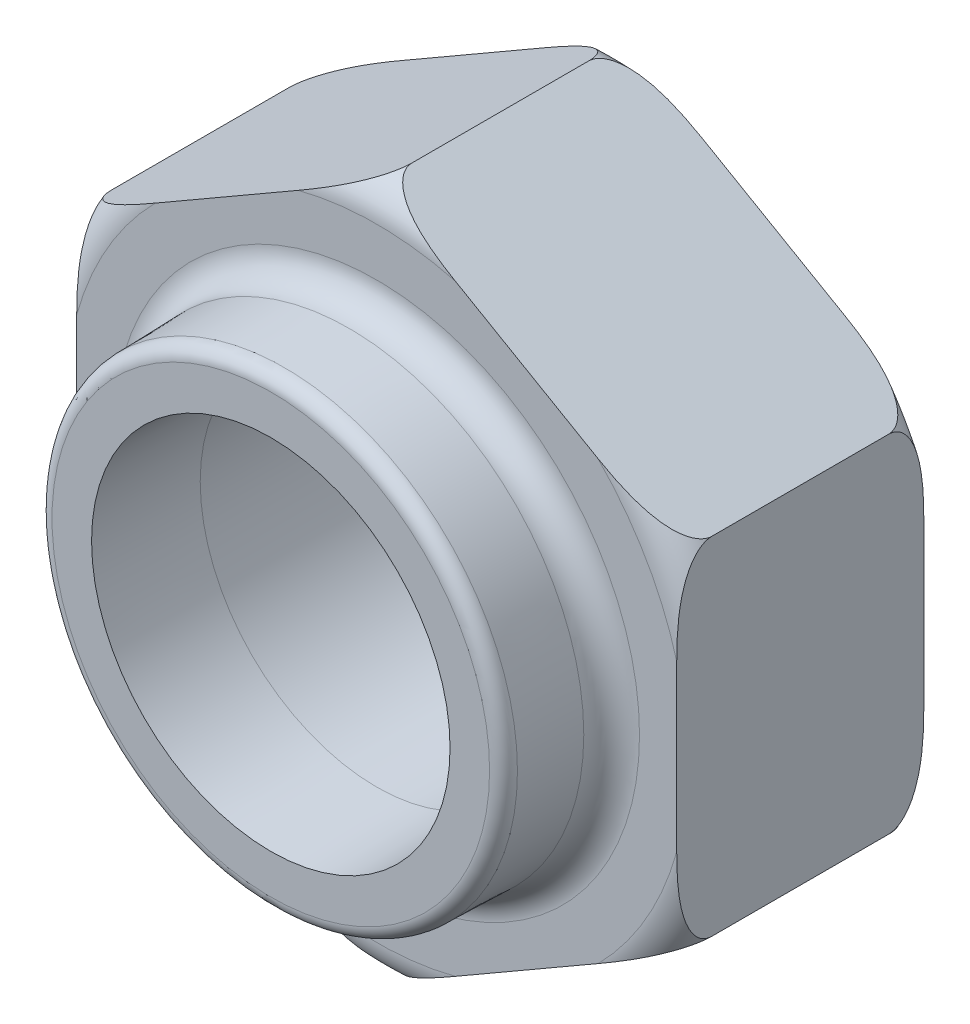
ISO-10303-21;
HEADER;
FILE_DESCRIPTION(('STEP AP214'),'2;1');
FILE_NAME('part.step','',(''),(''),'','','');
FILE_SCHEMA(('AUTOMOTIVE_DESIGN { 1 0 10303 214 1 1 1 1 }'));
ENDSEC;
DATA;
#1=APPLICATION_CONTEXT('core data for automotive mechanical design processes');
#2=APPLICATION_PROTOCOL_DEFINITION('international standard','automotive_design',2000,#1);
#3=PRODUCT_CONTEXT('',#1,'mechanical');
#4=PRODUCT('Part','Part','',(#3));
#5=PRODUCT_RELATED_PRODUCT_CATEGORY('part','',(#4));
#6=PRODUCT_DEFINITION_FORMATION('','',#4);
#7=PRODUCT_DEFINITION_CONTEXT('part definition',#1,'design');
#8=PRODUCT_DEFINITION('design','',#6,#7);
#9=PRODUCT_DEFINITION_SHAPE('','',#8);
#10=(LENGTH_UNIT() NAMED_UNIT(*) SI_UNIT(.MILLI.,.METRE.));
#11=(NAMED_UNIT(*) PLANE_ANGLE_UNIT() SI_UNIT($,.RADIAN.));
#12=(NAMED_UNIT(*) SI_UNIT($,.STERADIAN.) SOLID_ANGLE_UNIT());
#13=UNCERTAINTY_MEASURE_WITH_UNIT(LENGTH_MEASURE(1.E-05),#10,'distance_accuracy_value','');
#14=(GEOMETRIC_REPRESENTATION_CONTEXT(3) GLOBAL_UNCERTAINTY_ASSIGNED_CONTEXT((#13)) GLOBAL_UNIT_ASSIGNED_CONTEXT((#10,
#11,#12)) REPRESENTATION_CONTEXT('',''));
#15=CARTESIAN_POINT('',(0.,0.,0.));
#16=DIRECTION('',(0.,0.,1.));
#17=DIRECTION('',(1.,0.,0.));
#18=AXIS2_PLACEMENT_3D('',#15,#16,#17);
#19=CARTESIAN_POINT('',(-8.49999999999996,14.7224318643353,7.));
#20=DIRECTION('',(0.,0.,1.));
#21=DIRECTION('',(1.,0.,0.));
#22=AXIS2_PLACEMENT_3D('',#19,#20,#21);
#23=PLANE('',#22);
#24=CARTESIAN_POINT('',(0.,0.,7.));
#25=DIRECTION('',(0.,0.,1.));
#26=DIRECTION('',(1.,0.,0.));
#27=AXIS2_PLACEMENT_3D('',#24,#25,#26);
#28=CIRCLE('',#27,7.44599216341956);
#29=CARTESIAN_POINT('',(7.44599216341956,0.,7.));
#30=VERTEX_POINT('',#29);
#31=EDGE_CURVE('E244',#30,#30,#28,.F.);
#32=ORIENTED_EDGE('',*,*,#31,.T.);
#33=EDGE_LOOP('',(#32));
#34=FACE_BOUND('',#33,.T.);
#35=CARTESIAN_POINT('',(0.,0.,7.));
#36=DIRECTION('',(0.,0.,1.));
#37=DIRECTION('',(1.,0.,0.));
#38=AXIS2_PLACEMENT_3D('',#35,#36,#37);
#39=CIRCLE('',#38,8.8149545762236);
#40=CARTESIAN_POINT('',(8.50000000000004,-2.33525676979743,7.));
#41=VERTEX_POINT('',#40);
#42=CARTESIAN_POINT('',(6.27239168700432,-6.19358754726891,7.));
#43=VERTEX_POINT('',#42);
#44=EDGE_CURVE('E240',#41,#43,#39,.F.);
#45=ORIENTED_EDGE('',*,*,#44,.F.);
#46=DIRECTION('',(0.,-1.,0.));
#47=VECTOR('',#46,1.);
#48=CARTESIAN_POINT('',(8.50000000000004,4.90747728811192,7.));
#49=LINE('',#48,#47);
#50=CARTESIAN_POINT('',(8.50000000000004,2.33525676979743,7.));
#51=VERTEX_POINT('',#50);
#52=EDGE_CURVE('E201',#51,#41,#49,.T.);
#53=ORIENTED_EDGE('',*,*,#52,.F.);
#54=CARTESIAN_POINT('',(6.2723916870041,6.19358754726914,7.));
#55=VERTEX_POINT('',#54);
#56=EDGE_CURVE('E238',#55,#51,#39,.F.);
#57=ORIENTED_EDGE('',*,*,#56,.F.);
#58=DIRECTION('',(-0.866025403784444,0.49999999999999,0.));
#59=VECTOR('',#58,1.);
#60=CARTESIAN_POINT('',(8.50000000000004,4.90747728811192,7.));
#61=LINE('',#60,#59);
#62=CARTESIAN_POINT('',(2.22760831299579,8.5288443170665,7.));
#63=VERTEX_POINT('',#62);
#64=EDGE_CURVE('E188',#55,#63,#61,.T.);
#65=ORIENTED_EDGE('',*,*,#64,.T.);
#66=CARTESIAN_POINT('',(-2.22760831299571,8.52884431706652,7.));
#67=VERTEX_POINT('',#66);
#68=EDGE_CURVE('E186',#67,#63,#39,.F.);
#69=ORIENTED_EDGE('',*,*,#68,.F.);
#70=DIRECTION('',(0.866025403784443,0.499999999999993,0.));
#71=VECTOR('',#70,1.);
#72=CARTESIAN_POINT('',(-8.49999999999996,4.90747728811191,7.));
#73=LINE('',#72,#71);
#74=CARTESIAN_POINT('',(-6.27239168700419,6.19358754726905,7.));
#75=VERTEX_POINT('',#74);
#76=EDGE_CURVE('E179',#75,#67,#73,.T.);
#77=ORIENTED_EDGE('',*,*,#76,.F.);
#78=CARTESIAN_POINT('',(0.,0.,7.));
#79=DIRECTION('',(0.,0.,-1.));
#80=DIRECTION('',(-1.,0.,0.));
#81=AXIS2_PLACEMENT_3D('',#78,#79,#80);
#82=CIRCLE('',#81,8.8149545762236);
#83=CARTESIAN_POINT('',(-8.49999999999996,2.33525676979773,7.));
#84=VERTEX_POINT('',#83);
#85=EDGE_CURVE('E162',#84,#75,#82,.T.);
#86=ORIENTED_EDGE('',*,*,#85,.F.);
#87=DIRECTION('',(0.,-1.,0.));
#88=VECTOR('',#87,1.);
#89=CARTESIAN_POINT('',(-8.49999999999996,4.90747728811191,7.));
#90=LINE('',#89,#88);
#91=CARTESIAN_POINT('',(-8.49999999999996,-2.33525676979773,7.));
#92=VERTEX_POINT('',#91);
#93=EDGE_CURVE('E187',#84,#92,#90,.T.);
#94=ORIENTED_EDGE('',*,*,#93,.T.);
#95=CARTESIAN_POINT('',(-6.27239168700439,-6.19358754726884,7.));
#96=VERTEX_POINT('',#95);
#97=EDGE_CURVE('E422',#96,#92,#39,.F.);
#98=ORIENTED_EDGE('',*,*,#97,.F.);
#99=DIRECTION('',(0.866025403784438,-0.500000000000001,0.));
#100=VECTOR('',#99,1.);
#101=CARTESIAN_POINT('',(-8.49999999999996,-4.90747728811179,7.));
#102=LINE('',#101,#100);
#103=CARTESIAN_POINT('',(-2.22760831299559,-8.52884431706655,7.));
#104=VERTEX_POINT('',#103);
#105=EDGE_CURVE('E190',#96,#104,#102,.T.);
#106=ORIENTED_EDGE('',*,*,#105,.T.);
#107=CARTESIAN_POINT('',(2.22760831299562,-8.52884431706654,7.));
#108=VERTEX_POINT('',#107);
#109=EDGE_CURVE('E424',#108,#104,#39,.F.);
#110=ORIENTED_EDGE('',*,*,#109,.F.);
#111=DIRECTION('',(-0.86602540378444,-0.499999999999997,0.));
#112=VECTOR('',#111,1.);
#113=CARTESIAN_POINT('',(8.50000000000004,-4.90747728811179,7.));
#114=LINE('',#113,#112);
#115=EDGE_CURVE('E198',#43,#108,#114,.T.);
#116=ORIENTED_EDGE('',*,*,#115,.F.);
#117=EDGE_LOOP('',(#45,#53,#57,#65,#69,#77,#86,#94,#98,#106,#110,#116));
#118=FACE_BOUND('',#117,.T.);
#119=ADVANCED_FACE('F38',(#34,#118),#23,.T.);
#120=CARTESIAN_POINT('',(8.50000000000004,4.90747728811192,7.));
#121=DIRECTION('',(-0.499999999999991,-0.866025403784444,0.));
#122=DIRECTION('',(0.866025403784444,-0.499999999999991,0.));
#123=AXIS2_PLACEMENT_3D('',#120,#121,#122);
#124=PLANE('',#123);
#125=DIRECTION('',(0.,0.,-1.));
#126=VECTOR('',#125,1.);
#127=CARTESIAN_POINT('',(0.,9.81495457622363,7.));
#128=LINE('',#127,#126);
#129=CARTESIAN_POINT('',(0.,9.8149545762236,6.));
#130=VERTEX_POINT('',#129);
#131=CARTESIAN_POINT('',(0.,9.8149545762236,1.));
#132=VERTEX_POINT('',#131);
#133=EDGE_CURVE('E231',#130,#132,#128,.T.);
#134=ORIENTED_EDGE('',*,*,#133,.F.);
#135=CARTESIAN_POINT('',(3.46410685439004E-08,9.8149545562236,5.9998));
#136=CARTESIAN_POINT('',(-7.25925486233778E-05,9.81499648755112,6.02983184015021));
#137=CARTESIAN_POINT('',(0.00231871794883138,9.8136158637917,6.05978661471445));
#138=CARTESIAN_POINT('',(0.0114860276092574,9.80832311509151,6.11853396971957));
#139=CARTESIAN_POINT('',(0.0182241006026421,9.80443288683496,6.14733433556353));
#140=CARTESIAN_POINT('',(0.0355325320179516,9.79443985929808,6.20322523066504));
#141=CARTESIAN_POINT('',(0.046091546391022,9.78834360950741,6.23032054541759));
#142=CARTESIAN_POINT('',(0.0703643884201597,9.77432967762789,6.28259541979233));
#143=CARTESIAN_POINT('',(0.0840850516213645,9.76640804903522,6.30777066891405));
#144=CARTESIAN_POINT('',(0.124231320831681,9.74322958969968,6.37248998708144));
#145=CARTESIAN_POINT('',(0.152944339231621,9.72665212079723,6.41013878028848));
#146=CARTESIAN_POINT('',(0.215038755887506,9.69080189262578,6.47992109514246));
#147=CARTESIAN_POINT('',(0.248435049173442,9.67152053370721,6.51203626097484));
#148=CARTESIAN_POINT('',(0.313912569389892,9.63371706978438,6.56768230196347));
#149=CARTESIAN_POINT('',(0.345636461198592,9.61540127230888,6.59178440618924));
#150=CARTESIAN_POINT('',(0.410771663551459,9.57779544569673,6.6367619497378));
#151=CARTESIAN_POINT('',(0.4441842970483,9.558504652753,6.65763480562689));
#152=CARTESIAN_POINT('',(0.51220780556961,9.519231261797,6.69656271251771));
#153=CARTESIAN_POINT('',(0.546818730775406,9.49924863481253,6.71461764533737));
#154=CARTESIAN_POINT('',(0.616906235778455,9.45878359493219,6.74826693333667));
#155=CARTESIAN_POINT('',(0.652382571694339,9.43830132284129,6.76386197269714));
#156=CARTESIAN_POINT('',(0.735973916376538,9.39003983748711,6.79777071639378));
#157=CARTESIAN_POINT('',(0.784343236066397,9.36211379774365,6.81524619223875));
#158=CARTESIAN_POINT('',(0.88187612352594,9.30580315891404,6.84697110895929));
#159=CARTESIAN_POINT('',(0.931040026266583,9.27741836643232,6.86121914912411));
#160=CARTESIAN_POINT('',(1.07946834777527,9.19172323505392,6.8998914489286));
#161=CARTESIAN_POINT('',(1.17953834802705,9.13394779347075,6.92019414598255));
#162=CARTESIAN_POINT('',(1.38153431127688,9.01732536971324,6.95287436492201));
#163=CARTESIAN_POINT('',(1.4834688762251,8.95847342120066,6.96517509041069));
#164=CARTESIAN_POINT('',(1.63661063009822,8.87005698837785,6.97904917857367));
#165=CARTESIAN_POINT('',(1.68767455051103,8.84057522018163,6.98291032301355));
#166=CARTESIAN_POINT('',(1.78985752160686,8.78157985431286,6.98932525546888));
#167=CARTESIAN_POINT('',(1.84097656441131,8.752066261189,6.99187921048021));
#168=CARTESIAN_POINT('',(2.00310550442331,8.65846107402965,6.99822818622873));
#169=CARTESIAN_POINT('',(2.11417453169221,8.59433534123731,6.99997626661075));
#170=CARTESIAN_POINT('',(2.33631719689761,8.46608121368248,7.00002321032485));
#171=CARTESIAN_POINT('',(2.44739083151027,8.40195282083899,6.99832140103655));
#172=CARTESIAN_POINT('',(2.66958170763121,8.2736708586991,6.99292995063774));
#173=CARTESIAN_POINT('',(2.78069891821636,8.20951730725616,6.98923880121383));
#174=CARTESIAN_POINT('',(3.0029140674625,8.08122133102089,6.98113505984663));
#175=CARTESIAN_POINT('',(3.114012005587,8.0170789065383,6.97672245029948));
#176=CARTESIAN_POINT('',(3.33648057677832,7.88863661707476,6.96823704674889));
#177=CARTESIAN_POINT('',(3.44785123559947,7.82433673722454,6.96416507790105));
#178=CARTESIAN_POINT('',(3.67062273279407,7.69571955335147,6.95722102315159));
#179=CARTESIAN_POINT('',(3.78202357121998,7.63140224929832,6.95434893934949));
#180=CARTESIAN_POINT('',(4.00475706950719,7.50280700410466,6.95036455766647));
#181=CARTESIAN_POINT('',(4.11608970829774,7.43852907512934,6.94925078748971));
#182=CARTESIAN_POINT('',(4.33875588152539,7.30997270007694,6.94898923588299));
#183=CARTESIAN_POINT('',(4.45008941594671,7.24569425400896,6.94984143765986));
#184=CARTESIAN_POINT('',(4.67148228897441,7.11787301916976,6.95333067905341));
#185=CARTESIAN_POINT('',(4.78154188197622,7.05433008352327,6.95594754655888));
#186=CARTESIAN_POINT('',(5.00163428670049,6.92725967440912,6.962451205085));
#187=CARTESIAN_POINT('',(5.11166709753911,6.86373220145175,6.96633803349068));
#188=CARTESIAN_POINT('',(5.33187874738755,6.73659294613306,6.97460865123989));
#189=CARTESIAN_POINT('',(5.44205756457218,6.67298117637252,6.97899315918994));
#190=CARTESIAN_POINT('',(5.66242629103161,6.5457512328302,6.98724285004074));
#191=CARTESIAN_POINT('',(5.7726161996,6.48213305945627,6.99110805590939));
#192=CARTESIAN_POINT('',(5.99250526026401,6.35518005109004,6.99710140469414));
#193=CARTESIAN_POINT('',(6.10220422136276,6.29184532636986,6.9992378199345));
#194=CARTESIAN_POINT('',(6.32161217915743,6.16517008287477,7.00042929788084));
#195=CARTESIAN_POINT('',(6.43132117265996,6.10182956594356,6.99948476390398));
#196=CARTESIAN_POINT('',(6.65042750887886,5.97532846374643,6.99290556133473));
#197=CARTESIAN_POINT('',(6.75982503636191,5.91216777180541,6.98728026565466));
#198=CARTESIAN_POINT('',(6.97819972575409,5.78608908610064,6.96940231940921));
#199=CARTESIAN_POINT('',(7.0871771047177,5.72317096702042,6.95715374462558));
#200=CARTESIAN_POINT('',(7.23426394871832,5.63825033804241,6.93431126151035));
#201=CARTESIAN_POINT('',(7.27284509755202,5.61597550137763,6.92772565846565));
#202=CARTESIAN_POINT('',(7.34984088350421,5.57152196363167,6.91323277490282));
#203=CARTESIAN_POINT('',(7.38825543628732,5.54934331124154,6.9053248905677));
#204=CARTESIAN_POINT('',(7.46502226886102,5.50502195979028,6.887985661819));
#205=CARTESIAN_POINT('',(7.5033733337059,5.48287996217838,6.87854708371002));
#206=CARTESIAN_POINT('',(7.57973103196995,5.43879482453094,6.8579826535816));
#207=CARTESIAN_POINT('',(7.61773770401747,5.4168516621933,6.84685699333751));
#208=CARTESIAN_POINT('',(7.70822687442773,5.36460771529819,6.81792264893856));
#209=CARTESIAN_POINT('',(7.76049723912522,5.33442940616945,6.79921006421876));
#210=CARTESIAN_POINT('',(7.86375760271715,5.27481200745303,6.75730680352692));
#211=CARTESIAN_POINT('',(7.91474624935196,5.24537369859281,6.73411160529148));
#212=CARTESIAN_POINT('',(8.01428051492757,5.18790756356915,6.6824966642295));
#213=CARTESIAN_POINT('',(8.06284138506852,5.15987093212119,6.65411673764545));
#214=CARTESIAN_POINT('',(8.15663742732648,5.10571776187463,6.5908810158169));
#215=CARTESIAN_POINT('',(8.20188118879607,5.07959626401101,6.55604283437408));
#216=CARTESIAN_POINT('',(8.27104564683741,5.03966414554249,6.49301125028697));
#217=CARTESIAN_POINT('',(8.29660135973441,5.02490954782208,6.46722321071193));
#218=CARTESIAN_POINT('',(8.34483424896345,4.9970622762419,6.41217112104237));
#219=CARTESIAN_POINT('',(8.36750889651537,4.98397106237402,6.3829040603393));
#220=CARTESIAN_POINT('',(8.40908470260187,4.9599672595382,6.32030873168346));
#221=CARTESIAN_POINT('',(8.42793248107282,4.94908548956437,6.2869322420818));
#222=CARTESIAN_POINT('',(8.45986098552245,4.93065155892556,6.21674205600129));
#223=CARTESIAN_POINT('',(8.47296650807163,4.92308508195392,6.17994398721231));
#224=CARTESIAN_POINT('',(8.48816744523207,4.9143088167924,6.11893919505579));
#225=CARTESIAN_POINT('',(8.49256651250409,4.91176901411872,6.09548673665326));
#226=CARTESIAN_POINT('',(8.49850714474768,4.90833918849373,6.04797037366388));
#227=CARTESIAN_POINT('',(8.50003212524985,4.90745874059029,6.02390372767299));
#228=CARTESIAN_POINT('',(8.49999996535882,4.90747730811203,5.9998));
#229=B_SPLINE_CURVE_WITH_KNOTS('',3,(#135,#136,#137,#138,#139,#140,#141,#142,#143,#144,#145,
#146,#147,#148,#149,#150,#151,#152,#153,#154,#155,#156,#157,#158,#159,#160,#161,#162,#163,#164,
#165,#166,#167,#168,#169,#170,#171,#172,#173,#174,#175,#176,#177,#178,#179,#180,#181,#182,#183,
#184,#185,#186,#187,#188,#189,#190,#191,#192,#193,#194,#195,#196,#197,#198,#199,#200,#201,#202,
#203,#204,#205,#206,#207,#208,#209,#210,#211,#212,#213,#214,#215,#216,#217,#218,#219,#220,#221,
#222,#223,#224,#225,#226,#227,#228),.UNSPECIFIED.,.F.,.F.,(4,2,2,2,2,2,2,2,2,2,2,2,2,2,2,2,2,2,
2,2,2,2,2,2,2,2,2,2,2,2,2,2,2,2,2,2,2,2,2,2,2,2,2,2,2,2,4),(0.,0.0898435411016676,
0.178913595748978,0.267721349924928,0.356722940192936,0.506357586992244,0.656479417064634,
0.787838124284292,0.919301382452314,1.05077015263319,1.18220229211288,1.35764426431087,
1.53316223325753,1.88467373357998,2.23951084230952,2.41676798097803,2.59400246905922,
2.97870900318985,3.36349055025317,3.7485642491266,4.13364734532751,4.51963775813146,
4.90562884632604,5.29129655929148,5.67696097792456,6.05828991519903,6.43963007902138,
6.82152804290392,7.20340911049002,7.58345187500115,7.96344489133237,8.34267882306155,
8.72167964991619,8.85676542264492,8.99191305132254,9.12771903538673,9.26350959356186,
9.45293824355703,9.64255900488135,9.83078050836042,10.018496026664,10.1358371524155,
10.2532805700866,10.3722640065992,10.4907284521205,10.5624971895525,10.6346788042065),.UNSPECIFIED.);
#230=EDGE_CURVE('E426',#130,#63,#229,.T.);
#231=ORIENTED_EDGE('',*,*,#230,.T.);
#232=ORIENTED_EDGE('',*,*,#64,.F.);
#233=CARTESIAN_POINT('',(8.50000000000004,4.90747728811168,6.));
#234=VERTEX_POINT('',#233);
#235=EDGE_CURVE('E320',#55,#234,#229,.T.);
#236=ORIENTED_EDGE('',*,*,#235,.T.);
#237=DIRECTION('',(0.,0.,-1.));
#238=VECTOR('',#237,1.);
#239=CARTESIAN_POINT('',(8.50000000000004,4.90747728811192,7.));
#240=LINE('',#239,#238);
#241=CARTESIAN_POINT('',(8.50000000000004,4.90747728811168,1.));
#242=VERTEX_POINT('',#241);
#243=EDGE_CURVE('E204',#234,#242,#240,.T.);
#244=ORIENTED_EDGE('',*,*,#243,.T.);
#245=CARTESIAN_POINT('',(8.49999996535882,4.90747730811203,1.0002));
#246=CARTESIAN_POINT('',(8.50007259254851,4.90743537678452,0.970168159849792));
#247=CARTESIAN_POINT('',(8.49768128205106,4.90881600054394,0.940213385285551));
#248=CARTESIAN_POINT('',(8.48851397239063,4.91410874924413,0.881466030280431));
#249=CARTESIAN_POINT('',(8.48177589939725,4.91799897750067,0.852665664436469));
#250=CARTESIAN_POINT('',(8.46446746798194,4.92799200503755,0.796774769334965));
#251=CARTESIAN_POINT('',(8.45390845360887,4.93408825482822,0.769679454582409));
#252=CARTESIAN_POINT('',(8.42963561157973,4.94810218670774,0.71740458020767));
#253=CARTESIAN_POINT('',(8.41591494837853,4.95602381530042,0.69222933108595));
#254=CARTESIAN_POINT('',(8.37576867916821,4.97920227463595,0.627510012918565));
#255=CARTESIAN_POINT('',(8.34705566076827,4.99577974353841,0.589861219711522));
#256=CARTESIAN_POINT('',(8.28496124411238,5.03162997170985,0.520078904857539));
#257=CARTESIAN_POINT('',(8.25156495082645,5.05091133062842,0.487963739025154));
#258=CARTESIAN_POINT('',(8.18608743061,5.08871479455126,0.432317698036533));
#259=CARTESIAN_POINT('',(8.1543635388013,5.10703059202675,0.408215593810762));
#260=CARTESIAN_POINT('',(8.08922833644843,5.1446364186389,0.363238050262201));
#261=CARTESIAN_POINT('',(8.05581570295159,5.16392721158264,0.342365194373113));
#262=CARTESIAN_POINT('',(7.98779219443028,5.20320060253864,0.303437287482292));
#263=CARTESIAN_POINT('',(7.95318126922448,5.22318322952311,0.285382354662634));
#264=CARTESIAN_POINT('',(7.88309376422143,5.26364826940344,0.251733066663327));
#265=CARTESIAN_POINT('',(7.84761742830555,5.28413054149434,0.236138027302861));
#266=CARTESIAN_POINT('',(7.76402608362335,5.33239202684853,0.202229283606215));
#267=CARTESIAN_POINT('',(7.71565676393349,5.36031806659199,0.184753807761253));
#268=CARTESIAN_POINT('',(7.61812387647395,5.41662870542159,0.153028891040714));
#269=CARTESIAN_POINT('',(7.56895997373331,5.44501349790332,0.138780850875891));
#270=CARTESIAN_POINT('',(7.42053165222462,5.53070862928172,0.1001085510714));
#271=CARTESIAN_POINT('',(7.32046165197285,5.58848407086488,0.079805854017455));
#272=CARTESIAN_POINT('',(7.11846568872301,5.70510649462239,0.0471256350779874));
#273=CARTESIAN_POINT('',(7.01653112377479,5.76395844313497,0.034824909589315));
#274=CARTESIAN_POINT('',(6.86338936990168,5.85237487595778,0.0209508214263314));
#275=CARTESIAN_POINT('',(6.81232544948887,5.881856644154,0.0170896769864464));
#276=CARTESIAN_POINT('',(6.71014247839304,5.94085201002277,0.0106747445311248));
#277=CARTESIAN_POINT('',(6.65902343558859,5.97036560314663,0.00812078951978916));
#278=CARTESIAN_POINT('',(6.4968944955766,6.06397079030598,0.00177181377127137));
#279=CARTESIAN_POINT('',(6.38582546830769,6.12809652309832,2.37333892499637E-05));
#280=CARTESIAN_POINT('',(6.16368280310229,6.25635065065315,-2.32103248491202E-05));
#281=CARTESIAN_POINT('',(6.05260916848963,6.32047904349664,0.00167859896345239));
#282=CARTESIAN_POINT('',(5.8304182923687,6.44876100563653,0.00707004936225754));
#283=CARTESIAN_POINT('',(5.71930108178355,6.51291455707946,0.0107611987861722));
#284=CARTESIAN_POINT('',(5.49708593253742,6.64121053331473,0.0188649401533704));
#285=CARTESIAN_POINT('',(5.38598799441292,6.70535295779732,0.0232775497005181));
#286=CARTESIAN_POINT('',(5.1635194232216,6.83379524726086,0.0317629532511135));
#287=CARTESIAN_POINT('',(5.05214876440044,6.89809512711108,0.0358349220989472));
#288=CARTESIAN_POINT('',(4.82937726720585,7.02671231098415,0.0427789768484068));
#289=CARTESIAN_POINT('',(4.71797642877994,7.09102961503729,0.045651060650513));
#290=CARTESIAN_POINT('',(4.49524293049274,7.21962486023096,0.0496354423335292));
#291=CARTESIAN_POINT('',(4.38391029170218,7.28390278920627,0.0507492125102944));
#292=CARTESIAN_POINT('',(4.16124411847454,7.41245916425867,0.0510107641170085));
#293=CARTESIAN_POINT('',(4.04991058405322,7.47673761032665,0.0501585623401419));
#294=CARTESIAN_POINT('',(3.82851771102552,7.60455884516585,0.0466693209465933));
#295=CARTESIAN_POINT('',(3.71845811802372,7.66810178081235,0.0440524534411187));
#296=CARTESIAN_POINT('',(3.49836571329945,7.79517218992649,0.0375487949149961));
#297=CARTESIAN_POINT('',(3.38833290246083,7.85869966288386,0.0336619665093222));
#298=CARTESIAN_POINT('',(3.16812125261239,7.98583891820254,0.0253913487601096));
#299=CARTESIAN_POINT('',(3.05794243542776,8.04945068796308,0.0210068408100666));
#300=CARTESIAN_POINT('',(2.83757370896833,8.1766806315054,0.0127571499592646));
#301=CARTESIAN_POINT('',(2.72738380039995,8.24029880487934,0.0088919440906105));
#302=CARTESIAN_POINT('',(2.50749473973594,8.36725181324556,0.00289859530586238));
#303=CARTESIAN_POINT('',(2.39779577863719,8.43058653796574,0.000762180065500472));
#304=CARTESIAN_POINT('',(2.17838782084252,8.55726178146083,-0.000429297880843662));
#305=CARTESIAN_POINT('',(2.06867882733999,8.62060229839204,0.000515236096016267));
#306=CARTESIAN_POINT('',(1.8495724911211,8.74710340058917,0.00709443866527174));
#307=CARTESIAN_POINT('',(1.74017496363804,8.81026409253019,0.0127197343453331));
#308=CARTESIAN_POINT('',(1.52180027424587,8.93634277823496,0.0305976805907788));
#309=CARTESIAN_POINT('',(1.41282289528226,8.99926089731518,0.0428462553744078));
#310=CARTESIAN_POINT('',(1.26573605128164,9.08418152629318,0.0656887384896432));
#311=CARTESIAN_POINT('',(1.22715490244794,9.10645636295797,0.0722743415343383));
#312=CARTESIAN_POINT('',(1.15015911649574,9.15090990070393,0.0867672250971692));
#313=CARTESIAN_POINT('',(1.11174456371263,9.17308855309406,0.0946751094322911));
#314=CARTESIAN_POINT('',(1.03497773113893,9.21740990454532,0.112014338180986));
#315=CARTESIAN_POINT('',(0.996626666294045,9.23955190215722,0.12145291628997));
#316=CARTESIAN_POINT('',(0.920268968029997,9.28363703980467,0.142017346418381));
#317=CARTESIAN_POINT('',(0.882262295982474,9.30558020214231,0.15314300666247));
#318=CARTESIAN_POINT('',(0.791773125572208,9.35782414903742,0.182077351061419));
#319=CARTESIAN_POINT('',(0.73950276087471,9.38800245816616,0.200789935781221));
#320=CARTESIAN_POINT('',(0.636242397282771,9.44761985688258,0.242693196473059));
#321=CARTESIAN_POINT('',(0.585253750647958,9.47705816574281,0.265888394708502));
#322=CARTESIAN_POINT('',(0.485719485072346,9.53452430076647,0.317503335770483));
#323=CARTESIAN_POINT('',(0.437158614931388,9.56256093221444,0.345883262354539));
#324=CARTESIAN_POINT('',(0.343362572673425,9.61671410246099,0.409118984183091));
#325=CARTESIAN_POINT('',(0.298118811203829,9.64283560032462,0.443957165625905));
#326=CARTESIAN_POINT('',(0.228954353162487,9.68276771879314,0.506988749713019));
#327=CARTESIAN_POINT('',(0.203398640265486,9.69752231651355,0.532776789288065));
#328=CARTESIAN_POINT('',(0.15516575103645,9.72536958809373,0.587828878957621));
#329=CARTESIAN_POINT('',(0.132491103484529,9.73846080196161,0.617095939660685));
#330=CARTESIAN_POINT('',(0.0909152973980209,9.76246460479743,0.67969126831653));
#331=CARTESIAN_POINT('',(0.0720675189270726,9.77334637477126,0.713067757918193));
#332=CARTESIAN_POINT('',(0.0401390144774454,9.79178030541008,0.783257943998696));
#333=CARTESIAN_POINT('',(0.0270334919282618,9.79934678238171,0.820056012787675));
#334=CARTESIAN_POINT('',(0.0118325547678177,9.80812304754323,0.881060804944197));
#335=CARTESIAN_POINT('',(0.00743348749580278,9.81066285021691,0.904513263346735));
#336=CARTESIAN_POINT('',(0.00149285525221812,9.81409267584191,0.952029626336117));
#337=CARTESIAN_POINT('',(-3.21252499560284E-05,9.81497312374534,0.976096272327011));
#338=CARTESIAN_POINT('',(3.46410678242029E-08,9.8149545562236,1.0002));
#339=B_SPLINE_CURVE_WITH_KNOTS('',3,(#245,#246,#247,#248,#249,#250,#251,#252,#253,#254,#255,
#256,#257,#258,#259,#260,#261,#262,#263,#264,#265,#266,#267,#268,#269,#270,#271,#272,#273,#274,
#275,#276,#277,#278,#279,#280,#281,#282,#283,#284,#285,#286,#287,#288,#289,#290,#291,#292,#293,
#294,#295,#296,#297,#298,#299,#300,#301,#302,#303,#304,#305,#306,#307,#308,#309,#310,#311,#312,
#313,#314,#315,#316,#317,#318,#319,#320,#321,#322,#323,#324,#325,#326,#327,#328,#329,#330,#331,
#332,#333,#334,#335,#336,#337,#338),.UNSPECIFIED.,.F.,.F.,(4,2,2,2,2,2,2,2,2,2,2,2,2,2,2,2,2,2,
2,2,2,2,2,2,2,2,2,2,2,2,2,2,2,2,2,2,2,2,2,2,2,2,2,2,2,2,4),(0.,0.0898435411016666,
0.178913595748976,0.267721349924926,0.356722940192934,0.506357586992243,0.656479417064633,
0.787838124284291,0.919301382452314,1.05077015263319,1.18220229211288,1.35764426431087,
1.53316223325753,1.88467373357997,2.23951084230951,2.41676798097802,2.59400246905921,
2.97870900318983,3.36349055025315,3.74856424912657,4.13364734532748,4.51963775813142,
4.905628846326,5.29129655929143,5.67696097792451,6.05828991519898,6.43963007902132,
6.82152804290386,7.20340911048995,7.58345187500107,7.96344489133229,8.34267882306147,
8.72167964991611,8.85676542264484,8.99191305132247,9.12771903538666,9.2635095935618,
9.45293824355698,9.64255900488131,9.8307805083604,10.018496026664,10.1358371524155,
10.2532805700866,10.3722640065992,10.4907284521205,10.5624971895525,10.6346788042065),.UNSPECIFIED.);
#340=CARTESIAN_POINT('',(6.2723916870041,6.19358754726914,0.));
#341=VERTEX_POINT('',#340);
#342=EDGE_CURVE('E391',#242,#341,#339,.T.);
#343=ORIENTED_EDGE('',*,*,#342,.T.);
#344=DIRECTION('',(-0.866025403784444,0.49999999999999,0.));
#345=VECTOR('',#344,1.);
#346=CARTESIAN_POINT('',(8.50000000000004,4.90747728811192,0.));
#347=LINE('',#346,#345);
#348=CARTESIAN_POINT('',(2.22760831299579,8.5288443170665,0.));
#349=VERTEX_POINT('',#348);
#350=EDGE_CURVE('E205',#341,#349,#347,.T.);
#351=ORIENTED_EDGE('',*,*,#350,.T.);
#352=EDGE_CURVE('E209',#349,#132,#339,.T.);
#353=ORIENTED_EDGE('',*,*,#352,.T.);
#354=EDGE_LOOP('',(#134,#231,#232,#236,#244,#343,#351,#353));
#355=FACE_BOUND('',#354,.T.);
#356=ADVANCED_FACE('F262',(#355),#124,.F.);
#357=CARTESIAN_POINT('',(-8.49999999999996,4.90747728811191,7.));
#358=DIRECTION('',(-0.499999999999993,0.866025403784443,0.));
#359=DIRECTION('',(-0.866025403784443,-0.499999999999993,0.));
#360=AXIS2_PLACEMENT_3D('',#357,#358,#359);
#361=PLANE('',#360);
#362=CARTESIAN_POINT('',(-3.46410385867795E-08,9.8149545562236,5.9998));
#363=CARTESIAN_POINT('',(7.25925486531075E-05,9.81499648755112,6.02983184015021));
#364=CARTESIAN_POINT('',(-0.00231871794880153,9.8136158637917,6.05978661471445));
#365=CARTESIAN_POINT('',(-0.0114860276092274,9.80832311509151,6.11853396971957));
#366=CARTESIAN_POINT('',(-0.0182241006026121,9.80443288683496,6.14733433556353));
#367=CARTESIAN_POINT('',(-0.0355325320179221,9.79443985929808,6.20322523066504));
#368=CARTESIAN_POINT('',(-0.0460915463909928,9.78834360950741,6.23032054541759));
#369=CARTESIAN_POINT('',(-0.0703643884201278,9.77432967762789,6.28259541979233));
#370=CARTESIAN_POINT('',(-0.0840850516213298,9.76640804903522,6.30777066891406));
#371=CARTESIAN_POINT('',(-0.124231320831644,9.74322958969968,6.37248998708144));
#372=CARTESIAN_POINT('',(-0.152944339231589,9.72665212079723,6.41013878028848));
#373=CARTESIAN_POINT('',(-0.215038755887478,9.69080189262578,6.47992109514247));
#374=CARTESIAN_POINT('',(-0.248435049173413,9.67152053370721,6.51203626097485));
#375=CARTESIAN_POINT('',(-0.313912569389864,9.63371706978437,6.56768230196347));
#376=CARTESIAN_POINT('',(-0.345636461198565,9.61540127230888,6.59178440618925));
#377=CARTESIAN_POINT('',(-0.410771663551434,9.57779544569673,6.63676194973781));
#378=CARTESIAN_POINT('',(-0.444184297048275,9.55850465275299,6.65763480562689));
#379=CARTESIAN_POINT('',(-0.512207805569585,9.51923126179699,6.69656271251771));
#380=CARTESIAN_POINT('',(-0.546818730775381,9.49924863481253,6.71461764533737));
#381=CARTESIAN_POINT('',(-0.61690623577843,9.45878359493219,6.74826693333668));
#382=CARTESIAN_POINT('',(-0.652382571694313,9.43830132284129,6.76386197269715));
#383=CARTESIAN_POINT('',(-0.735973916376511,9.3900398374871,6.79777071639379));
#384=CARTESIAN_POINT('',(-0.784343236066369,9.36211379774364,6.81524619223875));
#385=CARTESIAN_POINT('',(-0.881876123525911,9.30580315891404,6.84697110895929));
#386=CARTESIAN_POINT('',(-0.931040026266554,9.27741836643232,6.86121914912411));
#387=CARTESIAN_POINT('',(-1.07946834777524,9.19172323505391,6.8998914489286));
#388=CARTESIAN_POINT('',(-1.17953834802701,9.13394779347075,6.92019414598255));
#389=CARTESIAN_POINT('',(-1.38153431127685,9.01732536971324,6.95287436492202));
#390=CARTESIAN_POINT('',(-1.48346887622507,8.95847342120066,6.96517509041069));
#391=CARTESIAN_POINT('',(-1.63661063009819,8.87005698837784,6.97904917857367));
#392=CARTESIAN_POINT('',(-1.687674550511,8.84057522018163,6.98291032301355));
#393=CARTESIAN_POINT('',(-1.78985752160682,8.78157985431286,6.98932525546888));
#394=CARTESIAN_POINT('',(-1.84097656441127,8.752066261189,6.99187921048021));
#395=CARTESIAN_POINT('',(-2.00310550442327,8.65846107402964,6.99822818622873));
#396=CARTESIAN_POINT('',(-2.11417453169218,8.59433534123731,6.99997626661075));
#397=CARTESIAN_POINT('',(-2.33631719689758,8.46608121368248,7.00002321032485));
#398=CARTESIAN_POINT('',(-2.44739083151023,8.40195282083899,6.99832140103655));
#399=CARTESIAN_POINT('',(-2.66958170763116,8.27367085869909,6.99292995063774));
#400=CARTESIAN_POINT('',(-2.78069891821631,8.20951730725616,6.98923880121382));
#401=CARTESIAN_POINT('',(-3.00291406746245,8.08122133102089,6.98113505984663));
#402=CARTESIAN_POINT('',(-3.11401200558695,8.0170789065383,6.97672245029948));
#403=CARTESIAN_POINT('',(-3.33648057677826,7.88863661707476,6.96823704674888));
#404=CARTESIAN_POINT('',(-3.44785123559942,7.82433673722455,6.96416507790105));
#405=CARTESIAN_POINT('',(-3.67062273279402,7.69571955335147,6.95722102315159));
#406=CARTESIAN_POINT('',(-3.78202357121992,7.63140224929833,6.95434893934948));
#407=CARTESIAN_POINT('',(-4.00475706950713,7.50280700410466,6.95036455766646));
#408=CARTESIAN_POINT('',(-4.11608970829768,7.43852907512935,6.9492507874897));
#409=CARTESIAN_POINT('',(-4.33875588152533,7.30997270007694,6.94898923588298));
#410=CARTESIAN_POINT('',(-4.45008941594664,7.24569425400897,6.94984143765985));
#411=CARTESIAN_POINT('',(-4.67148228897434,7.11787301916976,6.9533306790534));
#412=CARTESIAN_POINT('',(-4.78154188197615,7.05433008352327,6.95594754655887));
#413=CARTESIAN_POINT('',(-5.00163428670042,6.92725967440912,6.96245120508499));
#414=CARTESIAN_POINT('',(-5.11166709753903,6.86373220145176,6.96633803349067));
#415=CARTESIAN_POINT('',(-5.33187874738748,6.73659294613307,6.97460865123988));
#416=CARTESIAN_POINT('',(-5.4420575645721,6.67298117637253,6.97899315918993));
#417=CARTESIAN_POINT('',(-5.66242629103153,6.54575123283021,6.98724285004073));
#418=CARTESIAN_POINT('',(-5.77261619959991,6.48213305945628,6.99110805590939));
#419=CARTESIAN_POINT('',(-5.99250526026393,6.35518005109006,6.99710140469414));
#420=CARTESIAN_POINT('',(-6.10220422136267,6.29184532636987,6.9992378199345));
#421=CARTESIAN_POINT('',(-6.32161217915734,6.16517008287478,7.00042929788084));
#422=CARTESIAN_POINT('',(-6.43132117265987,6.10182956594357,6.99948476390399));
#423=CARTESIAN_POINT('',(-6.65042750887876,5.97532846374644,6.99290556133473));
#424=CARTESIAN_POINT('',(-6.75982503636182,5.91216777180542,6.98728026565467));
#425=CARTESIAN_POINT('',(-6.97819972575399,5.78608908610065,6.96940231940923));
#426=CARTESIAN_POINT('',(-7.08717710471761,5.72317096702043,6.9571537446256));
#427=CARTESIAN_POINT('',(-7.23426394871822,5.63825033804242,6.93431126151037));
#428=CARTESIAN_POINT('',(-7.27284509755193,5.61597550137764,6.92772565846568));
#429=CARTESIAN_POINT('',(-7.34984088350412,5.57152196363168,6.91323277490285));
#430=CARTESIAN_POINT('',(-7.38825543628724,5.54934331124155,6.90532489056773));
#431=CARTESIAN_POINT('',(-7.46502226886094,5.50502195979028,6.88798566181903));
#432=CARTESIAN_POINT('',(-7.50337333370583,5.48287996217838,6.87854708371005));
#433=CARTESIAN_POINT('',(-7.57973103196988,5.43879482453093,6.85798265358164));
#434=CARTESIAN_POINT('',(-7.6177377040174,5.41685166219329,6.84685699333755));
#435=CARTESIAN_POINT('',(-7.70822687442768,5.36460771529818,6.8179226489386));
#436=CARTESIAN_POINT('',(-7.76049723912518,5.33442940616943,6.7992100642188));
#437=CARTESIAN_POINT('',(-7.86375760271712,5.27481200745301,6.75730680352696));
#438=CARTESIAN_POINT('',(-7.91474624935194,5.24537369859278,6.73411160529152));
#439=CARTESIAN_POINT('',(-8.01428051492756,5.18790756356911,6.68249666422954));
#440=CARTESIAN_POINT('',(-8.06284138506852,5.15987093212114,6.65411673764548));
#441=CARTESIAN_POINT('',(-8.15663742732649,5.10571776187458,6.59088101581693));
#442=CARTESIAN_POINT('',(-8.20188118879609,5.07959626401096,6.55604283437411));
#443=CARTESIAN_POINT('',(-8.27104564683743,5.03966414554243,6.49301125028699));
#444=CARTESIAN_POINT('',(-8.29660135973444,5.02490954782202,6.46722321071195));
#445=CARTESIAN_POINT('',(-8.34483424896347,4.99706227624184,6.41217112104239));
#446=CARTESIAN_POINT('',(-8.36750889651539,4.98397106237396,6.38290406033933));
#447=CARTESIAN_POINT('',(-8.4090847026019,4.95996725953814,6.32030873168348));
#448=CARTESIAN_POINT('',(-8.42793248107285,4.94908548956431,6.28693224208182));
#449=CARTESIAN_POINT('',(-8.45986098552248,4.93065155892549,6.21674205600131));
#450=CARTESIAN_POINT('',(-8.47296650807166,4.92308508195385,6.17994398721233));
#451=CARTESIAN_POINT('',(-8.48816744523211,4.91430881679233,6.11893919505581));
#452=CARTESIAN_POINT('',(-8.49256651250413,4.91176901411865,6.09548673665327));
#453=CARTESIAN_POINT('',(-8.49850714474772,4.90833918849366,6.04797037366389));
#454=CARTESIAN_POINT('',(-8.50003212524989,4.90745874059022,6.02390372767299));
#455=CARTESIAN_POINT('',(-8.49999996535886,4.90747730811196,5.9998));
#456=B_SPLINE_CURVE_WITH_KNOTS('',3,(#362,#363,#364,#365,#366,#367,#368,#369,#370,#371,#372,
#373,#374,#375,#376,#377,#378,#379,#380,#381,#382,#383,#384,#385,#386,#387,#388,#389,#390,#391,
#392,#393,#394,#395,#396,#397,#398,#399,#400,#401,#402,#403,#404,#405,#406,#407,#408,#409,#410,
#411,#412,#413,#414,#415,#416,#417,#418,#419,#420,#421,#422,#423,#424,#425,#426,#427,#428,#429,
#430,#431,#432,#433,#434,#435,#436,#437,#438,#439,#440,#441,#442,#443,#444,#445,#446,#447,#448,
#449,#450,#451,#452,#453,#454,#455),.UNSPECIFIED.,.F.,.F.,(4,2,2,2,2,2,2,2,2,2,2,2,2,2,2,2,2,2,
2,2,2,2,2,2,2,2,2,2,2,2,2,2,2,2,2,2,2,2,2,2,2,2,2,2,2,2,4),(0.,0.0898435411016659,
0.178913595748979,0.267721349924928,0.356722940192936,0.506357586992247,0.656479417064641,
0.7878381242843,0.919301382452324,1.0507701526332,1.18220229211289,1.35764426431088,
1.53316223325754,1.88467373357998,2.23951084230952,2.41676798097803,2.59400246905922,
2.97870900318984,3.36349055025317,3.74856424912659,4.13364734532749,4.51963775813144,
4.90562884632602,5.29129655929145,5.67696097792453,6.05828991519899,6.43963007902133,
6.82152804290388,7.20340911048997,7.58345187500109,7.96344489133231,8.34267882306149,
8.72167964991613,8.85676542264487,8.9919130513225,9.1277190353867,9.26350959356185,
9.45293824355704,9.64255900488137,9.83078050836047,10.0184960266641,10.1358371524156,
10.2532805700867,10.3722640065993,10.4907284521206,10.5624971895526,10.6346788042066),.UNSPECIFIED.);
#457=EDGE_CURVE('E182',#130,#67,#456,.T.);
#458=ORIENTED_EDGE('',*,*,#457,.F.);
#459=ORIENTED_EDGE('',*,*,#133,.T.);
#460=CARTESIAN_POINT('',(-8.49999996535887,4.90747730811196,1.0002));
#461=CARTESIAN_POINT('',(-8.50007259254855,4.90743537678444,0.970168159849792));
#462=CARTESIAN_POINT('',(-8.4976812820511,4.90881600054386,0.940213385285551));
#463=CARTESIAN_POINT('',(-8.48851397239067,4.91410874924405,0.88146603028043));
#464=CARTESIAN_POINT('',(-8.48177589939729,4.9179989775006,0.852665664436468));
#465=CARTESIAN_POINT('',(-8.46446746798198,4.92799200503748,0.796774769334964));
#466=CARTESIAN_POINT('',(-8.45390845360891,4.93408825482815,0.769679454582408));
#467=CARTESIAN_POINT('',(-8.42963561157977,4.94810218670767,0.717404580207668));
#468=CARTESIAN_POINT('',(-8.41591494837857,4.95602381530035,0.692229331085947));
#469=CARTESIAN_POINT('',(-8.37576867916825,4.97920227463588,0.62751001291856));
#470=CARTESIAN_POINT('',(-8.34705566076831,4.99577974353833,0.589861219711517));
#471=CARTESIAN_POINT('',(-8.28496124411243,5.03162997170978,0.520078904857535));
#472=CARTESIAN_POINT('',(-8.25156495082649,5.05091133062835,0.487963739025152));
#473=CARTESIAN_POINT('',(-8.18608743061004,5.08871479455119,0.432317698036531));
#474=CARTESIAN_POINT('',(-8.15436353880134,5.10703059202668,0.408215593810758));
#475=CARTESIAN_POINT('',(-8.08922833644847,5.14463641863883,0.363238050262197));
#476=CARTESIAN_POINT('',(-8.05581570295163,5.16392721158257,0.342365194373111));
#477=CARTESIAN_POINT('',(-7.98779219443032,5.20320060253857,0.303437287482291));
#478=CARTESIAN_POINT('',(-7.95318126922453,5.22318322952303,0.285382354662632));
#479=CARTESIAN_POINT('',(-7.88309376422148,5.26364826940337,0.251733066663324));
#480=CARTESIAN_POINT('',(-7.8476174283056,5.28413054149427,0.236138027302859));
#481=CARTESIAN_POINT('',(-7.7640260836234,5.33239202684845,0.202229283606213));
#482=CARTESIAN_POINT('',(-7.71565676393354,5.36031806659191,0.184753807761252));
#483=CARTESIAN_POINT('',(-7.618123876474,5.41662870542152,0.153028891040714));
#484=CARTESIAN_POINT('',(-7.56895997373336,5.44501349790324,0.13878085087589));
#485=CARTESIAN_POINT('',(-7.42053165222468,5.53070862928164,0.100108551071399));
#486=CARTESIAN_POINT('',(-7.32046165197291,5.58848407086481,0.0798058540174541));
#487=CARTESIAN_POINT('',(-7.11846568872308,5.70510649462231,0.0471256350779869));
#488=CARTESIAN_POINT('',(-7.01653112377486,5.76395844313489,0.0348249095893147));
#489=CARTESIAN_POINT('',(-6.86338936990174,5.8523748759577,0.0209508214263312));
#490=CARTESIAN_POINT('',(-6.81232544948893,5.88185664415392,0.017089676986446));
#491=CARTESIAN_POINT('',(-6.71014247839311,5.94085201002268,0.0106747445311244));
#492=CARTESIAN_POINT('',(-6.65902343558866,5.97036560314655,0.00812078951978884));
#493=CARTESIAN_POINT('',(-6.49689449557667,6.0639707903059,0.00177181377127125));
#494=CARTESIAN_POINT('',(-6.38582546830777,6.12809652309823,2.37333892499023E-05));
#495=CARTESIAN_POINT('',(-6.16368280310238,6.25635065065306,-2.32103248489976E-05));
#496=CARTESIAN_POINT('',(-6.05260916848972,6.32047904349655,0.00167859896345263));
#497=CARTESIAN_POINT('',(-5.8304182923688,6.44876100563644,0.00707004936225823));
#498=CARTESIAN_POINT('',(-5.71930108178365,6.51291455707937,0.0107611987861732));
#499=CARTESIAN_POINT('',(-5.49708593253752,6.64121053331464,0.0188649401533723));
#500=CARTESIAN_POINT('',(-5.38598799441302,6.70535295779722,0.0232775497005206));
#501=CARTESIAN_POINT('',(-5.16351942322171,6.83379524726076,0.0317629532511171));
#502=CARTESIAN_POINT('',(-5.05214876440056,6.89809512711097,0.0358349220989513));
#503=CARTESIAN_POINT('',(-4.82937726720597,7.02671231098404,0.0427789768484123));
#504=CARTESIAN_POINT('',(-4.71797642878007,7.09102961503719,0.0456510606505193));
#505=CARTESIAN_POINT('',(-4.49524293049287,7.21962486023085,0.049635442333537));
#506=CARTESIAN_POINT('',(-4.38391029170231,7.28390278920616,0.0507492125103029));
#507=CARTESIAN_POINT('',(-4.16124411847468,7.41245916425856,0.0510107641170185));
#508=CARTESIAN_POINT('',(-4.04991058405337,7.47673761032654,0.0501585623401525));
#509=CARTESIAN_POINT('',(-3.82851771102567,7.60455884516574,0.0466693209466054));
#510=CARTESIAN_POINT('',(-3.71845811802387,7.66810178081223,0.0440524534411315));
#511=CARTESIAN_POINT('',(-3.4983657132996,7.79517218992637,0.0375487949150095));
#512=CARTESIAN_POINT('',(-3.38833290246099,7.85869966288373,0.0336619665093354));
#513=CARTESIAN_POINT('',(-3.16812125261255,7.98583891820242,0.025391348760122));
#514=CARTESIAN_POINT('',(-3.05794243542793,8.04945068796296,0.0210068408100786));
#515=CARTESIAN_POINT('',(-2.83757370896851,8.17668063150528,0.012757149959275));
#516=CARTESIAN_POINT('',(-2.72738380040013,8.24029880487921,0.00889194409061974));
#517=CARTESIAN_POINT('',(-2.50749473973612,8.36725181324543,0.00289859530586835));
#518=CARTESIAN_POINT('',(-2.39779577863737,8.43058653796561,0.000762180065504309));
#519=CARTESIAN_POINT('',(-2.17838782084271,8.5572617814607,-0.000429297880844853));
#520=CARTESIAN_POINT('',(-2.06867882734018,8.6206022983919,0.000515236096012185));
#521=CARTESIAN_POINT('',(-1.8495724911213,8.74710340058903,0.00709443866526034));
#522=CARTESIAN_POINT('',(-1.74017496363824,8.81026409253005,0.0127197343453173));
#523=CARTESIAN_POINT('',(-1.52180027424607,8.93634277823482,0.030597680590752));
#524=CARTESIAN_POINT('',(-1.41282289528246,8.99926089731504,0.0428462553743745));
#525=CARTESIAN_POINT('',(-1.26573605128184,9.08418152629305,0.0656887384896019));
#526=CARTESIAN_POINT('',(-1.22715490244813,9.10645636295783,0.0722743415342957));
#527=CARTESIAN_POINT('',(-1.15015911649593,9.1509099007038,0.0867672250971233));
#528=CARTESIAN_POINT('',(-1.11174456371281,9.17308855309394,0.0946751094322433));
#529=CARTESIAN_POINT('',(-1.0349777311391,9.2174099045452,0.112014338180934));
#530=CARTESIAN_POINT('',(-0.996626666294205,9.23955190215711,0.121452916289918));
#531=CARTESIAN_POINT('',(-0.920268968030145,9.28363703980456,0.142017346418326));
#532=CARTESIAN_POINT('',(-0.882262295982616,9.30558020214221,0.153143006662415));
#533=CARTESIAN_POINT('',(-0.791773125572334,9.35782414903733,0.182077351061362));
#534=CARTESIAN_POINT('',(-0.739502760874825,9.38800245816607,0.200789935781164));
#535=CARTESIAN_POINT('',(-0.636242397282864,9.44761985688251,0.242693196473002));
#536=CARTESIAN_POINT('',(-0.58525375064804,9.47705816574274,0.265888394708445));
#537=CARTESIAN_POINT('',(-0.485719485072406,9.53452430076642,0.317503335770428));
#538=CARTESIAN_POINT('',(-0.437158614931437,9.56256093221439,0.345883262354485));
#539=CARTESIAN_POINT('',(-0.343362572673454,9.61671410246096,0.409118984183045));
#540=CARTESIAN_POINT('',(-0.298118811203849,9.64283560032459,0.443957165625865));
#541=CARTESIAN_POINT('',(-0.228954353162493,9.68276771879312,0.506988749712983));
#542=CARTESIAN_POINT('',(-0.203398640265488,9.69752231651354,0.532776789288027));
#543=CARTESIAN_POINT('',(-0.155165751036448,9.72536958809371,0.587828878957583));
#544=CARTESIAN_POINT('',(-0.132491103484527,9.7384608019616,0.617095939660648));
#545=CARTESIAN_POINT('',(-0.0909152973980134,9.76246460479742,0.679691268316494));
#546=CARTESIAN_POINT('',(-0.0720675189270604,9.77334637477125,0.713067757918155));
#547=CARTESIAN_POINT('',(-0.0401390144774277,9.79178030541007,0.78325794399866));
#548=CARTESIAN_POINT('',(-0.0270334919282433,9.79934678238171,0.820056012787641));
#549=CARTESIAN_POINT('',(-0.0118325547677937,9.80812304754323,0.88106080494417));
#550=CARTESIAN_POINT('',(-0.00743348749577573,9.81066285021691,0.904513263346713));
#551=CARTESIAN_POINT('',(-0.00149285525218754,9.81409267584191,0.952029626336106));
#552=CARTESIAN_POINT('',(3.21252499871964E-05,9.81497312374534,0.976096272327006));
#553=CARTESIAN_POINT('',(-3.4641038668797E-08,9.8149545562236,1.0002));
#554=B_SPLINE_CURVE_WITH_KNOTS('',3,(#460,#461,#462,#463,#464,#465,#466,#467,#468,#469,#470,
#471,#472,#473,#474,#475,#476,#477,#478,#479,#480,#481,#482,#483,#484,#485,#486,#487,#488,#489,
#490,#491,#492,#493,#494,#495,#496,#497,#498,#499,#500,#501,#502,#503,#504,#505,#506,#507,#508,
#509,#510,#511,#512,#513,#514,#515,#516,#517,#518,#519,#520,#521,#522,#523,#524,#525,#526,#527,
#528,#529,#530,#531,#532,#533,#534,#535,#536,#537,#538,#539,#540,#541,#542,#543,#544,#545,#546,
#547,#548,#549,#550,#551,#552,#553),.UNSPECIFIED.,.F.,.F.,(4,2,2,2,2,2,2,2,2,2,2,2,2,2,2,2,2,2,
2,2,2,2,2,2,2,2,2,2,2,2,2,2,2,2,2,2,2,2,2,2,2,2,2,2,2,2,4),(0.,0.0898435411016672,
0.178913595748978,0.267721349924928,0.356722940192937,0.506357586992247,0.656479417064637,
0.787838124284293,0.919301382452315,1.05077015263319,1.18220229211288,1.35764426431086,
1.53316223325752,1.88467373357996,2.23951084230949,2.416767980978,2.59400246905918,
2.97870900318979,3.3634905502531,3.74856424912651,4.13364734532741,4.51963775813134,
4.90562884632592,5.29129655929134,5.6769609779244,6.05828991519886,6.43963007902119,
6.82152804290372,7.20340911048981,7.58345187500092,7.96344489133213,8.3426788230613,
8.72167964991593,8.85676542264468,8.99191305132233,9.12771903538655,9.26350959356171,
9.45293824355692,9.64255900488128,9.83078050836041,10.0184960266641,10.1358371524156,
10.2532805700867,10.3722640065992,10.4907284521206,10.5624971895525,10.6346788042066),.UNSPECIFIED.);
#555=CARTESIAN_POINT('',(-2.22760831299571,8.52884431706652,0.));
#556=VERTEX_POINT('',#555);
#557=EDGE_CURVE('E365',#556,#132,#554,.T.);
#558=ORIENTED_EDGE('',*,*,#557,.F.);
#559=DIRECTION('',(0.866025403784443,0.499999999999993,0.));
#560=VECTOR('',#559,1.);
#561=CARTESIAN_POINT('',(-8.49999999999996,4.90747728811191,0.));
#562=LINE('',#561,#560);
#563=CARTESIAN_POINT('',(-6.27239168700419,6.19358754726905,0.));
#564=VERTEX_POINT('',#563);
#565=EDGE_CURVE('E208',#564,#556,#562,.T.);
#566=ORIENTED_EDGE('',*,*,#565,.F.);
#567=CARTESIAN_POINT('',(-8.49999999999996,4.90747728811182,1.));
#568=VERTEX_POINT('',#567);
#569=EDGE_CURVE('E361',#568,#564,#554,.T.);
#570=ORIENTED_EDGE('',*,*,#569,.F.);
#571=DIRECTION('',(0.,0.,-1.));
#572=VECTOR('',#571,1.);
#573=CARTESIAN_POINT('',(-8.49999999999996,4.90747728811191,7.));
#574=LINE('',#573,#572);
#575=CARTESIAN_POINT('',(-8.49999999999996,4.90747728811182,6.));
#576=VERTEX_POINT('',#575);
#577=EDGE_CURVE('E181',#576,#568,#574,.T.);
#578=ORIENTED_EDGE('',*,*,#577,.F.);
#579=EDGE_CURVE('E165',#75,#576,#456,.T.);
#580=ORIENTED_EDGE('',*,*,#579,.F.);
#581=ORIENTED_EDGE('',*,*,#76,.T.);
#582=EDGE_LOOP('',(#458,#459,#558,#566,#570,#578,#580,#581));
#583=FACE_BOUND('',#582,.T.);
#584=ADVANCED_FACE('F178',(#583),#361,.T.);
#585=CARTESIAN_POINT('',(-8.49999999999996,4.90747728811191,7.));
#586=DIRECTION('',(1.,0.,0.));
#587=DIRECTION('',(0.,1.,0.));
#588=AXIS2_PLACEMENT_3D('',#585,#586,#587);
#589=PLANE('',#588);
#590=ORIENTED_EDGE('',*,*,#93,.F.);
#591=CARTESIAN_POINT('',(-8.49999999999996,0.,6.94910674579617));
#592=CARTESIAN_POINT('',(-8.49999999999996,0.166195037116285,6.94910962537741));
#593=CARTESIAN_POINT('',(-8.49999999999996,0.332390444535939,6.95076858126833));
#594=CARTESIAN_POINT('',(-8.49999999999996,0.664746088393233,6.95689247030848));
#595=CARTESIAN_POINT('',(-8.49999999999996,0.830906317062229,6.96135778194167));
#596=CARTESIAN_POINT('',(-8.49999999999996,1.1642235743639,6.97166836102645));
#597=CARTESIAN_POINT('',(-8.49999999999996,1.33138030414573,6.97752212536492));
#598=CARTESIAN_POINT('',(-8.49999999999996,1.66567733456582,6.98837831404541));
#599=CARTESIAN_POINT('',(-8.49999999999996,1.83281762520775,6.99338099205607));
#600=CARTESIAN_POINT('',(-8.49999999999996,2.16913271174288,6.99978352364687));
#601=CARTESIAN_POINT('',(-8.49999999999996,2.33830849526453,7.00114066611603));
#602=CARTESIAN_POINT('',(-8.49999999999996,2.6768794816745,6.99662896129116));
#603=CARTESIAN_POINT('',(-8.49999999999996,2.84627466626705,6.99075017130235));
#604=CARTESIAN_POINT('',(-8.49999999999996,3.09889177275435,6.97313691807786));
#605=CARTESIAN_POINT('',(-8.49999999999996,3.18241703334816,6.96586077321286));
#606=CARTESIAN_POINT('',(-8.49999999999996,3.3490665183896,6.94769683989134));
#607=CARTESIAN_POINT('',(-8.49999999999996,3.43219083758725,6.93680995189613));
#608=CARTESIAN_POINT('',(-8.49999999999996,3.59753190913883,6.91060188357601));
#609=CARTESIAN_POINT('',(-8.49999999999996,3.67975044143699,6.89529213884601));
#610=CARTESIAN_POINT('',(-8.49999999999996,3.84294586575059,6.85915303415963));
#611=CARTESIAN_POINT('',(-8.49999999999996,3.92392371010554,6.8383281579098));
#612=CARTESIAN_POINT('',(-8.49999999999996,4.03546392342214,6.80440951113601));
#613=CARTESIAN_POINT('',(-8.49999999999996,4.06692388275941,6.79424756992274));
#614=CARTESIAN_POINT('',(-8.49999999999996,4.12943104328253,6.77271663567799));
#615=CARTESIAN_POINT('',(-8.49999999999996,4.16047819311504,6.76134749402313));
#616=CARTESIAN_POINT('',(-8.49999999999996,4.25299700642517,6.72519047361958));
#617=CARTESIAN_POINT('',(-8.49999999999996,4.31371231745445,6.69839238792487));
#618=CARTESIAN_POINT('',(-8.49999999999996,4.43237751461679,6.63797750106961));
#619=CARTESIAN_POINT('',(-8.49999999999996,4.49029829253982,6.60430265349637));
#620=CARTESIAN_POINT('',(-8.49999999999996,4.60048683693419,6.52870369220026));
#621=CARTESIAN_POINT('',(-8.49999999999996,4.65277335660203,6.48680834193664));
#622=CARTESIAN_POINT('',(-8.49999999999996,4.72610625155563,6.41436053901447));
#623=CARTESIAN_POINT('',(-8.49999999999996,4.75056661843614,6.38728045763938));
#624=CARTESIAN_POINT('',(-8.49999999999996,4.79554181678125,6.32995980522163));
#625=CARTESIAN_POINT('',(-8.49999999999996,4.81605663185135,6.29971922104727));
#626=CARTESIAN_POINT('',(-8.49999999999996,4.85202450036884,6.23578062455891));
#627=CARTESIAN_POINT('',(-8.49999999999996,4.86740878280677,6.20204301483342));
#628=CARTESIAN_POINT('',(-8.49999999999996,4.89117382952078,6.13218709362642));
#629=CARTESIAN_POINT('',(-8.49999999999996,4.89956936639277,6.09607397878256));
#630=CARTESIAN_POINT('',(-8.49999999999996,4.90770398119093,6.02789239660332));
#631=CARTESIAN_POINT('',(-8.49999999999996,4.90846954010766,5.99594589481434));
#632=CARTESIAN_POINT('',(-8.49999999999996,4.9039230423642,5.93248699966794));
#633=CARTESIAN_POINT('',(-8.49999999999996,4.89861002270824,5.90097467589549));
#634=CARTESIAN_POINT('',(-8.49999999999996,4.88331451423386,5.84267677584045));
#635=CARTESIAN_POINT('',(-8.49999999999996,4.87388145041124,5.81574249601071));
#636=CARTESIAN_POINT('',(-8.49999999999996,4.85125533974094,5.7635262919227));
#637=CARTESIAN_POINT('',(-8.49999999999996,4.83806168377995,5.73824463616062));
#638=CARTESIAN_POINT('',(-8.49999999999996,4.80013598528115,5.67555628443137));
#639=CARTESIAN_POINT('',(-8.49999999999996,4.77312958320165,5.63952738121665));
#640=CARTESIAN_POINT('',(-8.49999999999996,4.71381775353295,5.57211817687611));
#641=CARTESIAN_POINT('',(-8.49999999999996,4.68149628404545,5.54075251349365));
#642=CARTESIAN_POINT('',(-8.49999999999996,4.5903122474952,5.46259931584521));
#643=CARTESIAN_POINT('',(-8.49999999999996,4.52821439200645,5.41961958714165));
#644=CARTESIAN_POINT('',(-8.49999999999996,4.39859070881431,5.34308481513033));
#645=CARTESIAN_POINT('',(-8.49999999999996,4.33105488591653,5.3095476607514));
#646=CARTESIAN_POINT('',(-8.49999999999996,4.19171530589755,5.2494068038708));
#647=CARTESIAN_POINT('',(-8.49999999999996,4.11985996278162,5.2229248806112));
#648=CARTESIAN_POINT('',(-8.49999999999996,3.97415588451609,5.17603274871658));
#649=CARTESIAN_POINT('',(-8.49999999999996,3.90030493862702,5.15562960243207));
#650=CARTESIAN_POINT('',(-8.49999999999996,3.75119660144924,5.11969223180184));
#651=CARTESIAN_POINT('',(-8.49999999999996,3.675935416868,5.1041740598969));
#652=CARTESIAN_POINT('',(-8.49999999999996,3.524776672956,5.07719788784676));
#653=CARTESIAN_POINT('',(-8.49999999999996,3.44887976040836,5.06573617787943));
#654=CARTESIAN_POINT('',(-8.49999999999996,3.28266103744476,5.0443220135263));
#655=CARTESIAN_POINT('',(-8.49999999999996,3.19225493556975,5.03503544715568));
#656=CARTESIAN_POINT('',(-8.49999999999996,3.01113239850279,5.02014413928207));
#657=CARTESIAN_POINT('',(-8.49999999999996,2.92041589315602,5.0145402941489));
#658=CARTESIAN_POINT('',(-8.49999999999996,2.64790981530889,5.00203203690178));
#659=CARTESIAN_POINT('',(-8.49999999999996,2.46593162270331,4.99944930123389));
#660=CARTESIAN_POINT('',(-8.49999999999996,2.10141262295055,5.00073365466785));
#661=CARTESIAN_POINT('',(-8.49999999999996,1.91887217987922,5.0046242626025));
#662=CARTESIAN_POINT('',(-8.49999999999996,1.55384566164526,5.01490837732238));
#663=CARTESIAN_POINT('',(-8.49999999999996,1.3713595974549,5.02130222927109));
#664=CARTESIAN_POINT('',(-8.49999999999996,1.0058810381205,5.03338550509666));
#665=CARTESIAN_POINT('',(-8.49999999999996,0.822888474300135,5.03907303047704));
#666=CARTESIAN_POINT('',(-8.49999999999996,0.456819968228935,5.04742335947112));
#667=CARTESIAN_POINT('',(-8.49999999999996,0.273744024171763,5.05008609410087));
#668=CARTESIAN_POINT('',(-8.49999999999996,-0.0920787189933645,5.05137859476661));
#669=CARTESIAN_POINT('',(-8.49999999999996,-0.274825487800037,5.05001595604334));
#670=CARTESIAN_POINT('',(-8.49999999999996,-0.64026013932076,5.04377990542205));
#671=CARTESIAN_POINT('',(-8.49999999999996,-0.822948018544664,5.03890631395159));
#672=CARTESIAN_POINT('',(-8.49999999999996,-1.09618680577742,5.03042641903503));
#673=CARTESIAN_POINT('',(-8.49999999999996,-1.18675908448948,5.0274197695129));
#674=CARTESIAN_POINT('',(-8.49999999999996,-1.36790100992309,5.02136222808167));
#675=CARTESIAN_POINT('',(-8.49999999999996,-1.4584706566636,5.01831133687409));
#676=CARTESIAN_POINT('',(-8.49999999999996,-1.73033416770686,5.00964516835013));
#677=CARTESIAN_POINT('',(-8.49999999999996,-1.9116443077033,5.00452180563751));
#678=CARTESIAN_POINT('',(-8.49999999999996,-2.2743085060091,4.99921083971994));
#679=CARTESIAN_POINT('',(-8.49999999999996,-2.45566250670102,4.99902098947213));
#680=CARTESIAN_POINT('',(-8.49999999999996,-2.72746224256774,5.00587396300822));
#681=CARTESIAN_POINT('',(-8.49999999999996,-2.81798934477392,5.00934524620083));
#682=CARTESIAN_POINT('',(-8.49999999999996,-2.99886741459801,5.01937525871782));
#683=CARTESIAN_POINT('',(-8.49999999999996,-3.08921840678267,5.02593352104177));
#684=CARTESIAN_POINT('',(-8.49999999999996,-3.27051341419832,5.04304953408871));
#685=CARTESIAN_POINT('',(-8.49999999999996,-3.36145366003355,5.05364865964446));
#686=CARTESIAN_POINT('',(-8.49999999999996,-3.54269237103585,5.0799012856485));
#687=CARTESIAN_POINT('',(-8.49999999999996,-3.63299034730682,5.09555828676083));
#688=CARTESIAN_POINT('',(-8.49999999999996,-3.8123546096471,5.13329621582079));
#689=CARTESIAN_POINT('',(-8.49999999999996,-3.90141960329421,5.15538341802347));
#690=CARTESIAN_POINT('',(-8.49999999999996,-4.07707398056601,5.20777435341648));
#691=CARTESIAN_POINT('',(-8.49999999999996,-4.16366703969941,5.23806510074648));
#692=CARTESIAN_POINT('',(-8.49999999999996,-4.29075528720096,5.29185499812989));
#693=CARTESIAN_POINT('',(-8.49999999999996,-4.33294517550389,5.31134896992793));
#694=CARTESIAN_POINT('',(-8.49999999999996,-4.41566389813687,5.35356575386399));
#695=CARTESIAN_POINT('',(-8.49999999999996,-4.45619391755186,5.37628620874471));
#696=CARTESIAN_POINT('',(-8.49999999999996,-4.53462427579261,5.42528947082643));
#697=CARTESIAN_POINT('',(-8.49999999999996,-4.57254282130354,5.45154279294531));
#698=CARTESIAN_POINT('',(-8.49999999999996,-4.6450228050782,5.50828415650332));
#699=CARTESIAN_POINT('',(-8.49999999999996,-4.67959108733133,5.53876324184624));
#700=CARTESIAN_POINT('',(-8.49999999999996,-4.73543788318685,5.59588045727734));
#701=CARTESIAN_POINT('',(-8.49999999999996,-4.75782363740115,5.62142825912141));
#702=CARTESIAN_POINT('',(-8.49999999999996,-4.79909938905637,5.67527551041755));
#703=CARTESIAN_POINT('',(-8.49999999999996,-4.81798738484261,5.70357652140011));
#704=CARTESIAN_POINT('',(-8.49999999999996,-4.85132048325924,5.76311087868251));
#705=CARTESIAN_POINT('',(-8.49999999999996,-4.8657189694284,5.79437086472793));
#706=CARTESIAN_POINT('',(-8.49999999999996,-4.88856015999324,5.85899814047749));
#707=CARTESIAN_POINT('',(-8.49999999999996,-4.89701184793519,5.89236216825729));
#708=CARTESIAN_POINT('',(-8.49999999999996,-4.90671623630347,5.95791545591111));
#709=CARTESIAN_POINT('',(-8.49999999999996,-4.90840199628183,5.99003967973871));
#710=CARTESIAN_POINT('',(-8.49999999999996,-4.90558206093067,6.05401412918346));
#711=CARTESIAN_POINT('',(-8.49999999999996,-4.90107618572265,6.08586434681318));
#712=CARTESIAN_POINT('',(-8.49999999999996,-4.88719820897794,6.14465721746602));
#713=CARTESIAN_POINT('',(-8.49999999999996,-4.87843298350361,6.17174794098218));
#714=CARTESIAN_POINT('',(-8.49999999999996,-4.85705055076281,6.22434445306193));
#715=CARTESIAN_POINT('',(-8.49999999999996,-4.84443229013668,6.24984980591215));
#716=CARTESIAN_POINT('',(-8.49999999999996,-4.8083950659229,6.31223651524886));
#717=CARTESIAN_POINT('',(-8.49999999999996,-4.7828155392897,6.3478677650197));
#718=CARTESIAN_POINT('',(-8.49999999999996,-4.7263879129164,6.41468006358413));
#719=CARTESIAN_POINT('',(-8.49999999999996,-4.69552546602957,6.44584855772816));
#720=CARTESIAN_POINT('',(-8.49999999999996,-4.60885017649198,6.52309961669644));
#721=CARTESIAN_POINT('',(-8.49999999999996,-4.54990244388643,6.56563441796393));
#722=CARTESIAN_POINT('',(-8.49999999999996,-4.42654022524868,6.64171166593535));
#723=CARTESIAN_POINT('',(-8.49999999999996,-4.36211262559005,6.67523169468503));
#724=CARTESIAN_POINT('',(-8.49999999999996,-4.22985231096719,6.73521116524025));
#725=CARTESIAN_POINT('',(-8.49999999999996,-4.16200903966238,6.7616468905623));
#726=CARTESIAN_POINT('',(-8.49999999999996,-4.02432095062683,6.80875896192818));
#727=CARTESIAN_POINT('',(-8.49999999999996,-3.9544741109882,6.82942924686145));
#728=CARTESIAN_POINT('',(-8.49999999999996,-3.81347634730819,6.86609178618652));
#729=CARTESIAN_POINT('',(-8.49999999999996,-3.7423236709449,6.8820771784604));
#730=CARTESIAN_POINT('',(-8.49999999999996,-3.59924692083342,6.91016767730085));
#731=CARTESIAN_POINT('',(-8.49999999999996,-3.52732258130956,6.92227139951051));
#732=CARTESIAN_POINT('',(-8.49999999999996,-3.31316738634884,6.95344809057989));
#733=CARTESIAN_POINT('',(-8.49999999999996,-3.17027219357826,6.96792640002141));
#734=CARTESIAN_POINT('',(-8.49999999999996,-2.88385621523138,6.98834518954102));
#735=CARTESIAN_POINT('',(-8.49999999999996,-2.74033502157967,6.99427885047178));
#736=CARTESIAN_POINT('',(-8.49999999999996,-2.45311406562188,7.0004077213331));
#737=CARTESIAN_POINT('',(-8.49999999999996,-2.30941424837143,7.00059973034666));
#738=CARTESIAN_POINT('',(-8.49999999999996,-2.02205132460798,6.99751695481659));
#739=CARTESIAN_POINT('',(-8.49999999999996,-1.87838822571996,6.99424169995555));
#740=CARTESIAN_POINT('',(-8.49999999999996,-1.59000747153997,6.98610375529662));
#741=CARTESIAN_POINT('',(-8.49999999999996,-1.44529019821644,6.98122905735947));
#742=CARTESIAN_POINT('',(-8.49999999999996,-1.15584448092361,6.9715436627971));
#743=CARTESIAN_POINT('',(-8.49999999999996,-1.0111160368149,6.96673297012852));
#744=CARTESIAN_POINT('',(-8.49999999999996,-0.722003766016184,6.95848391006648));
#745=CARTESIAN_POINT('',(-8.49999999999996,-0.577620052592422,6.95504190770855));
#746=CARTESIAN_POINT('',(-8.49999999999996,-0.288824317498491,6.95035215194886));
#747=CARTESIAN_POINT('',(-8.49999999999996,-0.144412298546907,6.94910424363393));
#748=CARTESIAN_POINT('',(-8.49999999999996,0.,6.94910674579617));
#749=B_SPLINE_CURVE_WITH_KNOTS('',3,(#591,#592,#593,#594,#595,#596,#597,#598,#599,#600,#601,
#602,#603,#604,#605,#606,#607,#608,#609,#610,#611,#612,#613,#614,#615,#616,#617,#618,#619,#620,
#621,#622,#623,#624,#625,#626,#627,#628,#629,#630,#631,#632,#633,#634,#635,#636,#637,#638,#639,
#640,#641,#642,#643,#644,#645,#646,#647,#648,#649,#650,#651,#652,#653,#654,#655,#656,#657,#658,
#659,#660,#661,#662,#663,#664,#665,#666,#667,#668,#669,#670,#671,#672,#673,#674,#675,#676,#677,
#678,#679,#680,#681,#682,#683,#684,#685,#686,#687,#688,#689,#690,#691,#692,#693,#694,#695,#696,
#697,#698,#699,#700,#701,#702,#703,#704,#705,#706,#707,#708,#709,#710,#711,#712,#713,#714,#715,
#716,#717,#718,#719,#720,#721,#722,#723,#724,#725,#726,#727,#728,#729,#730,#731,#732,#733,#734,
#735,#736,#737,#738,#739,#740,#741,#742,#743,#744,#745,#746,#747,#748),.UNSPECIFIED.,.T.,.F.,(4,
2,2,2,2,2,2,2,2,2,2,2,2,2,2,2,2,2,2,2,2,2,2,2,2,2,2,2,2,2,2,2,2,2,2,2,2,2,2,2,2,2,2,2,2,2,2,2,2,
2,2,2,2,2,2,2,2,2,2,2,2,2,2,2,2,2,2,2,2,2,2,2,2,2,2,2,2,2,4),(0.,0.498579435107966,
0.997226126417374,1.49900690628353,2.00063786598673,2.50812081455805,3.016301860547,
3.26776681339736,3.51916910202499,3.76992710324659,4.0204818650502,4.11964162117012,
4.21881359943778,4.41757456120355,4.61808828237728,4.81791253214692,4.92711585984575,
5.0363196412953,5.14693333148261,5.25731261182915,5.35260253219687,5.44790755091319,
5.5331964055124,5.61849908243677,5.75280518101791,5.8875243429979,6.11281040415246,
6.33852044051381,6.56790543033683,6.79755589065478,7.02795330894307,7.25813947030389,
7.53068540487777,7.80329765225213,8.34902787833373,8.89674517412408,9.44453801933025,
9.99377276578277,10.5430200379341,11.0912316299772,11.6394712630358,11.9113384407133,
12.1832013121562,12.7273422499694,13.2712353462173,13.5429759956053,13.8146755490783,
14.0892352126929,14.3639853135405,14.6390044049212,14.9135906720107,15.0529094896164,
15.1921270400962,15.3302474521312,15.4680794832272,15.5697489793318,15.6714764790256,
15.7742275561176,15.8768230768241,15.9727358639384,16.0686514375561,16.1537374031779,
16.2388466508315,16.3696811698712,16.5008768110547,16.7177234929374,16.935104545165,
17.1532044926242,17.3715328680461,17.5901794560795,17.8089039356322,18.2393458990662,
18.6701311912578,19.1011566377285,19.5322405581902,19.9666379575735,20.4010620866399,
20.8343246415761,21.2675566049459),.UNSPECIFIED.);
#750=EDGE_CURVE('E167',#84,#576,#749,.T.);
#751=ORIENTED_EDGE('',*,*,#750,.T.);
#752=ORIENTED_EDGE('',*,*,#577,.T.);
#753=CARTESIAN_POINT('',(-8.49999999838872,0.,0.0508932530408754));
#754=CARTESIAN_POINT('',(-8.49999999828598,-0.166195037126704,0.0508903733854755));
#755=CARTESIAN_POINT('',(-8.49999999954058,-0.332390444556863,0.0492314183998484));
#756=CARTESIAN_POINT('',(-8.5000000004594,-0.664746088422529,0.0431075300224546));
#757=CARTESIAN_POINT('',(-8.50000000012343,-0.830906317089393,0.0386422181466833));
#758=CARTESIAN_POINT('',(-8.49999999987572,-1.16422357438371,0.0283316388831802));
#759=CARTESIAN_POINT('',(-8.49999999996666,-1.33138030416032,0.0224778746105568));
#760=CARTESIAN_POINT('',(-8.50000000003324,-1.66567733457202,0.0116216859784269));
#761=CARTESIAN_POINT('',(-8.50000000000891,-1.83281762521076,0.00661900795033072));
#762=CARTESIAN_POINT('',(-8.4999999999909,-2.16913271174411,0.000216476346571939));
#763=CARTESIAN_POINT('',(-8.49999999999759,-2.33830849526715,-0.00114066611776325));
#764=CARTESIAN_POINT('',(-8.50000000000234,-2.67687948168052,0.00337103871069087));
#765=CARTESIAN_POINT('',(-8.50000000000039,-2.84627466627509,0.00924982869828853));
#766=CARTESIAN_POINT('',(-8.49999999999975,-3.09889177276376,0.0268630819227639));
#767=CARTESIAN_POINT('',(-8.4999999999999,-3.18241703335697,0.0341392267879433));
#768=CARTESIAN_POINT('',(-8.50000000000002,-3.3490665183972,0.0523031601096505));
#769=CARTESIAN_POINT('',(-8.49999999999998,-3.43219083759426,0.0631900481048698));
#770=CARTESIAN_POINT('',(-8.49999999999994,-3.59753190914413,0.0893981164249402));
#771=CARTESIAN_POINT('',(-8.49999999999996,-3.67975044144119,0.104707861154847));
#772=CARTESIAN_POINT('',(-8.49999999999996,-3.84294586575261,0.140846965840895));
#773=CARTESIAN_POINT('',(-8.49999999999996,-3.92392371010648,0.161671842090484));
#774=CARTESIAN_POINT('',(-8.49999999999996,-4.03546392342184,0.195590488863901));
#775=CARTESIAN_POINT('',(-8.49999999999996,-4.06692388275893,0.205752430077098));
#776=CARTESIAN_POINT('',(-8.49999999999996,-4.12943104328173,0.227283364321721));
#777=CARTESIAN_POINT('',(-8.49999999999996,-4.16047819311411,0.238652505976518));
#778=CARTESIAN_POINT('',(-8.49999999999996,-4.25299700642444,0.274809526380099));
#779=CARTESIAN_POINT('',(-8.49999999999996,-4.31371231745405,0.301607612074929));
#780=CARTESIAN_POINT('',(-8.49999999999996,-4.43237751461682,0.362022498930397));
#781=CARTESIAN_POINT('',(-8.49999999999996,-4.49029829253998,0.395697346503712));
#782=CARTESIAN_POINT('',(-8.49999999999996,-4.60048683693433,0.471296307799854));
#783=CARTESIAN_POINT('',(-8.49999999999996,-4.65277335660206,0.513191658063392));
#784=CARTESIAN_POINT('',(-8.49999999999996,-4.72610625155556,0.585639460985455));
#785=CARTESIAN_POINT('',(-8.49999999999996,-4.75056661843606,0.612719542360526));
#786=CARTESIAN_POINT('',(-8.49999999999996,-4.79554181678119,0.67004019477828));
#787=CARTESIAN_POINT('',(-8.49999999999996,-4.8160566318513,0.700280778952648));
#788=CARTESIAN_POINT('',(-8.49999999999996,-4.85202450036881,0.764219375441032));
#789=CARTESIAN_POINT('',(-8.49999999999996,-4.86740878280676,0.797956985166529));
#790=CARTESIAN_POINT('',(-8.49999999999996,-4.89117382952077,0.867812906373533));
#791=CARTESIAN_POINT('',(-8.49999999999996,-4.89956936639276,0.903926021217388));
#792=CARTESIAN_POINT('',(-8.49999999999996,-4.90770398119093,0.97210760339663));
#793=CARTESIAN_POINT('',(-8.49999999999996,-4.90846954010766,1.00405410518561));
#794=CARTESIAN_POINT('',(-8.49999999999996,-4.90392304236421,1.06751300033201));
#795=CARTESIAN_POINT('',(-8.49999999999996,-4.89861002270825,1.09902532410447));
#796=CARTESIAN_POINT('',(-8.49999999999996,-4.88331451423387,1.15732322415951));
#797=CARTESIAN_POINT('',(-8.49999999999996,-4.87388145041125,1.18425750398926));
#798=CARTESIAN_POINT('',(-8.49999999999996,-4.85125533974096,1.23647370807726));
#799=CARTESIAN_POINT('',(-8.49999999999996,-4.83806168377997,1.26175536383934));
#800=CARTESIAN_POINT('',(-8.49999999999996,-4.80013598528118,1.32444371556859));
#801=CARTESIAN_POINT('',(-8.49999999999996,-4.77312958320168,1.36047261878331));
#802=CARTESIAN_POINT('',(-8.49999999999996,-4.71381775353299,1.42788182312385));
#803=CARTESIAN_POINT('',(-8.49999999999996,-4.68149628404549,1.45924748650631));
#804=CARTESIAN_POINT('',(-8.49999999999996,-4.59031224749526,1.53740068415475));
#805=CARTESIAN_POINT('',(-8.49999999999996,-4.52821439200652,1.5803804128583));
#806=CARTESIAN_POINT('',(-8.49999999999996,-4.3985907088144,1.65691518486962));
#807=CARTESIAN_POINT('',(-8.49999999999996,-4.33105488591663,1.69045233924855));
#808=CARTESIAN_POINT('',(-8.49999999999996,-4.19171530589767,1.75059319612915));
#809=CARTESIAN_POINT('',(-8.49999999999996,-4.11985996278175,1.77707511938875));
#810=CARTESIAN_POINT('',(-8.49999999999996,-3.97415588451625,1.82396725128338));
#811=CARTESIAN_POINT('',(-8.49999999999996,-3.90030493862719,1.84437039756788));
#812=CARTESIAN_POINT('',(-8.49999999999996,-3.75119660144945,1.88030776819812));
#813=CARTESIAN_POINT('',(-8.49999999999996,-3.67593541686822,1.89582594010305));
#814=CARTESIAN_POINT('',(-8.49999999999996,-3.52477667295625,1.9228021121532));
#815=CARTESIAN_POINT('',(-8.49999999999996,-3.44887976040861,1.93426382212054));
#816=CARTESIAN_POINT('',(-8.49999999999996,-3.28266103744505,1.95567798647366));
#817=CARTESIAN_POINT('',(-8.49999999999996,-3.19225493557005,1.96496455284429));
#818=CARTESIAN_POINT('',(-8.49999999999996,-3.01113239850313,1.97985586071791));
#819=CARTESIAN_POINT('',(-8.49999999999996,-2.92041589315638,1.98545970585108));
#820=CARTESIAN_POINT('',(-8.49999999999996,-2.64790981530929,1.99796796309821));
#821=CARTESIAN_POINT('',(-8.49999999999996,-2.46593162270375,2.00055069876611));
#822=CARTESIAN_POINT('',(-8.49999999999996,-2.10141262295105,1.99926634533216));
#823=CARTESIAN_POINT('',(-8.49999999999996,-1.91887217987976,1.99537573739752));
#824=CARTESIAN_POINT('',(-8.49999999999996,-1.55384566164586,1.98509162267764));
#825=CARTESIAN_POINT('',(-8.49999999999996,-1.37135959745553,1.97869777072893));
#826=CARTESIAN_POINT('',(-8.49999999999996,-1.0058810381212,1.96661449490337));
#827=CARTESIAN_POINT('',(-8.49999999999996,-0.822888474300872,1.96092696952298));
#828=CARTESIAN_POINT('',(-8.49999999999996,-0.456819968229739,1.95257664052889));
#829=CARTESIAN_POINT('',(-8.49999999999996,-0.273744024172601,1.94991390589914));
#830=CARTESIAN_POINT('',(-8.49999999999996,0.0920787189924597,1.94862140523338));
#831=CARTESIAN_POINT('',(-8.49999999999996,0.274825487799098,1.94998404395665));
#832=CARTESIAN_POINT('',(-8.49999999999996,0.640260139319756,1.95622009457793));
#833=CARTESIAN_POINT('',(-8.49999999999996,0.822948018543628,1.96109368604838));
#834=CARTESIAN_POINT('',(-8.49999999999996,1.09618680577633,1.96957358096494));
#835=CARTESIAN_POINT('',(-8.49999999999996,1.18675908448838,1.97258023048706));
#836=CARTESIAN_POINT('',(-8.49999999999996,1.36790100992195,1.9786377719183));
#837=CARTESIAN_POINT('',(-8.49999999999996,1.45847065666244,1.98168866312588));
#838=CARTESIAN_POINT('',(-8.49999999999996,1.73033416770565,1.99035483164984));
#839=CARTESIAN_POINT('',(-8.49999999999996,1.91164430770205,1.99547819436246));
#840=CARTESIAN_POINT('',(-8.49999999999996,2.27430850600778,2.00078916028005));
#841=CARTESIAN_POINT('',(-8.49999999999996,2.45566250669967,2.00097901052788));
#842=CARTESIAN_POINT('',(-8.49999999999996,2.72746224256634,1.99412603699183));
#843=CARTESIAN_POINT('',(-8.49999999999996,2.8179893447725,1.99065475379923));
#844=CARTESIAN_POINT('',(-8.49999999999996,2.99886741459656,1.98062474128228));
#845=CARTESIAN_POINT('',(-8.49999999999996,3.0892184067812,1.97406647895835));
#846=CARTESIAN_POINT('',(-8.49999999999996,3.27051341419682,1.95695046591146));
#847=CARTESIAN_POINT('',(-8.49999999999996,3.36145366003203,1.94635134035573));
#848=CARTESIAN_POINT('',(-8.49999999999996,3.5426923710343,1.92009871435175));
#849=CARTESIAN_POINT('',(-8.49999999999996,3.63299034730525,1.90444171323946));
#850=CARTESIAN_POINT('',(-8.49999999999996,3.81235460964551,1.86670378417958));
#851=CARTESIAN_POINT('',(-8.49999999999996,3.90141960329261,1.84461658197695));
#852=CARTESIAN_POINT('',(-8.49999999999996,4.07707398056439,1.79222564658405));
#853=CARTESIAN_POINT('',(-8.49999999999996,4.1636670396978,1.76193489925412));
#854=CARTESIAN_POINT('',(-8.49999999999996,4.29075528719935,1.70814500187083));
#855=CARTESIAN_POINT('',(-8.49999999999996,4.33294517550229,1.68865103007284));
#856=CARTESIAN_POINT('',(-8.49999999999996,4.41566389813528,1.64643424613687));
#857=CARTESIAN_POINT('',(-8.49999999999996,4.45619391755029,1.62371379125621));
#858=CARTESIAN_POINT('',(-8.49999999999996,4.53462427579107,1.5747105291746));
#859=CARTESIAN_POINT('',(-8.49999999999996,4.57254282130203,1.54845720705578));
#860=CARTESIAN_POINT('',(-8.49999999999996,4.64502280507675,1.4917158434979));
#861=CARTESIAN_POINT('',(-8.49999999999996,4.67959108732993,1.46123675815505));
#862=CARTESIAN_POINT('',(-8.49999999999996,4.73543788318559,1.40411954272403));
#863=CARTESIAN_POINT('',(-8.49999999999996,4.75782363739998,1.37857174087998));
#864=CARTESIAN_POINT('',(-8.49999999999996,4.79909938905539,1.32472448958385));
#865=CARTESIAN_POINT('',(-8.49999999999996,4.81798738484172,1.29642347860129));
#866=CARTESIAN_POINT('',(-8.49999999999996,4.85132048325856,1.23688912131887));
#867=CARTESIAN_POINT('',(-8.49999999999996,4.86571896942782,1.20562913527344));
#868=CARTESIAN_POINT('',(-8.49999999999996,4.88856015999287,1.14100185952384));
#869=CARTESIAN_POINT('',(-8.49999999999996,4.89701184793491,1.10763783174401));
#870=CARTESIAN_POINT('',(-8.49999999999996,4.90671623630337,1.0420845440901));
#871=CARTESIAN_POINT('',(-8.49999999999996,4.90840199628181,1.00996032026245));
#872=CARTESIAN_POINT('',(-8.49999999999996,4.90558206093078,0.945985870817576));
#873=CARTESIAN_POINT('',(-8.49999999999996,4.90107618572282,0.914135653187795));
#874=CARTESIAN_POINT('',(-8.49999999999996,4.8871982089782,0.855342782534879));
#875=CARTESIAN_POINT('',(-8.49999999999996,4.87843298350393,0.828252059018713));
#876=CARTESIAN_POINT('',(-8.49999999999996,4.85705055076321,0.775655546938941));
#877=CARTESIAN_POINT('',(-8.49999999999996,4.84443229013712,0.750150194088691));
#878=CARTESIAN_POINT('',(-8.49999999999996,4.80839506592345,0.687763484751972));
#879=CARTESIAN_POINT('',(-8.49999999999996,4.78281553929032,0.652132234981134));
#880=CARTESIAN_POINT('',(-8.49999999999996,4.72638791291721,0.585319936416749));
#881=CARTESIAN_POINT('',(-8.49999999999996,4.69552546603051,0.554151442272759));
#882=CARTESIAN_POINT('',(-8.49999999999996,4.60885017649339,0.476900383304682));
#883=CARTESIAN_POINT('',(-8.49999999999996,4.54990244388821,0.434365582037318));
#884=CARTESIAN_POINT('',(-8.49999999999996,4.42654022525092,0.358288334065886));
#885=CARTESIAN_POINT('',(-8.49999999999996,4.36211262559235,0.32476830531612));
#886=CARTESIAN_POINT('',(-8.49999999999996,4.22985231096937,0.264788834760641));
#887=CARTESIAN_POINT('',(-8.49999999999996,4.16200903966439,0.238353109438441));
#888=CARTESIAN_POINT('',(-8.49999999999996,4.02432095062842,0.191241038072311));
#889=CARTESIAN_POINT('',(-8.49999999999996,3.95447411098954,0.170570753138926));
#890=CARTESIAN_POINT('',(-8.49999999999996,3.81347634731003,0.133908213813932));
#891=CARTESIAN_POINT('',(-8.49999999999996,3.74232367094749,0.117922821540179));
#892=CARTESIAN_POINT('',(-8.49999999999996,3.59924692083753,0.089832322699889));
#893=CARTESIAN_POINT('',(-8.49999999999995,3.52732258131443,0.0777286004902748));
#894=CARTESIAN_POINT('',(-8.49999999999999,3.31316738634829,0.0465519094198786));
#895=CARTESIAN_POINT('',(-8.50000000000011,3.17027219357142,0.032073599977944));
#896=CARTESIAN_POINT('',(-8.49999999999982,2.88385621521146,0.0116548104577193));
#897=CARTESIAN_POINT('',(-8.4999999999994,2.74033502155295,0.00572114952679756));
#898=CARTESIAN_POINT('',(-8.50000000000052,2.45311406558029,-0.000407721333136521));
#899=CARTESIAN_POINT('',(-8.50000000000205,2.30941424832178,-0.000599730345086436));
#900=CARTESIAN_POINT('',(-8.49999999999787,2.02205132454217,0.00248304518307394));
#901=CARTESIAN_POINT('',(-8.49999999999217,1.87838822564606,0.00575830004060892));
#902=CARTESIAN_POINT('',(-8.50000000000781,1.59000747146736,0.0138962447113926));
#903=CARTESIAN_POINT('',(-8.50000000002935,1.44529019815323,0.0187709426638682));
#904=CARTESIAN_POINT('',(-8.49999999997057,1.15584448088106,0.0284563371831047));
#905=CARTESIAN_POINT('',(-8.49999999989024,1.01111603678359,0.0332670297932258));
#906=CARTESIAN_POINT('',(-8.50000000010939,0.722003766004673,0.0415160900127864));
#907=CARTESIAN_POINT('',(-8.50000000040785,0.577620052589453,0.0449580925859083));
#908=CARTESIAN_POINT('',(-8.4999999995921,0.288824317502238,0.0496478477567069));
#909=CARTESIAN_POINT('',(-8.49999999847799,0.144412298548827,0.0508957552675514));
#910=CARTESIAN_POINT('',(-8.49999999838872,0.,0.0508932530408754));
#911=B_SPLINE_CURVE_WITH_KNOTS('',3,(#753,#754,#755,#756,#757,#758,#759,#760,#761,#762,#763,
#764,#765,#766,#767,#768,#769,#770,#771,#772,#773,#774,#775,#776,#777,#778,#779,#780,#781,#782,
#783,#784,#785,#786,#787,#788,#789,#790,#791,#792,#793,#794,#795,#796,#797,#798,#799,#800,#801,
#802,#803,#804,#805,#806,#807,#808,#809,#810,#811,#812,#813,#814,#815,#816,#817,#818,#819,#820,
#821,#822,#823,#824,#825,#826,#827,#828,#829,#830,#831,#832,#833,#834,#835,#836,#837,#838,#839,
#840,#841,#842,#843,#844,#845,#846,#847,#848,#849,#850,#851,#852,#853,#854,#855,#856,#857,#858,
#859,#860,#861,#862,#863,#864,#865,#866,#867,#868,#869,#870,#871,#872,#873,#874,#875,#876,#877,
#878,#879,#880,#881,#882,#883,#884,#885,#886,#887,#888,#889,#890,#891,#892,#893,#894,#895,#896,
#897,#898,#899,#900,#901,#902,#903,#904,#905,#906,#907,#908,#909,#910),.UNSPECIFIED.,.T.,.F.,(4,
2,2,2,2,2,2,2,2,2,2,2,2,2,2,2,2,2,2,2,2,2,2,2,2,2,2,2,2,2,2,2,2,2,2,2,2,2,2,2,2,2,2,2,2,2,2,2,2,
2,2,2,2,2,2,2,2,2,2,2,2,2,2,2,2,2,2,2,2,2,2,2,2,2,2,2,2,2,4),(0.,0.49857943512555,
0.997226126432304,1.4990069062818,2.00063786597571,2.50812081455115,3.01630186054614,
3.2677668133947,3.51916910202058,3.76992710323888,4.02048186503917,4.11964162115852,
4.21881359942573,4.41757456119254,4.61808828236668,4.81791253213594,4.92711585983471,
5.03631964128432,5.14693333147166,5.25731261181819,5.35260253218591,5.44790755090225,
5.53319640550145,5.61849908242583,5.75280518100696,5.88752434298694,6.11281040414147,
6.3385204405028,6.56790543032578,6.79755589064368,7.02795330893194,7.25813947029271,
7.53068540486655,7.80329765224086,8.34902787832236,8.89674517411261,9.44453801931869,
9.9937727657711,10.5430200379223,11.0912316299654,11.6394712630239,11.9113384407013,
12.1832013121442,12.7273422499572,13.271235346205,13.5429759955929,13.8146755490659,
14.0892352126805,14.3639853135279,14.6390044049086,14.913590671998,15.0529094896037,
15.1921270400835,15.3302474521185,15.4680794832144,15.5697489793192,15.6714764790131,
15.7742275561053,15.8768230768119,15.9727358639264,16.0686514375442,16.153737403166,
16.2388466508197,16.3696811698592,16.5008768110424,16.717723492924,16.9351045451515,
17.1532044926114,17.371532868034,17.5901794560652,17.8089039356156,18.2393458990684,
18.6701311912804,19.1011566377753,19.5322405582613,19.9666379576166,20.4010620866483,
20.8343246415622,21.2675566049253),.UNSPECIFIED.);
#912=CARTESIAN_POINT('',(-8.49999999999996,2.33525676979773,0.));
#913=VERTEX_POINT('',#912);
#914=EDGE_CURVE('E354',#568,#913,#911,.T.);
#915=ORIENTED_EDGE('',*,*,#914,.T.);
#916=DIRECTION('',(0.,-1.,0.));
#917=VECTOR('',#916,1.);
#918=CARTESIAN_POINT('',(-8.49999999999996,4.90747728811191,0.));
#919=LINE('',#918,#917);
#920=CARTESIAN_POINT('',(-8.49999999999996,-2.33525676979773,0.));
#921=VERTEX_POINT('',#920);
#922=EDGE_CURVE('E212',#913,#921,#919,.T.);
#923=ORIENTED_EDGE('',*,*,#922,.T.);
#924=CARTESIAN_POINT('',(-8.49999999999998,-4.90747728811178,1.));
#925=VERTEX_POINT('',#924);
#926=EDGE_CURVE('E349',#921,#925,#911,.T.);
#927=ORIENTED_EDGE('',*,*,#926,.T.);
#928=DIRECTION('',(0.,0.,-1.));
#929=VECTOR('',#928,1.);
#930=CARTESIAN_POINT('',(-8.49999999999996,-4.90747728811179,7.));
#931=LINE('',#930,#929);
#932=CARTESIAN_POINT('',(-8.49999999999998,-4.90747728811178,6.));
#933=VERTEX_POINT('',#932);
#934=EDGE_CURVE('E228',#933,#925,#931,.T.);
#935=ORIENTED_EDGE('',*,*,#934,.F.);
#936=EDGE_CURVE('E330',#933,#92,#749,.T.);
#937=ORIENTED_EDGE('',*,*,#936,.T.);
#938=EDGE_LOOP('',(#590,#751,#752,#915,#923,#927,#935,#937));
#939=FACE_BOUND('',#938,.T.);
#940=ADVANCED_FACE('F340',(#939),#589,.F.);
#941=CARTESIAN_POINT('',(-8.49999999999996,-4.90747728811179,7.));
#942=DIRECTION('',(0.500000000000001,0.866025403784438,0.));
#943=DIRECTION('',(-0.866025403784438,0.500000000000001,0.));
#944=AXIS2_PLACEMENT_3D('',#941,#942,#943);
#945=PLANE('',#944);
#946=DIRECTION('',(0.,0.,-1.));
#947=VECTOR('',#946,1.);
#948=CARTESIAN_POINT('',(0.,-9.8149545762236,7.));
#949=LINE('',#948,#947);
#950=CARTESIAN_POINT('',(0.,-9.8149545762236,6.));
#951=VERTEX_POINT('',#950);
#952=CARTESIAN_POINT('',(0.,-9.8149545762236,1.));
#953=VERTEX_POINT('',#952);
#954=EDGE_CURVE('E226',#951,#953,#949,.T.);
#955=ORIENTED_EDGE('',*,*,#954,.F.);
#956=CARTESIAN_POINT('',(-3.4641017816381E-08,-9.8149545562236,5.9998));
#957=CARTESIAN_POINT('',(7.2592548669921E-05,-9.81499648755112,6.02983184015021));
#958=CARTESIAN_POINT('',(-0.00231871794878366,-9.8136158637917,6.05978661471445));
#959=CARTESIAN_POINT('',(-0.0114860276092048,-9.80832311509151,6.11853396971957));
#960=CARTESIAN_POINT('',(-0.0182241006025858,-9.80443288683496,6.14733433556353));
#961=CARTESIAN_POINT('',(-0.0355325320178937,-9.79443985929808,6.20322523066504));
#962=CARTESIAN_POINT('',(-0.0460915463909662,-9.78834360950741,6.2303205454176));
#963=CARTESIAN_POINT('',(-0.0703643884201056,-9.77432967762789,6.28259541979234));
#964=CARTESIAN_POINT('',(-0.0840850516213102,-9.76640804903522,6.30777066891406));
#965=CARTESIAN_POINT('',(-0.124231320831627,-9.74322958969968,6.37248998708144));
#966=CARTESIAN_POINT('',(-0.152944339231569,-9.72665212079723,6.41013878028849));
#967=CARTESIAN_POINT('',(-0.215038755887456,-9.69080189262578,6.47992109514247));
#968=CARTESIAN_POINT('',(-0.248435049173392,-9.67152053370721,6.51203626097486));
#969=CARTESIAN_POINT('',(-0.313912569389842,-9.63371706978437,6.56768230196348));
#970=CARTESIAN_POINT('',(-0.345636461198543,-9.61540127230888,6.59178440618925));
#971=CARTESIAN_POINT('',(-0.41077166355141,-9.57779544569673,6.63676194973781));
#972=CARTESIAN_POINT('',(-0.444184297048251,-9.55850465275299,6.6576348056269));
#973=CARTESIAN_POINT('',(-0.51220780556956,-9.51923126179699,6.69656271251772));
#974=CARTESIAN_POINT('',(-0.546818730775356,-9.49924863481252,6.71461764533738));
#975=CARTESIAN_POINT('',(-0.616906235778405,-9.45878359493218,6.74826693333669));
#976=CARTESIAN_POINT('',(-0.652382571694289,-9.43830132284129,6.76386197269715));
#977=CARTESIAN_POINT('',(-0.735973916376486,-9.3900398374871,6.7977707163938));
#978=CARTESIAN_POINT('',(-0.784343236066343,-9.36211379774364,6.81524619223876));
#979=CARTESIAN_POINT('',(-0.881876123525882,-9.30580315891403,6.8469711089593));
#980=CARTESIAN_POINT('',(-0.931040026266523,-9.27741836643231,6.86121914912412));
#981=CARTESIAN_POINT('',(-1.0794683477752,-9.19172323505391,6.89989144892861));
#982=CARTESIAN_POINT('',(-1.17953834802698,-9.13394779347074,6.92019414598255));
#983=CARTESIAN_POINT('',(-1.3815343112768,-9.01732536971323,6.95287436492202));
#984=CARTESIAN_POINT('',(-1.48346887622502,-8.95847342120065,6.96517509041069));
#985=CARTESIAN_POINT('',(-1.63661063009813,-8.87005698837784,6.97904917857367));
#986=CARTESIAN_POINT('',(-1.68767455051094,-8.84057522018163,6.98291032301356));
#987=CARTESIAN_POINT('',(-1.78985752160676,-8.78157985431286,6.98932525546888));
#988=CARTESIAN_POINT('',(-1.84097656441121,-8.752066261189,6.99187921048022));
#989=CARTESIAN_POINT('',(-2.0031055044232,-8.65846107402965,6.99822818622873));
#990=CARTESIAN_POINT('',(-2.1141745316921,-8.59433534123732,6.99997626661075));
#991=CARTESIAN_POINT('',(-2.33631719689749,-8.46608121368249,7.00002321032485));
#992=CARTESIAN_POINT('',(-2.44739083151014,-8.401952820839,6.99832140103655));
#993=CARTESIAN_POINT('',(-2.66958170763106,-8.27367085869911,6.99292995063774));
#994=CARTESIAN_POINT('',(-2.7806989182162,-8.20951730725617,6.98923880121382));
#995=CARTESIAN_POINT('',(-3.00291406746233,-8.08122133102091,6.98113505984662));
#996=CARTESIAN_POINT('',(-3.11401200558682,-8.01707890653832,6.97672245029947));
#997=CARTESIAN_POINT('',(-3.33648057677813,-7.88863661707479,6.96823704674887));
#998=CARTESIAN_POINT('',(-3.44785123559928,-7.82433673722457,6.96416507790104));
#999=CARTESIAN_POINT('',(-3.67062273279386,-7.6957195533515,6.95722102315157));
#1000=CARTESIAN_POINT('',(-3.78202357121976,-7.63140224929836,6.95434893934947));
#1001=CARTESIAN_POINT('',(-4.00475706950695,-7.5028070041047,6.95036455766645));
#1002=CARTESIAN_POINT('',(-4.1160897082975,-7.43852907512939,6.94925078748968));
#1003=CARTESIAN_POINT('',(-4.33875588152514,-7.30997270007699,6.94898923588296));
#1004=CARTESIAN_POINT('',(-4.45008941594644,-7.24569425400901,6.94984143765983));
#1005=CARTESIAN_POINT('',(-4.67148228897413,-7.11787301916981,6.95333067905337));
#1006=CARTESIAN_POINT('',(-4.78154188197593,-7.05433008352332,6.95594754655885));
#1007=CARTESIAN_POINT('',(-5.0016342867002,-6.92725967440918,6.96245120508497));
#1008=CARTESIAN_POINT('',(-5.11166709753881,-6.86373220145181,6.96633803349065));
#1009=CARTESIAN_POINT('',(-5.33187874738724,-6.73659294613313,6.97460865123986));
#1010=CARTESIAN_POINT('',(-5.44205756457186,-6.67298117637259,6.9789931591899));
#1011=CARTESIAN_POINT('',(-5.66242629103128,-6.54575123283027,6.98724285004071));
#1012=CARTESIAN_POINT('',(-5.77261619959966,-6.48213305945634,6.99110805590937));
#1013=CARTESIAN_POINT('',(-5.99250526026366,-6.35518005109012,6.99710140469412));
#1014=CARTESIAN_POINT('',(-6.1022042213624,-6.29184532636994,6.99923781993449));
#1015=CARTESIAN_POINT('',(-6.32161217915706,-6.16517008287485,7.00042929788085));
#1016=CARTESIAN_POINT('',(-6.43132117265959,-6.10182956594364,6.99948476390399));
#1017=CARTESIAN_POINT('',(-6.65042750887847,-5.97532846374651,6.99290556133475));
#1018=CARTESIAN_POINT('',(-6.75982503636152,-5.9121677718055,6.9872802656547));
#1019=CARTESIAN_POINT('',(-6.97819972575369,-5.78608908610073,6.96940231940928));
#1020=CARTESIAN_POINT('',(-7.0871771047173,-5.72317096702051,6.95715374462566));
#1021=CARTESIAN_POINT('',(-7.23426394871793,-5.63825033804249,6.93431126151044));
#1022=CARTESIAN_POINT('',(-7.27284509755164,-5.6159755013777,6.92772565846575));
#1023=CARTESIAN_POINT('',(-7.34984088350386,-5.57152196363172,6.91323277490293));
#1024=CARTESIAN_POINT('',(-7.38825543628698,-5.54934331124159,6.90532489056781));
#1025=CARTESIAN_POINT('',(-7.46502226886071,-5.50502195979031,6.88798566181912));
#1026=CARTESIAN_POINT('',(-7.5033733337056,-5.4828799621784,6.87854708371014));
#1027=CARTESIAN_POINT('',(-7.57973103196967,-5.43879482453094,6.85798265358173));
#1028=CARTESIAN_POINT('',(-7.61773770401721,-5.41685166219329,6.84685699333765));
#1029=CARTESIAN_POINT('',(-7.70822687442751,-5.36460771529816,6.8179226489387));
#1030=CARTESIAN_POINT('',(-7.76049723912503,-5.33442940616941,6.7992100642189));
#1031=CARTESIAN_POINT('',(-7.86375760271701,-5.27481200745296,6.75730680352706));
#1032=CARTESIAN_POINT('',(-7.91474624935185,-5.24537369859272,6.73411160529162));
#1033=CARTESIAN_POINT('',(-8.0142805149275,-5.18790756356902,6.68249666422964));
#1034=CARTESIAN_POINT('',(-8.06284138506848,-5.15987093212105,6.65411673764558));
#1035=CARTESIAN_POINT('',(-8.15663742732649,-5.10571776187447,6.59088101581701));
#1036=CARTESIAN_POINT('',(-8.2018811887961,-5.07959626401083,6.55604283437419));
#1037=CARTESIAN_POINT('',(-8.27104564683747,-5.03966414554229,6.49301125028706));
#1038=CARTESIAN_POINT('',(-8.29660135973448,-5.02490954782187,6.46722321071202));
#1039=CARTESIAN_POINT('',(-8.34483424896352,-4.99706227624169,6.41217112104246));
#1040=CARTESIAN_POINT('',(-8.36750889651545,-4.98397106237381,6.3829040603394));
#1041=CARTESIAN_POINT('',(-8.40908470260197,-4.95996725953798,6.32030873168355));
#1042=CARTESIAN_POINT('',(-8.42793248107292,-4.94908548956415,6.28693224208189));
#1043=CARTESIAN_POINT('',(-8.45986098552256,-4.93065155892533,6.21674205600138));
#1044=CARTESIAN_POINT('',(-8.47296650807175,-4.92308508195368,6.1799439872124));
#1045=CARTESIAN_POINT('',(-8.4881674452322,-4.91430881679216,6.11893919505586));
#1046=CARTESIAN_POINT('',(-8.49256651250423,-4.91176901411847,6.09548673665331));
#1047=CARTESIAN_POINT('',(-8.49850714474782,-4.90833918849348,6.04797037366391));
#1048=CARTESIAN_POINT('',(-8.50003212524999,-4.90745874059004,6.023903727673));
#1049=CARTESIAN_POINT('',(-8.49999996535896,-4.90747730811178,5.9998));
#1050=B_SPLINE_CURVE_WITH_KNOTS('',3,(#956,#957,#958,#959,#960,#961,#962,#963,#964,#965,#966,
#967,#968,#969,#970,#971,#972,#973,#974,#975,#976,#977,#978,#979,#980,#981,#982,#983,#984,#985,
#986,#987,#988,#989,#990,#991,#992,#993,#994,#995,#996,#997,#998,#999,#1000,#1001,#1002,#1003,
#1004,#1005,#1006,#1007,#1008,#1009,#1010,#1011,#1012,#1013,#1014,#1015,#1016,#1017,#1018,#1019,
#1020,#1021,#1022,#1023,#1024,#1025,#1026,#1027,#1028,#1029,#1030,#1031,#1032,#1033,#1034,#1035,
#1036,#1037,#1038,#1039,#1040,#1041,#1042,#1043,#1044,#1045,#1046,#1047,#1048,#1049),
.UNSPECIFIED.,.F.,.F.,(4,2,2,2,2,2,2,2,2,2,2,2,2,2,2,2,2,2,2,2,2,2,2,2,2,2,2,2,2,2,2,2,2,2,2,2,
2,2,2,2,2,2,2,2,2,2,4),(0.,0.0898435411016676,0.17891359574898,0.267721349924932,
0.356722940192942,0.506357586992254,0.656479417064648,0.787838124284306,0.919301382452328,
1.05077015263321,1.1822022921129,1.35764426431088,1.53316223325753,1.88467373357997,
2.2395108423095,2.41676798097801,2.59400246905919,2.97870900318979,3.3634905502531,
3.7485642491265,4.13364734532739,4.51963775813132,4.90562884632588,5.2912965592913,
5.67696097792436,6.05828991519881,6.43963007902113,6.82152804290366,7.20340911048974,
7.58345187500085,7.96344489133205,8.34267882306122,8.72167964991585,8.85676542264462,
8.99191305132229,9.12771903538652,9.2635095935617,9.45293824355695,9.64255900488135,
9.83078050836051,10.0184960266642,10.1358371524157,10.2532805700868,10.3722640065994,
10.4907284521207,10.5624971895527,10.6346788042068),.UNSPECIFIED.);
#1051=EDGE_CURVE('E325',#951,#104,#1050,.T.);
#1052=ORIENTED_EDGE('',*,*,#1051,.T.);
#1053=ORIENTED_EDGE('',*,*,#105,.F.);
#1054=EDGE_CURVE('E335',#96,#933,#1050,.T.);
#1055=ORIENTED_EDGE('',*,*,#1054,.T.);
#1056=ORIENTED_EDGE('',*,*,#934,.T.);
#1057=CARTESIAN_POINT('',(-8.49999996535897,-4.90747730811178,1.0002));
#1058=CARTESIAN_POINT('',(-8.50007259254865,-4.90743537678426,0.970168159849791));
#1059=CARTESIAN_POINT('',(-8.4976812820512,-4.90881600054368,0.940213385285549));
#1060=CARTESIAN_POINT('',(-8.48851397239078,-4.91410874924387,0.881466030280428));
#1061=CARTESIAN_POINT('',(-8.4817758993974,-4.91799897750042,0.852665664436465));
#1062=CARTESIAN_POINT('',(-8.46446746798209,-4.9279920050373,0.79677476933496));
#1063=CARTESIAN_POINT('',(-8.45390845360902,-4.93408825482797,0.769679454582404));
#1064=CARTESIAN_POINT('',(-8.42963561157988,-4.94810218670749,0.717404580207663));
#1065=CARTESIAN_POINT('',(-8.41591494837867,-4.95602381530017,0.692229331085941));
#1066=CARTESIAN_POINT('',(-8.37576867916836,-4.9792022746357,0.627510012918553));
#1067=CARTESIAN_POINT('',(-8.34705566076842,-4.99577974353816,0.589861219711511));
#1068=CARTESIAN_POINT('',(-8.28496124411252,-5.03162997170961,0.520078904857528));
#1069=CARTESIAN_POINT('',(-8.25156495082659,-5.05091133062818,0.487963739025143));
#1070=CARTESIAN_POINT('',(-8.18608743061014,-5.08871479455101,0.432317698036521));
#1071=CARTESIAN_POINT('',(-8.15436353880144,-5.10703059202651,0.408215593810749));
#1072=CARTESIAN_POINT('',(-8.08922833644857,-5.14463641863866,0.363238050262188));
#1073=CARTESIAN_POINT('',(-8.05581570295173,-5.16392721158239,0.342365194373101));
#1074=CARTESIAN_POINT('',(-7.98779219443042,-5.2032006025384,0.303437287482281));
#1075=CARTESIAN_POINT('',(-7.95318126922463,-5.22318322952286,0.285382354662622));
#1076=CARTESIAN_POINT('',(-7.88309376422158,-5.2636482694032,0.251733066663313));
#1077=CARTESIAN_POINT('',(-7.84761742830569,-5.2841305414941,0.236138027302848));
#1078=CARTESIAN_POINT('',(-7.7640260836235,-5.33239202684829,0.202229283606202));
#1079=CARTESIAN_POINT('',(-7.71565676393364,-5.36031806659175,0.184753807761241));
#1080=CARTESIAN_POINT('',(-7.6181238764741,-5.41662870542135,0.153028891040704));
#1081=CARTESIAN_POINT('',(-7.56895997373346,-5.44501349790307,0.138780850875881));
#1082=CARTESIAN_POINT('',(-7.42053165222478,-5.53070862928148,0.100108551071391));
#1083=CARTESIAN_POINT('',(-7.32046165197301,-5.58848407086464,0.0798058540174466));
#1084=CARTESIAN_POINT('',(-7.11846568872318,-5.70510649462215,0.0471256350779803));
#1085=CARTESIAN_POINT('',(-7.01653112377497,-5.76395844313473,0.0348249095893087));
#1086=CARTESIAN_POINT('',(-6.86338936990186,-5.85237487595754,0.0209508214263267));
#1087=CARTESIAN_POINT('',(-6.81232544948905,-5.88185664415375,0.0170896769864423));
#1088=CARTESIAN_POINT('',(-6.71014247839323,-5.94085201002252,0.0106747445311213));
#1089=CARTESIAN_POINT('',(-6.65902343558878,-5.97036560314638,0.0081207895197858));
#1090=CARTESIAN_POINT('',(-6.49689449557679,-6.06397079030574,0.00177181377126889));
#1091=CARTESIAN_POINT('',(-6.38582546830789,-6.12809652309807,2.37333892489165E-05));
#1092=CARTESIAN_POINT('',(-6.1636828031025,-6.2563506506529,-2.3210324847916E-05));
#1093=CARTESIAN_POINT('',(-6.05260916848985,-6.32047904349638,0.00167859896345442));
#1094=CARTESIAN_POINT('',(-5.83041829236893,-6.44876100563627,0.007070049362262));
#1095=CARTESIAN_POINT('',(-5.71930108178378,-6.51291455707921,0.0107611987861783));
#1096=CARTESIAN_POINT('',(-5.49708593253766,-6.64121053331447,0.0188649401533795));
#1097=CARTESIAN_POINT('',(-5.38598799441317,-6.70535295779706,0.0232775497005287));
#1098=CARTESIAN_POINT('',(-5.16351942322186,-6.83379524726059,0.0317629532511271));
#1099=CARTESIAN_POINT('',(-5.05214876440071,-6.89809512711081,0.0358349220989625));
#1100=CARTESIAN_POINT('',(-4.82937726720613,-7.02671231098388,0.0427789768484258));
#1101=CARTESIAN_POINT('',(-4.71797642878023,-7.09102961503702,0.0456510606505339));
#1102=CARTESIAN_POINT('',(-4.49524293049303,-7.21962486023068,0.0496354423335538));
#1103=CARTESIAN_POINT('',(-4.38391029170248,-7.283902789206,0.0507492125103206));
#1104=CARTESIAN_POINT('',(-4.16124411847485,-7.41245916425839,0.0510107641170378));
#1105=CARTESIAN_POINT('',(-4.04991058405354,-7.47673761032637,0.0501585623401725));
#1106=CARTESIAN_POINT('',(-3.82851771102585,-7.60455884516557,0.046669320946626));
#1107=CARTESIAN_POINT('',(-3.71845811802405,-7.66810178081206,0.0440524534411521));
#1108=CARTESIAN_POINT('',(-3.49836571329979,-7.79517218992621,0.0375487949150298));
#1109=CARTESIAN_POINT('',(-3.38833290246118,-7.85869966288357,0.0336619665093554));
#1110=CARTESIAN_POINT('',(-3.16812125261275,-7.98583891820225,0.0253913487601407));
#1111=CARTESIAN_POINT('',(-3.05794243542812,-8.04945068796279,0.0210068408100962));
#1112=CARTESIAN_POINT('',(-2.83757370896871,-8.17668063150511,0.0127571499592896));
#1113=CARTESIAN_POINT('',(-2.72738380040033,-8.24029880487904,0.00889194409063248));
#1114=CARTESIAN_POINT('',(-2.50749473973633,-8.36725181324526,0.00289859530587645));
#1115=CARTESIAN_POINT('',(-2.39779577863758,-8.43058653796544,0.000762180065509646));
#1116=CARTESIAN_POINT('',(-2.17838782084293,-8.55726178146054,-0.000429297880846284));
#1117=CARTESIAN_POINT('',(-2.0686788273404,-8.62060229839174,0.000515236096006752));
#1118=CARTESIAN_POINT('',(-1.84957249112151,-8.74710340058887,0.00709443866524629));
#1119=CARTESIAN_POINT('',(-1.74017496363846,-8.81026409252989,0.0127197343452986));
#1120=CARTESIAN_POINT('',(-1.52180027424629,-8.93634277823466,0.0305976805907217));
#1121=CARTESIAN_POINT('',(-1.41282289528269,-8.99926089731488,0.042846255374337));
#1122=CARTESIAN_POINT('',(-1.26573605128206,-9.08418152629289,0.0656887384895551));
#1123=CARTESIAN_POINT('',(-1.22715490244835,-9.10645636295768,0.0722743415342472));
#1124=CARTESIAN_POINT('',(-1.15015911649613,-9.15090990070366,0.086767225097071));
#1125=CARTESIAN_POINT('',(-1.11174456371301,-9.17308855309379,0.0946751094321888));
#1126=CARTESIAN_POINT('',(-1.03497773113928,-9.21740990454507,0.112014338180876));
#1127=CARTESIAN_POINT('',(-0.996626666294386,-9.23955190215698,0.121452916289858));
#1128=CARTESIAN_POINT('',(-0.920268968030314,-9.28363703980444,0.142017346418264));
#1129=CARTESIAN_POINT('',(-0.882262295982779,-9.30558020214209,0.153143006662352));
#1130=CARTESIAN_POINT('',(-0.791773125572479,-9.35782414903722,0.182077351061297));
#1131=CARTESIAN_POINT('',(-0.739502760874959,-9.38800245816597,0.200789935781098));
#1132=CARTESIAN_POINT('',(-0.636242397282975,-9.44761985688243,0.242693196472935));
#1133=CARTESIAN_POINT('',(-0.58525375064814,-9.47705816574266,0.265888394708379));
#1134=CARTESIAN_POINT('',(-0.485719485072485,-9.53452430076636,0.317503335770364));
#1135=CARTESIAN_POINT('',(-0.437158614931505,-9.56256093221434,0.345883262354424));
#1136=CARTESIAN_POINT('',(-0.3433625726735,-9.61671410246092,0.409118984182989));
#1137=CARTESIAN_POINT('',(-0.298118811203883,-9.64283560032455,0.443957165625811));
#1138=CARTESIAN_POINT('',(-0.228954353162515,-9.68276771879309,0.506988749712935));
#1139=CARTESIAN_POINT('',(-0.203398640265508,-9.69752231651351,0.53277678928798));
#1140=CARTESIAN_POINT('',(-0.155165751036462,-9.72536958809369,0.587828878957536));
#1141=CARTESIAN_POINT('',(-0.132491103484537,-9.73846080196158,0.617095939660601));
#1142=CARTESIAN_POINT('',(-0.0909152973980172,-9.7624646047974,0.679691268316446));
#1143=CARTESIAN_POINT('',(-0.072067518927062,-9.77334637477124,0.713067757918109));
#1144=CARTESIAN_POINT('',(-0.040139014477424,-9.79178030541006,0.783257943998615));
#1145=CARTESIAN_POINT('',(-0.0270334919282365,-9.7993467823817,0.820056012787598));
#1146=CARTESIAN_POINT('',(-0.0118325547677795,-9.80812304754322,0.881060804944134));
#1147=CARTESIAN_POINT('',(-0.00743348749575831,-9.81066285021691,0.904513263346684));
#1148=CARTESIAN_POINT('',(-0.00149285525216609,-9.81409267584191,0.952029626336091));
#1149=CARTESIAN_POINT('',(3.21252500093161E-05,-9.81497312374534,0.976096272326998));
#1150=CARTESIAN_POINT('',(-3.46410182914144E-08,-9.8149545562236,1.0002));
#1151=B_SPLINE_CURVE_WITH_KNOTS('',3,(#1057,#1058,#1059,#1060,#1061,#1062,#1063,#1064,#1065,
#1066,#1067,#1068,#1069,#1070,#1071,#1072,#1073,#1074,#1075,#1076,#1077,#1078,#1079,#1080,#1081,
#1082,#1083,#1084,#1085,#1086,#1087,#1088,#1089,#1090,#1091,#1092,#1093,#1094,#1095,#1096,#1097,
#1098,#1099,#1100,#1101,#1102,#1103,#1104,#1105,#1106,#1107,#1108,#1109,#1110,#1111,#1112,#1113,
#1114,#1115,#1116,#1117,#1118,#1119,#1120,#1121,#1122,#1123,#1124,#1125,#1126,#1127,#1128,#1129,
#1130,#1131,#1132,#1133,#1134,#1135,#1136,#1137,#1138,#1139,#1140,#1141,#1142,#1143,#1144,#1145,
#1146,#1147,#1148,#1149,#1150),.UNSPECIFIED.,.F.,.F.,(4,2,2,2,2,2,2,2,2,2,2,2,2,2,2,2,2,2,2,2,2,
2,2,2,2,2,2,2,2,2,2,2,2,2,2,2,2,2,2,2,2,2,2,2,2,2,4),(0.,0.0898435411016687,0.178913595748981,
0.267721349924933,0.356722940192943,0.506357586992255,0.656479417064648,0.787838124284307,
0.919301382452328,1.05077015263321,1.1822022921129,1.35764426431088,1.53316223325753,
1.88467373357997,2.2395108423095,2.416767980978,2.59400246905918,2.97870900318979,
3.36349055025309,3.7485642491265,4.13364734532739,4.51963775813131,4.90562884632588,
5.29129655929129,5.67696097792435,6.0582899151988,6.43963007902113,6.82152804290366,
7.20340911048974,7.58345187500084,7.96344489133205,8.34267882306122,8.72167964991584,
8.85676542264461,8.99191305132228,9.12771903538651,9.26350959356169,9.45293824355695,
9.64255900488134,9.83078050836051,10.0184960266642,10.1358371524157,10.2532805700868,
10.3722640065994,10.4907284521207,10.5624971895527,10.6346788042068),.UNSPECIFIED.);
#1152=CARTESIAN_POINT('',(-6.27239168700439,-6.19358754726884,0.));
#1153=VERTEX_POINT('',#1152);
#1154=EDGE_CURVE('E355',#925,#1153,#1151,.T.);
#1155=ORIENTED_EDGE('',*,*,#1154,.T.);
#1156=DIRECTION('',(0.866025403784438,-0.500000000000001,0.));
#1157=VECTOR('',#1156,1.);
#1158=CARTESIAN_POINT('',(-8.49999999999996,-4.90747728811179,0.));
#1159=LINE('',#1158,#1157);
#1160=CARTESIAN_POINT('',(-2.22760831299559,-8.52884431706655,0.));
#1161=VERTEX_POINT('',#1160);
#1162=EDGE_CURVE('E215',#1153,#1161,#1159,.T.);
#1163=ORIENTED_EDGE('',*,*,#1162,.T.);
#1164=EDGE_CURVE('E356',#1161,#953,#1151,.T.);
#1165=ORIENTED_EDGE('',*,*,#1164,.T.);
#1166=EDGE_LOOP('',(#955,#1052,#1053,#1055,#1056,#1155,#1163,#1165));
#1167=FACE_BOUND('',#1166,.T.);
#1168=ADVANCED_FACE('F343',(#1167),#945,.F.);
#1169=CARTESIAN_POINT('',(8.50000000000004,-4.90747728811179,7.));
#1170=DIRECTION('',(0.499999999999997,-0.86602540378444,0.));
#1171=DIRECTION('',(0.86602540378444,0.499999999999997,0.));
#1172=AXIS2_PLACEMENT_3D('',#1169,#1170,#1171);
#1173=PLANE('',#1172);
#1174=CARTESIAN_POINT('',(3.46410087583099E-08,-9.8149545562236,5.9998));
#1175=CARTESIAN_POINT('',(-7.25925486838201E-05,-9.81499648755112,6.02983184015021));
#1176=CARTESIAN_POINT('',(0.00231871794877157,-9.8136158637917,6.05978661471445));
#1177=CARTESIAN_POINT('',(0.0114860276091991,-9.80832311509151,6.11853396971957));
#1178=CARTESIAN_POINT('',(0.0182241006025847,-9.80443288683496,6.14733433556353));
#1179=CARTESIAN_POINT('',(0.0355325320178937,-9.79443985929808,6.20322523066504));
#1180=CARTESIAN_POINT('',(0.0460915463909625,-9.78834360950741,6.2303205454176));
#1181=CARTESIAN_POINT('',(0.0703643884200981,-9.77432967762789,6.28259541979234));
#1182=CARTESIAN_POINT('',(0.0840850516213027,-9.76640804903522,6.30777066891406));
#1183=CARTESIAN_POINT('',(0.12423132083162,-9.74322958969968,6.37248998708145));
#1184=CARTESIAN_POINT('',(0.152944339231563,-9.72665212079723,6.41013878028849));
#1185=CARTESIAN_POINT('',(0.21503875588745,-9.69080189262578,6.47992109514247));
#1186=CARTESIAN_POINT('',(0.248435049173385,-9.67152053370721,6.51203626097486));
#1187=CARTESIAN_POINT('',(0.313912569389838,-9.63371706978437,6.56768230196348));
#1188=CARTESIAN_POINT('',(0.34563646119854,-9.61540127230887,6.59178440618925));
#1189=CARTESIAN_POINT('',(0.410771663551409,-9.57779544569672,6.63676194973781));
#1190=CARTESIAN_POINT('',(0.44418429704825,-9.55850465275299,6.6576348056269));
#1191=CARTESIAN_POINT('',(0.512207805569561,-9.51923126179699,6.69656271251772));
#1192=CARTESIAN_POINT('',(0.546818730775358,-9.49924863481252,6.71461764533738));
#1193=CARTESIAN_POINT('',(0.616906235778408,-9.45878359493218,6.74826693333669));
#1194=CARTESIAN_POINT('',(0.652382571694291,-9.43830132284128,6.76386197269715));
#1195=CARTESIAN_POINT('',(0.735973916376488,-9.39003983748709,6.7977707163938));
#1196=CARTESIAN_POINT('',(0.784343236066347,-9.36211379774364,6.81524619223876));
#1197=CARTESIAN_POINT('',(0.881876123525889,-9.30580315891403,6.8469711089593));
#1198=CARTESIAN_POINT('',(0.931040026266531,-9.27741836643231,6.86121914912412));
#1199=CARTESIAN_POINT('',(1.07946834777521,-9.1917232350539,6.89989144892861));
#1200=CARTESIAN_POINT('',(1.17953834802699,-9.13394779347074,6.92019414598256));
#1201=CARTESIAN_POINT('',(1.38153431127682,-9.01732536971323,6.95287436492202));
#1202=CARTESIAN_POINT('',(1.48346887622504,-8.95847342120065,6.96517509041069));
#1203=CARTESIAN_POINT('',(1.63661063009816,-8.87005698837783,6.97904917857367));
#1204=CARTESIAN_POINT('',(1.68767455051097,-8.84057522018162,6.98291032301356));
#1205=CARTESIAN_POINT('',(1.78985752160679,-8.78157985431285,6.98932525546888));
#1206=CARTESIAN_POINT('',(1.84097656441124,-8.75206626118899,6.99187921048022));
#1207=CARTESIAN_POINT('',(2.00310550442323,-8.65846107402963,6.99822818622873));
#1208=CARTESIAN_POINT('',(2.11417453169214,-8.5943353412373,6.99997626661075));
#1209=CARTESIAN_POINT('',(2.33631719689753,-8.46608121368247,7.00002321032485));
#1210=CARTESIAN_POINT('',(2.44739083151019,-8.40195282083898,6.99832140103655));
#1211=CARTESIAN_POINT('',(2.66958170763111,-8.27367085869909,6.99292995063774));
#1212=CARTESIAN_POINT('',(2.78069891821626,-8.20951730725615,6.98923880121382));
#1213=CARTESIAN_POINT('',(3.00291406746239,-8.08122133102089,6.98113505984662));
#1214=CARTESIAN_POINT('',(3.11401200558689,-8.0170789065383,6.97672245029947));
#1215=CARTESIAN_POINT('',(3.3364805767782,-7.88863661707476,6.96823704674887));
#1216=CARTESIAN_POINT('',(3.44785123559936,-7.82433673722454,6.96416507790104));
#1217=CARTESIAN_POINT('',(3.67062273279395,-7.69571955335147,6.95722102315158));
#1218=CARTESIAN_POINT('',(3.78202357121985,-7.63140224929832,6.95434893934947));
#1219=CARTESIAN_POINT('',(4.00475706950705,-7.50280700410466,6.95036455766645));
#1220=CARTESIAN_POINT('',(4.11608970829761,-7.43852907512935,6.94925078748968));
#1221=CARTESIAN_POINT('',(4.33875588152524,-7.30997270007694,6.94898923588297));
#1222=CARTESIAN_POINT('',(4.45008941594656,-7.24569425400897,6.94984143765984));
#1223=CARTESIAN_POINT('',(4.67148228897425,-7.11787301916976,6.95333067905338));
#1224=CARTESIAN_POINT('',(4.78154188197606,-7.05433008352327,6.95594754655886));
#1225=CARTESIAN_POINT('',(5.00163428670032,-6.92725967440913,6.96245120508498));
#1226=CARTESIAN_POINT('',(5.11166709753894,-6.86373220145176,6.96633803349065));
#1227=CARTESIAN_POINT('',(5.33187874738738,-6.73659294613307,6.97460865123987));
#1228=CARTESIAN_POINT('',(5.442057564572,-6.67298117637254,6.97899315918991));
#1229=CARTESIAN_POINT('',(5.66242629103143,-6.54575123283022,6.98724285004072));
#1230=CARTESIAN_POINT('',(5.77261619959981,-6.48213305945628,6.99110805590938));
#1231=CARTESIAN_POINT('',(5.99250526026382,-6.35518005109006,6.99710140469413));
#1232=CARTESIAN_POINT('',(6.10220422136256,-6.29184532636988,6.99923781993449));
#1233=CARTESIAN_POINT('',(6.32161217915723,-6.16517008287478,7.00042929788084));
#1234=CARTESIAN_POINT('',(6.43132117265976,-6.10182956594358,6.99948476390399));
#1235=CARTESIAN_POINT('',(6.65042750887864,-5.97532846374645,6.99290556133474));
#1236=CARTESIAN_POINT('',(6.7598250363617,-5.91216777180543,6.98728026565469));
#1237=CARTESIAN_POINT('',(6.97819972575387,-5.78608908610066,6.96940231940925));
#1238=CARTESIAN_POINT('',(7.08717710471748,-5.72317096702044,6.95715374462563));
#1239=CARTESIAN_POINT('',(7.2342639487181,-5.63825033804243,6.93431126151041));
#1240=CARTESIAN_POINT('',(7.27284509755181,-5.61597550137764,6.92772565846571));
#1241=CARTESIAN_POINT('',(7.34984088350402,-5.57152196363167,6.91323277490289));
#1242=CARTESIAN_POINT('',(7.38825543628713,-5.54934331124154,6.90532489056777));
#1243=CARTESIAN_POINT('',(7.46502226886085,-5.50502195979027,6.88798566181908));
#1244=CARTESIAN_POINT('',(7.50337333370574,-5.48287996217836,6.87854708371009));
#1245=CARTESIAN_POINT('',(7.5797310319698,-5.43879482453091,6.85798265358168));
#1246=CARTESIAN_POINT('',(7.61773770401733,-5.41685166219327,6.8468569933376));
#1247=CARTESIAN_POINT('',(7.70822687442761,-5.36460771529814,6.81792264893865));
#1248=CARTESIAN_POINT('',(7.76049723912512,-5.3344294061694,6.79921006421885));
#1249=CARTESIAN_POINT('',(7.86375760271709,-5.27481200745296,6.75730680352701));
#1250=CARTESIAN_POINT('',(7.91474624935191,-5.24537369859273,6.73411160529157));
#1251=CARTESIAN_POINT('',(8.01428051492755,-5.18790756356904,6.68249666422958));
#1252=CARTESIAN_POINT('',(8.06284138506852,-5.15987093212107,6.65411673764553));
#1253=CARTESIAN_POINT('',(8.1566374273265,-5.1057177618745,6.59088101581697));
#1254=CARTESIAN_POINT('',(8.20188118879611,-5.07959626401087,6.55604283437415));
#1255=CARTESIAN_POINT('',(8.27104564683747,-5.03966414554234,6.49301125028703));
#1256=CARTESIAN_POINT('',(8.29660135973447,-5.02490954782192,6.46722321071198));
#1257=CARTESIAN_POINT('',(8.34483424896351,-4.99706227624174,6.41217112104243));
#1258=CARTESIAN_POINT('',(8.36750889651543,-4.98397106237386,6.38290406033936));
#1259=CARTESIAN_POINT('',(8.40908470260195,-4.95996725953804,6.32030873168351));
#1260=CARTESIAN_POINT('',(8.4279324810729,-4.9490854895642,6.28693224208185));
#1261=CARTESIAN_POINT('',(8.45986098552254,-4.93065155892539,6.21674205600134));
#1262=CARTESIAN_POINT('',(8.47296650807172,-4.92308508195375,6.17994398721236));
#1263=CARTESIAN_POINT('',(8.48816744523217,-4.91430881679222,6.11893919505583));
#1264=CARTESIAN_POINT('',(8.49256651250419,-4.91176901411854,6.09548673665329));
#1265=CARTESIAN_POINT('',(8.49850714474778,-4.90833918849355,6.04797037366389));
#1266=CARTESIAN_POINT('',(8.50003212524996,-4.90745874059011,6.02390372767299));
#1267=CARTESIAN_POINT('',(8.49999996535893,-4.90747730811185,5.9998));
#1268=B_SPLINE_CURVE_WITH_KNOTS('',3,(#1174,#1175,#1176,#1177,#1178,#1179,#1180,#1181,#1182,
#1183,#1184,#1185,#1186,#1187,#1188,#1189,#1190,#1191,#1192,#1193,#1194,#1195,#1196,#1197,#1198,
#1199,#1200,#1201,#1202,#1203,#1204,#1205,#1206,#1207,#1208,#1209,#1210,#1211,#1212,#1213,#1214,
#1215,#1216,#1217,#1218,#1219,#1220,#1221,#1222,#1223,#1224,#1225,#1226,#1227,#1228,#1229,#1230,
#1231,#1232,#1233,#1234,#1235,#1236,#1237,#1238,#1239,#1240,#1241,#1242,#1243,#1244,#1245,#1246,
#1247,#1248,#1249,#1250,#1251,#1252,#1253,#1254,#1255,#1256,#1257,#1258,#1259,#1260,#1261,#1262,
#1263,#1264,#1265,#1266,#1267),.UNSPECIFIED.,.F.,.F.,(4,2,2,2,2,2,2,2,2,2,2,2,2,2,2,2,2,2,2,2,2,
2,2,2,2,2,2,2,2,2,2,2,2,2,2,2,2,2,2,2,2,2,2,2,2,2,4),(0.,0.0898435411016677,0.178913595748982,
0.267721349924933,0.356722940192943,0.506357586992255,0.65647941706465,0.787838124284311,
0.919301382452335,1.05077015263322,1.18220229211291,1.35764426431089,1.53316223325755,
1.88467373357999,2.23951084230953,2.41676798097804,2.59400246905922,2.97870900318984,
3.36349055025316,3.74856424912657,4.13364734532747,4.51963775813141,4.90562884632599,
5.29129655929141,5.67696097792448,6.05828991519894,6.43963007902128,6.82152804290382,
7.20340911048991,7.58345187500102,7.96344489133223,8.34267882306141,8.72167964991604,
8.8567654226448,8.99191305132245,9.12771903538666,9.26350959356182,9.45293824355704,
9.64255900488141,9.83078050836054,10.0184960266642,10.1358371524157,10.2532805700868,
10.3722640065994,10.4907284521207,10.5624971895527,10.6346788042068),.UNSPECIFIED.);
#1269=EDGE_CURVE('E61',#951,#108,#1268,.T.);
#1270=ORIENTED_EDGE('',*,*,#1269,.F.);
#1271=ORIENTED_EDGE('',*,*,#954,.T.);
#1272=CARTESIAN_POINT('',(8.49999996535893,-4.90747730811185,1.0002));
#1273=CARTESIAN_POINT('',(8.50007259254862,-4.90743537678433,0.970168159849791));
#1274=CARTESIAN_POINT('',(8.49768128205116,-4.90881600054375,0.94021338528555));
#1275=CARTESIAN_POINT('',(8.48851397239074,-4.91410874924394,0.881466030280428));
#1276=CARTESIAN_POINT('',(8.48177589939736,-4.91799897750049,0.852665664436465));
#1277=CARTESIAN_POINT('',(8.46446746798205,-4.92799200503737,0.796774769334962));
#1278=CARTESIAN_POINT('',(8.45390845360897,-4.93408825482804,0.769679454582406));
#1279=CARTESIAN_POINT('',(8.42963561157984,-4.94810218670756,0.717404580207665));
#1280=CARTESIAN_POINT('',(8.41591494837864,-4.95602381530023,0.692229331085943));
#1281=CARTESIAN_POINT('',(8.37576867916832,-4.97920227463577,0.627510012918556));
#1282=CARTESIAN_POINT('',(8.34705566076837,-4.99577974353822,0.589861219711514));
#1283=CARTESIAN_POINT('',(8.28496124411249,-5.03162997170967,0.520078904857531));
#1284=CARTESIAN_POINT('',(8.25156495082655,-5.05091133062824,0.487963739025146));
#1285=CARTESIAN_POINT('',(8.1860874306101,-5.08871479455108,0.432317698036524));
#1286=CARTESIAN_POINT('',(8.1543635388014,-5.10703059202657,0.408215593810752));
#1287=CARTESIAN_POINT('',(8.08922833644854,-5.14463641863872,0.36323805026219));
#1288=CARTESIAN_POINT('',(8.05581570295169,-5.16392721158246,0.342365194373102));
#1289=CARTESIAN_POINT('',(7.98779219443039,-5.20320060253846,0.303437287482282));
#1290=CARTESIAN_POINT('',(7.95318126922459,-5.22318322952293,0.285382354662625));
#1291=CARTESIAN_POINT('',(7.88309376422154,-5.26364826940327,0.251733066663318));
#1292=CARTESIAN_POINT('',(7.84761742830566,-5.28413054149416,0.236138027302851));
#1293=CARTESIAN_POINT('',(7.76402608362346,-5.33239202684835,0.202229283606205));
#1294=CARTESIAN_POINT('',(7.7156567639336,-5.36031806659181,0.184753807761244));
#1295=CARTESIAN_POINT('',(7.61812387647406,-5.41662870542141,0.153028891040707));
#1296=CARTESIAN_POINT('',(7.56895997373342,-5.44501349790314,0.138780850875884));
#1297=CARTESIAN_POINT('',(7.42053165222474,-5.53070862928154,0.100108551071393));
#1298=CARTESIAN_POINT('',(7.32046165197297,-5.5884840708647,0.0798058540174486));
#1299=CARTESIAN_POINT('',(7.11846568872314,-5.70510649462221,0.0471256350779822));
#1300=CARTESIAN_POINT('',(7.01653112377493,-5.76395844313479,0.0348249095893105));
#1301=CARTESIAN_POINT('',(6.86338936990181,-5.8523748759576,0.020950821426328));
#1302=CARTESIAN_POINT('',(6.812325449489,-5.88185664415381,0.0170896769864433));
#1303=CARTESIAN_POINT('',(6.71014247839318,-5.94085201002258,0.0106747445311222));
#1304=CARTESIAN_POINT('',(6.65902343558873,-5.97036560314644,0.00812078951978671));
#1305=CARTESIAN_POINT('',(6.49689449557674,-6.0639707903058,0.00177181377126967));
#1306=CARTESIAN_POINT('',(6.38582546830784,-6.12809652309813,2.37333892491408E-05));
#1307=CARTESIAN_POINT('',(6.16368280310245,-6.25635065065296,-2.3210324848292E-05));
#1308=CARTESIAN_POINT('',(6.0526091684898,-6.32047904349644,0.001678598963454));
#1309=CARTESIAN_POINT('',(5.83041829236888,-6.44876100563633,0.00707004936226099));
#1310=CARTESIAN_POINT('',(5.71930108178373,-6.51291455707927,0.0107611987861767));
#1311=CARTESIAN_POINT('',(5.49708593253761,-6.64121053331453,0.0188649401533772));
#1312=CARTESIAN_POINT('',(5.38598799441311,-6.70535295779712,0.0232775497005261));
#1313=CARTESIAN_POINT('',(5.16351942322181,-6.83379524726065,0.031762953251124));
#1314=CARTESIAN_POINT('',(5.05214876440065,-6.89809512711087,0.035834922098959));
#1315=CARTESIAN_POINT('',(4.82937726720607,-7.02671231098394,0.0427789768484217));
#1316=CARTESIAN_POINT('',(4.71797642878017,-7.09102961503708,0.0456510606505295));
#1317=CARTESIAN_POINT('',(4.49524293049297,-7.21962486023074,0.049635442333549));
#1318=CARTESIAN_POINT('',(4.38391029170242,-7.28390278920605,0.0507492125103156));
#1319=CARTESIAN_POINT('',(4.16124411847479,-7.41245916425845,0.0510107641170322));
#1320=CARTESIAN_POINT('',(4.04991058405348,-7.47673761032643,0.0501585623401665));
#1321=CARTESIAN_POINT('',(3.82851771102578,-7.60455884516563,0.0466693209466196));
#1322=CARTESIAN_POINT('',(3.71845811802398,-7.66810178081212,0.0440524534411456));
#1323=CARTESIAN_POINT('',(3.49836571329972,-7.79517218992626,0.0375487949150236));
#1324=CARTESIAN_POINT('',(3.38833290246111,-7.85869966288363,0.0336619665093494));
#1325=CARTESIAN_POINT('',(3.16812125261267,-7.98583891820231,0.0253913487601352));
#1326=CARTESIAN_POINT('',(3.05794243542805,-8.04945068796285,0.0210068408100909));
#1327=CARTESIAN_POINT('',(2.83757370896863,-8.17668063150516,0.0127571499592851));
#1328=CARTESIAN_POINT('',(2.72738380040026,-8.2402988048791,0.00889194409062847));
#1329=CARTESIAN_POINT('',(2.50749473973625,-8.36725181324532,0.00289859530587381));
#1330=CARTESIAN_POINT('',(2.39779577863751,-8.4305865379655,0.000762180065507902));
#1331=CARTESIAN_POINT('',(2.17838782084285,-8.55726178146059,-0.000429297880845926));
#1332=CARTESIAN_POINT('',(2.06867882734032,-8.62060229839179,0.000515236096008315));
#1333=CARTESIAN_POINT('',(1.84957249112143,-8.74710340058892,0.00709443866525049));
#1334=CARTESIAN_POINT('',(1.74017496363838,-8.81026409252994,0.0127197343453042));
#1335=CARTESIAN_POINT('',(1.52180027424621,-8.93634277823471,0.030597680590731));
#1336=CARTESIAN_POINT('',(1.41282289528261,-8.99926089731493,0.0428462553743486));
#1337=CARTESIAN_POINT('',(1.26573605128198,-9.08418152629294,0.0656887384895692));
#1338=CARTESIAN_POINT('',(1.22715490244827,-9.10645636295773,0.0722743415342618));
#1339=CARTESIAN_POINT('',(1.15015911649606,-9.1509099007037,0.0867672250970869));
#1340=CARTESIAN_POINT('',(1.11174456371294,-9.17308855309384,0.0946751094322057));
#1341=CARTESIAN_POINT('',(1.03497773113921,-9.21740990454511,0.112014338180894));
#1342=CARTESIAN_POINT('',(0.996626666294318,-9.23955190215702,0.121452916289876));
#1343=CARTESIAN_POINT('',(0.920268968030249,-9.28363703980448,0.142017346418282));
#1344=CARTESIAN_POINT('',(0.882262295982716,-9.30558020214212,0.15314300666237));
#1345=CARTESIAN_POINT('',(0.791773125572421,-9.35782414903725,0.182077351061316));
#1346=CARTESIAN_POINT('',(0.739502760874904,-9.388002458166,0.200789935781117));
#1347=CARTESIAN_POINT('',(0.636242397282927,-9.44761985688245,0.242693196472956));
#1348=CARTESIAN_POINT('',(0.585253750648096,-9.47705816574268,0.2658883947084));
#1349=CARTESIAN_POINT('',(0.485719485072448,-9.53452430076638,0.317503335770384));
#1350=CARTESIAN_POINT('',(0.437158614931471,-9.56256093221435,0.345883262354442));
#1351=CARTESIAN_POINT('',(0.343362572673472,-9.61671410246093,0.409118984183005));
#1352=CARTESIAN_POINT('',(0.298118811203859,-9.64283560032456,0.443957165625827));
#1353=CARTESIAN_POINT('',(0.228954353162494,-9.6827677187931,0.506988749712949));
#1354=CARTESIAN_POINT('',(0.203398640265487,-9.69752231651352,0.532776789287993));
#1355=CARTESIAN_POINT('',(0.155165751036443,-9.7253695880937,0.58782887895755));
#1356=CARTESIAN_POINT('',(0.13249110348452,-9.73846080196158,0.617095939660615));
#1357=CARTESIAN_POINT('',(0.0909152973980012,-9.76246460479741,0.679691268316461));
#1358=CARTESIAN_POINT('',(0.0720675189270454,-9.77334637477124,0.713067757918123));
#1359=CARTESIAN_POINT('',(0.0401390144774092,-9.79178030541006,0.783257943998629));
#1360=CARTESIAN_POINT('',(0.0270334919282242,-9.7993467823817,0.820056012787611));
#1361=CARTESIAN_POINT('',(0.0118325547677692,-9.80812304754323,0.881060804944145));
#1362=CARTESIAN_POINT('',(0.00743348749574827,-9.81066285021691,0.904513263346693));
#1363=CARTESIAN_POINT('',(0.00149285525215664,-9.81409267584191,0.952029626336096));
#1364=CARTESIAN_POINT('',(-3.21252500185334E-05,-9.81497312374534,0.976096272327));
#1365=CARTESIAN_POINT('',(3.4641009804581E-08,-9.8149545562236,1.0002));
#1366=B_SPLINE_CURVE_WITH_KNOTS('',3,(#1272,#1273,#1274,#1275,#1276,#1277,#1278,#1279,#1280,
#1281,#1282,#1283,#1284,#1285,#1286,#1287,#1288,#1289,#1290,#1291,#1292,#1293,#1294,#1295,#1296,
#1297,#1298,#1299,#1300,#1301,#1302,#1303,#1304,#1305,#1306,#1307,#1308,#1309,#1310,#1311,#1312,
#1313,#1314,#1315,#1316,#1317,#1318,#1319,#1320,#1321,#1322,#1323,#1324,#1325,#1326,#1327,#1328,
#1329,#1330,#1331,#1332,#1333,#1334,#1335,#1336,#1337,#1338,#1339,#1340,#1341,#1342,#1343,#1344,
#1345,#1346,#1347,#1348,#1349,#1350,#1351,#1352,#1353,#1354,#1355,#1356,#1357,#1358,#1359,#1360,
#1361,#1362,#1363,#1364,#1365),.UNSPECIFIED.,.F.,.F.,(4,2,2,2,2,2,2,2,2,2,2,2,2,2,2,2,2,2,2,2,2,
2,2,2,2,2,2,2,2,2,2,2,2,2,2,2,2,2,2,2,2,2,2,2,2,2,4),(0.,0.0898435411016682,0.17891359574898,
0.267721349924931,0.356722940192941,0.506357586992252,0.656479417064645,0.787838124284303,
0.919301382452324,1.0507701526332,1.18220229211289,1.35764426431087,1.53316223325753,
1.88467373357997,2.23951084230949,2.416767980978,2.59400246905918,2.97870900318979,
3.3634905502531,3.7485642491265,4.13364734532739,4.51963775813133,4.90562884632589,
5.29129655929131,5.67696097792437,6.05828991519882,6.43963007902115,6.82152804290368,
7.20340911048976,7.58345187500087,7.96344489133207,8.34267882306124,8.72167964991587,
8.85676542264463,8.99191305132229,9.12771903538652,9.2635095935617,9.45293824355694,
9.64255900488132,9.83078050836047,10.0184960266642,10.1358371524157,10.2532805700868,
10.3722640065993,10.4907284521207,10.5624971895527,10.6346788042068),.UNSPECIFIED.);
#1367=CARTESIAN_POINT('',(2.22760831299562,-8.52884431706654,0.));
#1368=VERTEX_POINT('',#1367);
#1369=EDGE_CURVE('E407',#1368,#953,#1366,.T.);
#1370=ORIENTED_EDGE('',*,*,#1369,.F.);
#1371=DIRECTION('',(-0.86602540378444,-0.499999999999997,0.));
#1372=VECTOR('',#1371,1.);
#1373=CARTESIAN_POINT('',(8.50000000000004,-4.90747728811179,0.));
#1374=LINE('',#1373,#1372);
#1375=CARTESIAN_POINT('',(6.27239168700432,-6.19358754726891,0.));
#1376=VERTEX_POINT('',#1375);
#1377=EDGE_CURVE('E218',#1376,#1368,#1374,.T.);
#1378=ORIENTED_EDGE('',*,*,#1377,.F.);
#1379=CARTESIAN_POINT('',(8.50000000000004,-4.90747728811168,1.));
#1380=VERTEX_POINT('',#1379);
#1381=EDGE_CURVE('E398',#1380,#1376,#1366,.T.);
#1382=ORIENTED_EDGE('',*,*,#1381,.F.);
#1383=DIRECTION('',(0.,0.,-1.));
#1384=VECTOR('',#1383,1.);
#1385=CARTESIAN_POINT('',(8.50000000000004,-4.90747728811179,7.));
#1386=LINE('',#1385,#1384);
#1387=CARTESIAN_POINT('',(8.50000000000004,-4.90747728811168,6.));
#1388=VERTEX_POINT('',#1387);
#1389=EDGE_CURVE('E224',#1388,#1380,#1386,.T.);
#1390=ORIENTED_EDGE('',*,*,#1389,.F.);
#1391=EDGE_CURVE('E299',#43,#1388,#1268,.T.);
#1392=ORIENTED_EDGE('',*,*,#1391,.F.);
#1393=ORIENTED_EDGE('',*,*,#115,.T.);
#1394=EDGE_LOOP('',(#1270,#1271,#1370,#1378,#1382,#1390,#1392,#1393));
#1395=FACE_BOUND('',#1394,.T.);
#1396=ADVANCED_FACE('F284',(#1395),#1173,.T.);
#1397=CARTESIAN_POINT('',(8.50000000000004,4.90747728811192,7.));
#1398=DIRECTION('',(1.,0.,0.));
#1399=DIRECTION('',(0.,1.,0.));
#1400=AXIS2_PLACEMENT_3D('',#1397,#1398,#1399);
#1401=PLANE('',#1400);
#1402=CARTESIAN_POINT('',(8.4999999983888,0.,6.94910674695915));
#1403=CARTESIAN_POINT('',(8.49999999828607,0.166195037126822,6.94910962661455));
#1404=CARTESIAN_POINT('',(8.49999999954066,0.332390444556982,6.95076858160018));
#1405=CARTESIAN_POINT('',(8.50000000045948,0.66474608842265,6.95689246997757));
#1406=CARTESIAN_POINT('',(8.50000000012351,0.830906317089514,6.96135778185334));
#1407=CARTESIAN_POINT('',(8.4999999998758,1.16422357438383,6.97166836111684));
#1408=CARTESIAN_POINT('',(8.49999999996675,1.33138030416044,6.97752212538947));
#1409=CARTESIAN_POINT('',(8.50000000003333,1.66567733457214,6.98837831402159));
#1410=CARTESIAN_POINT('',(8.50000000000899,1.83281762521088,6.99338099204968));
#1411=CARTESIAN_POINT('',(8.49999999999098,2.16913271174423,6.99978352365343));
#1412=CARTESIAN_POINT('',(8.49999999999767,2.33830849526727,7.00114066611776));
#1413=CARTESIAN_POINT('',(8.50000000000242,2.67687948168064,6.9966289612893));
#1414=CARTESIAN_POINT('',(8.50000000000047,2.84627466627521,6.99075017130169));
#1415=CARTESIAN_POINT('',(8.49999999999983,3.09889177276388,6.97313691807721));
#1416=CARTESIAN_POINT('',(8.49999999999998,3.18241703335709,6.96586077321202));
#1417=CARTESIAN_POINT('',(8.5000000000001,3.34906651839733,6.94769683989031));
#1418=CARTESIAN_POINT('',(8.50000000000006,3.43219083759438,6.93680995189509));
#1419=CARTESIAN_POINT('',(8.50000000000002,3.59753190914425,6.91060188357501));
#1420=CARTESIAN_POINT('',(8.50000000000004,3.67975044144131,6.89529213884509));
#1421=CARTESIAN_POINT('',(8.50000000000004,3.84294586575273,6.85915303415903));
#1422=CARTESIAN_POINT('',(8.50000000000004,3.9239237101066,6.83832815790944));
#1423=CARTESIAN_POINT('',(8.50000000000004,4.03546392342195,6.80440951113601));
#1424=CARTESIAN_POINT('',(8.50000000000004,4.06692388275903,6.79424756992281));
#1425=CARTESIAN_POINT('',(8.50000000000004,4.12943104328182,6.77271663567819));
#1426=CARTESIAN_POINT('',(8.50000000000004,4.16047819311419,6.76134749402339));
#1427=CARTESIAN_POINT('',(8.50000000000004,4.2529970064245,6.72519047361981));
#1428=CARTESIAN_POINT('',(8.50000000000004,4.3137123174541,6.69839238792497));
#1429=CARTESIAN_POINT('',(8.50000000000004,4.43237751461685,6.6379775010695));
#1430=CARTESIAN_POINT('',(8.50000000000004,4.49029829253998,6.60430265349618));
#1431=CARTESIAN_POINT('',(8.50000000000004,4.60048683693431,6.52870369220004));
#1432=CARTESIAN_POINT('',(8.50000000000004,4.65277335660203,6.48680834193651));
#1433=CARTESIAN_POINT('',(8.50000000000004,4.72610625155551,6.41436053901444));
#1434=CARTESIAN_POINT('',(8.50000000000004,4.750566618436,6.38728045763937));
#1435=CARTESIAN_POINT('',(8.50000000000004,4.79554181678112,6.32995980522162));
#1436=CARTESIAN_POINT('',(8.50000000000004,4.81605663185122,6.29971922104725));
#1437=CARTESIAN_POINT('',(8.50000000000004,4.85202450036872,6.23578062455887));
#1438=CARTESIAN_POINT('',(8.50000000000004,4.86740878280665,6.20204301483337));
#1439=CARTESIAN_POINT('',(8.50000000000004,4.89117382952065,6.13218709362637));
#1440=CARTESIAN_POINT('',(8.50000000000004,4.89956936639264,6.09607397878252));
#1441=CARTESIAN_POINT('',(8.50000000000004,4.90770398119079,6.02789239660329));
#1442=CARTESIAN_POINT('',(8.50000000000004,4.90846954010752,5.99594589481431));
#1443=CARTESIAN_POINT('',(8.50000000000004,4.90392304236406,5.93248699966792));
#1444=CARTESIAN_POINT('',(8.50000000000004,4.8986100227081,5.90097467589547));
#1445=CARTESIAN_POINT('',(8.50000000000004,4.88331451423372,5.84267677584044));
#1446=CARTESIAN_POINT('',(8.50000000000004,4.87388145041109,5.81574249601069));
#1447=CARTESIAN_POINT('',(8.50000000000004,4.85125533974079,5.76352629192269));
#1448=CARTESIAN_POINT('',(8.50000000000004,4.8380616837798,5.73824463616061));
#1449=CARTESIAN_POINT('',(8.50000000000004,4.800135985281,5.67555628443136));
#1450=CARTESIAN_POINT('',(8.50000000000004,4.7731295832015,5.63952738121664));
#1451=CARTESIAN_POINT('',(8.50000000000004,4.71381775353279,5.5721181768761));
#1452=CARTESIAN_POINT('',(8.50000000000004,4.68149628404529,5.54075251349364));
#1453=CARTESIAN_POINT('',(8.50000000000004,4.59031224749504,5.4625993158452));
#1454=CARTESIAN_POINT('',(8.50000000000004,4.52821439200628,5.41961958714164));
#1455=CARTESIAN_POINT('',(8.50000000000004,4.39859070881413,5.34308481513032));
#1456=CARTESIAN_POINT('',(8.50000000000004,4.33105488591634,5.30954766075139));
#1457=CARTESIAN_POINT('',(8.50000000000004,4.19171530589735,5.24940680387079));
#1458=CARTESIAN_POINT('',(8.50000000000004,4.11985996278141,5.22292488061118));
#1459=CARTESIAN_POINT('',(8.50000000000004,3.97415588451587,5.17603274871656));
#1460=CARTESIAN_POINT('',(8.50000000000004,3.90030493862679,5.15562960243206));
#1461=CARTESIAN_POINT('',(8.50000000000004,3.751196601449,5.11969223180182));
#1462=CARTESIAN_POINT('',(8.50000000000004,3.67593541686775,5.10417405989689));
#1463=CARTESIAN_POINT('',(8.50000000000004,3.52477667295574,5.07719788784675));
#1464=CARTESIAN_POINT('',(8.50000000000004,3.44887976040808,5.06573617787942));
#1465=CARTESIAN_POINT('',(8.50000000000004,3.28266103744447,5.0443220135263));
#1466=CARTESIAN_POINT('',(8.50000000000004,3.19225493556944,5.03503544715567));
#1467=CARTESIAN_POINT('',(8.50000000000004,3.01113239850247,5.02014413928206));
#1468=CARTESIAN_POINT('',(8.50000000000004,2.92041589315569,5.01454029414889));
#1469=CARTESIAN_POINT('',(8.50000000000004,2.64790981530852,5.00203203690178));
#1470=CARTESIAN_POINT('',(8.50000000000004,2.46593162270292,4.99944930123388));
#1471=CARTESIAN_POINT('',(8.50000000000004,2.10141262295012,5.00073365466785));
#1472=CARTESIAN_POINT('',(8.50000000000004,1.91887217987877,5.0046242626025));
#1473=CARTESIAN_POINT('',(8.50000000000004,1.55384566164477,5.01490837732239));
#1474=CARTESIAN_POINT('',(8.50000000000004,1.37135959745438,5.02130222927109));
#1475=CARTESIAN_POINT('',(8.50000000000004,1.00588103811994,5.03338550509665));
#1476=CARTESIAN_POINT('',(8.50000000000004,0.82288847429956,5.03907303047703));
#1477=CARTESIAN_POINT('',(8.50000000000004,0.456819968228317,5.0474233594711));
#1478=CARTESIAN_POINT('',(8.50000000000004,0.273744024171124,5.05008609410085));
#1479=CARTESIAN_POINT('',(8.50000000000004,-0.0920787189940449,5.05137859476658));
#1480=CARTESIAN_POINT('',(8.50000000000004,-0.274825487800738,5.05001595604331));
#1481=CARTESIAN_POINT('',(8.50000000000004,-0.640260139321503,5.04377990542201));
#1482=CARTESIAN_POINT('',(8.50000000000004,-0.822948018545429,5.03890631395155));
#1483=CARTESIAN_POINT('',(8.50000000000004,-1.09618680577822,5.03042641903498));
#1484=CARTESIAN_POINT('',(8.50000000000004,-1.18675908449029,5.02741976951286));
#1485=CARTESIAN_POINT('',(8.50000000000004,-1.36790100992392,5.02136222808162));
#1486=CARTESIAN_POINT('',(8.50000000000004,-1.45847065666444,5.01831133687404));
#1487=CARTESIAN_POINT('',(8.50000000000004,-1.73033416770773,5.00964516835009));
#1488=CARTESIAN_POINT('',(8.50000000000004,-1.9116443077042,5.00452180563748));
#1489=CARTESIAN_POINT('',(8.50000000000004,-2.27430850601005,4.99921083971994));
#1490=CARTESIAN_POINT('',(8.50000000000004,-2.45566250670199,4.99902098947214));
#1491=CARTESIAN_POINT('',(8.50000000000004,-2.72746224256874,5.00587396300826));
#1492=CARTESIAN_POINT('',(8.50000000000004,-2.81798934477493,5.00934524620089));
#1493=CARTESIAN_POINT('',(8.50000000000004,-2.99886741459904,5.0193752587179));
#1494=CARTESIAN_POINT('',(8.50000000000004,-3.08921840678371,5.02593352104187));
#1495=CARTESIAN_POINT('',(8.50000000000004,-3.27051341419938,5.04304953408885));
#1496=CARTESIAN_POINT('',(8.50000000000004,-3.36145366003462,5.05364865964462));
#1497=CARTESIAN_POINT('',(8.50000000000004,-3.54269237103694,5.07990128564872));
#1498=CARTESIAN_POINT('',(8.50000000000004,-3.63299034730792,5.09555828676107));
#1499=CARTESIAN_POINT('',(8.50000000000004,-3.81235460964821,5.1332962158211));
#1500=CARTESIAN_POINT('',(8.50000000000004,-3.90141960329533,5.15538341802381));
#1501=CARTESIAN_POINT('',(8.50000000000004,-4.07707398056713,5.20777435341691));
#1502=CARTESIAN_POINT('',(8.50000000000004,-4.16366703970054,5.23806510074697));
#1503=CARTESIAN_POINT('',(8.50000000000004,-4.29075528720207,5.29185499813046));
#1504=CARTESIAN_POINT('',(8.50000000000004,-4.332945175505,5.31134896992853));
#1505=CARTESIAN_POINT('',(8.50000000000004,-4.41566389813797,5.35356575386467));
#1506=CARTESIAN_POINT('',(8.50000000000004,-4.45619391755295,5.37628620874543));
#1507=CARTESIAN_POINT('',(8.50000000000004,-4.53462427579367,5.42528947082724));
#1508=CARTESIAN_POINT('',(8.50000000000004,-4.57254282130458,5.45154279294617));
#1509=CARTESIAN_POINT('',(8.50000000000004,-4.64502280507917,5.50828415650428));
#1510=CARTESIAN_POINT('',(8.50000000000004,-4.67959108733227,5.53876324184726));
#1511=CARTESIAN_POINT('',(8.50000000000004,-4.73543788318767,5.59588045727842));
#1512=CARTESIAN_POINT('',(8.50000000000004,-4.75782363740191,5.62142825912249));
#1513=CARTESIAN_POINT('',(8.50000000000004,-4.79909938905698,5.67527551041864));
#1514=CARTESIAN_POINT('',(8.50000000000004,-4.81798738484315,5.7035765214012));
#1515=CARTESIAN_POINT('',(8.50000000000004,-4.85132048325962,5.76311087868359));
#1516=CARTESIAN_POINT('',(8.50000000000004,-4.8657189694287,5.794370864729));
#1517=CARTESIAN_POINT('',(8.50000000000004,-4.88856015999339,5.85899814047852));
#1518=CARTESIAN_POINT('',(8.50000000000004,-4.89701184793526,5.89236216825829));
#1519=CARTESIAN_POINT('',(8.50000000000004,-4.90671623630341,5.95791545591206));
#1520=CARTESIAN_POINT('',(8.50000000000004,-4.9084019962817,5.99003967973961));
#1521=CARTESIAN_POINT('',(8.50000000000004,-4.90558206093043,6.05401412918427));
#1522=CARTESIAN_POINT('',(8.50000000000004,-4.90107618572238,6.08586434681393));
#1523=CARTESIAN_POINT('',(8.50000000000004,-4.88719820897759,6.14465721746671));
#1524=CARTESIAN_POINT('',(8.50000000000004,-4.87843298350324,6.17174794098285));
#1525=CARTESIAN_POINT('',(8.50000000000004,-4.85705055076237,6.22434445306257));
#1526=CARTESIAN_POINT('',(8.50000000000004,-4.8444322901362,6.24984980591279));
#1527=CARTESIAN_POINT('',(8.50000000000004,-4.8083950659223,6.31223651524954));
#1528=CARTESIAN_POINT('',(8.50000000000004,-4.782815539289,6.34786776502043));
#1529=CARTESIAN_POINT('',(8.50000000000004,-4.72638791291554,6.41468006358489));
#1530=CARTESIAN_POINT('',(8.50000000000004,-4.69552546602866,6.4458485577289));
#1531=CARTESIAN_POINT('',(8.50000000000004,-4.60885017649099,6.52309961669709));
#1532=CARTESIAN_POINT('',(8.50000000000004,-4.54990244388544,6.56563441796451));
#1533=CARTESIAN_POINT('',(8.50000000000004,-4.42654022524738,6.641711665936));
#1534=CARTESIAN_POINT('',(8.50000000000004,-4.36211262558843,6.67523169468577));
#1535=CARTESIAN_POINT('',(8.50000000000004,-4.22985231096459,6.73521116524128));
#1536=CARTESIAN_POINT('',(8.50000000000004,-4.16200903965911,6.76164689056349));
#1537=CARTESIAN_POINT('',(8.50000000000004,-4.02432095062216,6.8087589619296));
#1538=CARTESIAN_POINT('',(8.50000000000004,-3.95447411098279,6.82942924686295));
#1539=CARTESIAN_POINT('',(8.50000000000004,-3.8134763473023,6.86609178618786));
#1540=CARTESIAN_POINT('',(8.50000000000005,-3.74232367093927,6.88207717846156));
#1541=CARTESIAN_POINT('',(8.50000000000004,-3.59924692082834,6.91016767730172));
#1542=CARTESIAN_POINT('',(8.50000000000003,-3.52732258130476,6.92227139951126));
#1543=CARTESIAN_POINT('',(8.50000000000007,-3.31316738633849,6.95344809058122));
#1544=CARTESIAN_POINT('',(8.50000000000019,-3.170272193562,6.96792640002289));
#1545=CARTESIAN_POINT('',(8.4999999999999,-2.88385621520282,6.9883451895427));
#1546=CARTESIAN_POINT('',(8.49999999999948,-2.74033502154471,6.99427885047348));
#1547=CARTESIAN_POINT('',(8.5000000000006,-2.45311406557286,7.00040772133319));
#1548=CARTESIAN_POINT('',(8.50000000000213,-2.30941424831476,7.00059973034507));
#1549=CARTESIAN_POINT('',(8.49999999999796,-2.02205132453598,6.99751695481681));
#1550=CARTESIAN_POINT('',(8.49999999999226,-1.87838822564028,6.99424169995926));
#1551=CARTESIAN_POINT('',(8.50000000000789,-1.59000747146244,6.98610375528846));
#1552=CARTESIAN_POINT('',(8.50000000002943,-1.44529019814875,6.981229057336));
#1553=CARTESIAN_POINT('',(8.49999999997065,-1.15584448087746,6.97154366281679));
#1554=CARTESIAN_POINT('',(8.49999999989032,-1.01111603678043,6.9667329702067));
#1555=CARTESIAN_POINT('',(8.50000000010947,-0.722003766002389,6.95848390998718));
#1556=CARTESIAN_POINT('',(8.50000000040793,-0.577620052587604,6.95504190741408));
#1557=CARTESIAN_POINT('',(8.49999999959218,-0.288824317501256,6.95035215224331));
#1558=CARTESIAN_POINT('',(8.49999999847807,-0.144412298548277,6.94910424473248));
#1559=CARTESIAN_POINT('',(8.4999999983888,0.,6.94910674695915));
#1560=B_SPLINE_CURVE_WITH_KNOTS('',3,(#1402,#1403,#1404,#1405,#1406,#1407,#1408,#1409,#1410,
#1411,#1412,#1413,#1414,#1415,#1416,#1417,#1418,#1419,#1420,#1421,#1422,#1423,#1424,#1425,#1426,
#1427,#1428,#1429,#1430,#1431,#1432,#1433,#1434,#1435,#1436,#1437,#1438,#1439,#1440,#1441,#1442,
#1443,#1444,#1445,#1446,#1447,#1448,#1449,#1450,#1451,#1452,#1453,#1454,#1455,#1456,#1457,#1458,
#1459,#1460,#1461,#1462,#1463,#1464,#1465,#1466,#1467,#1468,#1469,#1470,#1471,#1472,#1473,#1474,
#1475,#1476,#1477,#1478,#1479,#1480,#1481,#1482,#1483,#1484,#1485,#1486,#1487,#1488,#1489,#1490,
#1491,#1492,#1493,#1494,#1495,#1496,#1497,#1498,#1499,#1500,#1501,#1502,#1503,#1504,#1505,#1506,
#1507,#1508,#1509,#1510,#1511,#1512,#1513,#1514,#1515,#1516,#1517,#1518,#1519,#1520,#1521,#1522,
#1523,#1524,#1525,#1526,#1527,#1528,#1529,#1530,#1531,#1532,#1533,#1534,#1535,#1536,#1537,#1538,
#1539,#1540,#1541,#1542,#1543,#1544,#1545,#1546,#1547,#1548,#1549,#1550,#1551,#1552,#1553,#1554,
#1555,#1556,#1557,#1558,#1559),.UNSPECIFIED.,.T.,.F.,(4,2,2,2,2,2,2,2,2,2,2,2,2,2,2,2,2,2,2,2,2,
2,2,2,2,2,2,2,2,2,2,2,2,2,2,2,2,2,2,2,2,2,2,2,2,2,2,2,2,2,2,2,2,2,2,2,2,2,2,2,2,2,2,2,2,2,2,2,2,
2,2,2,2,2,2,2,2,2,4),(0.,0.498579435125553,0.997226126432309,1.4990069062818,2.00063786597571,
2.50812081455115,3.01630186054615,3.2677668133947,3.51916910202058,3.76992710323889,
4.02048186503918,4.11964162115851,4.2188135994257,4.41757456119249,4.61808828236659,
4.81791253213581,4.92711585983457,5.03631964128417,5.1469333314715,5.25731261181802,
5.35260253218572,5.44790755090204,5.53319640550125,5.61849908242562,5.75280518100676,
5.88752434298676,6.11281040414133,6.33852044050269,6.56790543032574,6.7975558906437,
7.02795330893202,7.25813947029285,7.53068540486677,7.80329765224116,8.34902787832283,
8.89674517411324,9.44453801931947,9.99377276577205,10.5430200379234,11.0912316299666,
11.6394712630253,11.9113384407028,12.1832013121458,12.727342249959,13.271235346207,
13.542975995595,13.814675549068,14.0892352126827,14.3639853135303,14.639004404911,
14.9135906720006,15.0529094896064,15.1921270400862,15.3302474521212,15.4680794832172,
15.5697489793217,15.6714764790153,15.7742275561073,15.8768230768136,15.9727358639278,
16.0686514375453,16.1537374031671,16.2388466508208,16.3696811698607,16.5008768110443,
16.717723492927,16.9351045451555,17.1532044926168,17.3715328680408,17.5901794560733,
17.8089039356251,18.2393458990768,18.6701311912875,19.1011566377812,19.5322405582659,
19.96663795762,20.4010620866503,20.8343246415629,21.2675566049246),.UNSPECIFIED.);
#1561=EDGE_CURVE('E300',#51,#234,#1560,.T.);
#1562=ORIENTED_EDGE('',*,*,#1561,.F.);
#1563=ORIENTED_EDGE('',*,*,#52,.T.);
#1564=EDGE_CURVE('E53',#1388,#41,#1560,.T.);
#1565=ORIENTED_EDGE('',*,*,#1564,.F.);
#1566=ORIENTED_EDGE('',*,*,#1389,.T.);
#1567=CARTESIAN_POINT('',(8.4999999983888,0.,0.0508932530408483));
#1568=CARTESIAN_POINT('',(8.49999999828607,-0.166195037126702,0.0508903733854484));
#1569=CARTESIAN_POINT('',(8.49999999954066,-0.332390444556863,0.0492314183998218));
#1570=CARTESIAN_POINT('',(8.50000000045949,-0.664746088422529,0.0431075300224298));
#1571=CARTESIAN_POINT('',(8.50000000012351,-0.830906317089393,0.0386422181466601));
#1572=CARTESIAN_POINT('',(8.4999999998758,-1.16422357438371,0.0283316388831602));
#1573=CARTESIAN_POINT('',(8.49999999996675,-1.33138030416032,0.0224778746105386));
#1574=CARTESIAN_POINT('',(8.50000000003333,-1.66567733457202,0.0116216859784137));
#1575=CARTESIAN_POINT('',(8.500000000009,-1.83281762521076,0.00661900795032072));
#1576=CARTESIAN_POINT('',(8.49999999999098,-2.16913271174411,0.000216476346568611));
#1577=CARTESIAN_POINT('',(8.49999999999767,-2.33830849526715,-0.00114066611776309));
#1578=CARTESIAN_POINT('',(8.50000000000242,-2.67687948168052,0.0033710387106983));
#1579=CARTESIAN_POINT('',(8.50000000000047,-2.84627466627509,0.00924982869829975));
#1580=CARTESIAN_POINT('',(8.49999999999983,-3.09889177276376,0.0268630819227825));
#1581=CARTESIAN_POINT('',(8.49999999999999,-3.18241703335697,0.0341392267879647));
#1582=CARTESIAN_POINT('',(8.5000000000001,-3.3490665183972,0.0523031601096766));
#1583=CARTESIAN_POINT('',(8.50000000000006,-3.43219083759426,0.063190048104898));
#1584=CARTESIAN_POINT('',(8.50000000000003,-3.59753190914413,0.0893981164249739));
#1585=CARTESIAN_POINT('',(8.50000000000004,-3.67975044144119,0.104707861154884));
#1586=CARTESIAN_POINT('',(8.50000000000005,-3.84294586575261,0.140846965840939));
#1587=CARTESIAN_POINT('',(8.50000000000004,-3.92392371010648,0.161671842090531));
#1588=CARTESIAN_POINT('',(8.50000000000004,-4.03546392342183,0.195590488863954));
#1589=CARTESIAN_POINT('',(8.50000000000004,-4.06692388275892,0.205752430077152));
#1590=CARTESIAN_POINT('',(8.50000000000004,-4.12943104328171,0.227283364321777));
#1591=CARTESIAN_POINT('',(8.50000000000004,-4.16047819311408,0.238652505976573));
#1592=CARTESIAN_POINT('',(8.50000000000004,-4.2529970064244,0.274809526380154));
#1593=CARTESIAN_POINT('',(8.50000000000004,-4.313712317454,0.301607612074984));
#1594=CARTESIAN_POINT('',(8.50000000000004,-4.43237751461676,0.362022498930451));
#1595=CARTESIAN_POINT('',(8.50000000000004,-4.4902982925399,0.395697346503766));
#1596=CARTESIAN_POINT('',(8.50000000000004,-4.60048683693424,0.471296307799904));
#1597=CARTESIAN_POINT('',(8.50000000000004,-4.65277335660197,0.51319165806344));
#1598=CARTESIAN_POINT('',(8.50000000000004,-4.72610625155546,0.585639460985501));
#1599=CARTESIAN_POINT('',(8.50000000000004,-4.75056661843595,0.612719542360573));
#1600=CARTESIAN_POINT('',(8.50000000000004,-4.79554181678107,0.670040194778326));
#1601=CARTESIAN_POINT('',(8.50000000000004,-4.81605663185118,0.700280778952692));
#1602=CARTESIAN_POINT('',(8.50000000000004,-4.85202450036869,0.764219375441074));
#1603=CARTESIAN_POINT('',(8.50000000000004,-4.86740878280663,0.797956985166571));
#1604=CARTESIAN_POINT('',(8.50000000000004,-4.89117382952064,0.867812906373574));
#1605=CARTESIAN_POINT('',(8.50000000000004,-4.89956936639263,0.903926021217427));
#1606=CARTESIAN_POINT('',(8.50000000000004,-4.90770398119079,0.972107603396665));
#1607=CARTESIAN_POINT('',(8.50000000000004,-4.90846954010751,1.00405410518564));
#1608=CARTESIAN_POINT('',(8.50000000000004,-4.90392304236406,1.06751300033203));
#1609=CARTESIAN_POINT('',(8.50000000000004,-4.89861002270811,1.09902532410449));
#1610=CARTESIAN_POINT('',(8.50000000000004,-4.88331451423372,1.15732322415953));
#1611=CARTESIAN_POINT('',(8.50000000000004,-4.8738814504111,1.18425750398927));
#1612=CARTESIAN_POINT('',(8.50000000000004,-4.8512553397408,1.23647370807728));
#1613=CARTESIAN_POINT('',(8.50000000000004,-4.83806168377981,1.26175536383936));
#1614=CARTESIAN_POINT('',(8.50000000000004,-4.80013598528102,1.32444371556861));
#1615=CARTESIAN_POINT('',(8.50000000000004,-4.77312958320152,1.36047261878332));
#1616=CARTESIAN_POINT('',(8.50000000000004,-4.71381775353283,1.42788182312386));
#1617=CARTESIAN_POINT('',(8.50000000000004,-4.68149628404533,1.45924748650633));
#1618=CARTESIAN_POINT('',(8.50000000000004,-4.59031224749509,1.53740068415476));
#1619=CARTESIAN_POINT('',(8.50000000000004,-4.52821439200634,1.58038041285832));
#1620=CARTESIAN_POINT('',(8.50000000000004,-4.39859070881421,1.65691518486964));
#1621=CARTESIAN_POINT('',(8.50000000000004,-4.33105488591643,1.69045233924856));
#1622=CARTESIAN_POINT('',(8.50000000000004,-4.19171530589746,1.75059319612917));
#1623=CARTESIAN_POINT('',(8.50000000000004,-4.11985996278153,1.77707511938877));
#1624=CARTESIAN_POINT('',(8.50000000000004,-3.97415588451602,1.8239672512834));
#1625=CARTESIAN_POINT('',(8.50000000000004,-3.90030493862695,1.8443703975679));
#1626=CARTESIAN_POINT('',(8.50000000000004,-3.75119660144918,1.88030776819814));
#1627=CARTESIAN_POINT('',(8.50000000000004,-3.67593541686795,1.89582594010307));
#1628=CARTESIAN_POINT('',(8.50000000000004,-3.52477667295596,1.92280211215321));
#1629=CARTESIAN_POINT('',(8.50000000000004,-3.44887976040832,1.93426382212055));
#1630=CARTESIAN_POINT('',(8.50000000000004,-3.28266103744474,1.95567798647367));
#1631=CARTESIAN_POINT('',(8.50000000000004,-3.19225493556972,1.9649645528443));
#1632=CARTESIAN_POINT('',(8.50000000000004,-3.01113239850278,1.97985586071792));
#1633=CARTESIAN_POINT('',(8.50000000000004,-2.92041589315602,1.98545970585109));
#1634=CARTESIAN_POINT('',(8.50000000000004,-2.6479098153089,1.99796796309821));
#1635=CARTESIAN_POINT('',(8.50000000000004,-2.46593162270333,2.00055069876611));
#1636=CARTESIAN_POINT('',(8.50000000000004,-2.10141262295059,1.99926634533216));
#1637=CARTESIAN_POINT('',(8.50000000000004,-1.91887217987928,1.99537573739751));
#1638=CARTESIAN_POINT('',(8.50000000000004,-1.55384566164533,1.98509162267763));
#1639=CARTESIAN_POINT('',(8.50000000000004,-1.37135959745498,1.97869777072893));
#1640=CARTESIAN_POINT('',(8.50000000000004,-1.0058810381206,1.96661449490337));
#1641=CARTESIAN_POINT('',(8.50000000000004,-0.822888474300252,1.96092696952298));
#1642=CARTESIAN_POINT('',(8.50000000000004,-0.456819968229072,1.95257664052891));
#1643=CARTESIAN_POINT('',(8.50000000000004,-0.27374402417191,1.94991390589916));
#1644=CARTESIAN_POINT('',(8.50000000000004,0.0920787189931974,1.94862140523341));
#1645=CARTESIAN_POINT('',(8.50000000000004,0.27482548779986,1.94998404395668));
#1646=CARTESIAN_POINT('',(8.50000000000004,0.640260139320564,1.95622009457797));
#1647=CARTESIAN_POINT('',(8.50000000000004,0.822948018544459,1.96109368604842));
#1648=CARTESIAN_POINT('',(8.50000000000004,1.0961868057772,1.96957358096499));
#1649=CARTESIAN_POINT('',(8.50000000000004,1.18675908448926,1.97258023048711));
#1650=CARTESIAN_POINT('',(8.50000000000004,1.36790100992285,1.97863777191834));
#1651=CARTESIAN_POINT('',(8.50000000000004,1.45847065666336,1.98168866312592));
#1652=CARTESIAN_POINT('',(8.50000000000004,1.7303341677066,1.99035483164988));
#1653=CARTESIAN_POINT('',(8.50000000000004,1.91164430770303,1.99547819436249));
#1654=CARTESIAN_POINT('',(8.50000000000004,2.27430850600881,2.00078916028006));
#1655=CARTESIAN_POINT('',(8.50000000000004,2.45566250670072,2.00097901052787));
#1656=CARTESIAN_POINT('',(8.50000000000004,2.72746224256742,1.99412603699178));
#1657=CARTESIAN_POINT('',(8.50000000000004,2.8179893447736,1.99065475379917));
#1658=CARTESIAN_POINT('',(8.50000000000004,2.99886741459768,1.98062474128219));
#1659=CARTESIAN_POINT('',(8.50000000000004,3.08921840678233,1.97406647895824));
#1660=CARTESIAN_POINT('',(8.50000000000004,3.27051341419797,1.95695046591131));
#1661=CARTESIAN_POINT('',(8.50000000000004,3.3614536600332,1.94635134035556));
#1662=CARTESIAN_POINT('',(8.50000000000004,3.54269237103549,1.92009871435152));
#1663=CARTESIAN_POINT('',(8.50000000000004,3.63299034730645,1.9044417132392));
#1664=CARTESIAN_POINT('',(8.50000000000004,3.81235460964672,1.86670378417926));
#1665=CARTESIAN_POINT('',(8.50000000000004,3.90141960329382,1.84461658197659));
#1666=CARTESIAN_POINT('',(8.50000000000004,4.07707398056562,1.79222564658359));
#1667=CARTESIAN_POINT('',(8.50000000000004,4.16366703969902,1.7619348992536));
#1668=CARTESIAN_POINT('',(8.50000000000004,4.29075528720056,1.70814500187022));
#1669=CARTESIAN_POINT('',(8.50000000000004,4.33294517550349,1.68865103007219));
#1670=CARTESIAN_POINT('',(8.50000000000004,4.41566389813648,1.64643424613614));
#1671=CARTESIAN_POINT('',(8.50000000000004,4.45619391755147,1.62371379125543));
#1672=CARTESIAN_POINT('',(8.50000000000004,4.53462427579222,1.57471052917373));
#1673=CARTESIAN_POINT('',(8.50000000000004,4.57254282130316,1.54845720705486));
#1674=CARTESIAN_POINT('',(8.50000000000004,4.64502280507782,1.49171584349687));
#1675=CARTESIAN_POINT('',(8.50000000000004,4.67959108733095,1.46123675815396));
#1676=CARTESIAN_POINT('',(8.50000000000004,4.7354378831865,1.40411954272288));
#1677=CARTESIAN_POINT('',(8.50000000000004,4.75782363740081,1.37857174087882));
#1678=CARTESIAN_POINT('',(8.50000000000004,4.79909938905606,1.32472448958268));
#1679=CARTESIAN_POINT('',(8.50000000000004,4.81798738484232,1.29642347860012));
#1680=CARTESIAN_POINT('',(8.50000000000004,4.85132048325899,1.23688912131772));
#1681=CARTESIAN_POINT('',(8.50000000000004,4.86571896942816,1.2056291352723));
#1682=CARTESIAN_POINT('',(8.50000000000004,4.88856015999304,1.14100185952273));
#1683=CARTESIAN_POINT('',(8.50000000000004,4.897011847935,1.10763783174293));
#1684=CARTESIAN_POINT('',(8.50000000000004,4.90671623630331,1.04208454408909));
#1685=CARTESIAN_POINT('',(8.50000000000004,4.90840199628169,1.00996032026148));
#1686=CARTESIAN_POINT('',(8.50000000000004,4.90558206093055,0.945985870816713));
#1687=CARTESIAN_POINT('',(8.50000000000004,4.90107618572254,0.914135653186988));
#1688=CARTESIAN_POINT('',(8.50000000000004,4.88719820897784,0.855342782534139));
#1689=CARTESIAN_POINT('',(8.50000000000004,4.87843298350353,0.828252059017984));
#1690=CARTESIAN_POINT('',(8.50000000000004,4.85705055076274,0.775655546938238));
#1691=CARTESIAN_POINT('',(8.50000000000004,4.84443229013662,0.750150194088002));
#1692=CARTESIAN_POINT('',(8.50000000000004,4.80839506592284,0.687763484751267));
#1693=CARTESIAN_POINT('',(8.50000000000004,4.78281553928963,0.652132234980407));
#1694=CARTESIAN_POINT('',(8.50000000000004,4.72638791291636,0.585319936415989));
#1695=CARTESIAN_POINT('',(8.50000000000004,4.69552546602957,0.554151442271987));
#1696=CARTESIAN_POINT('',(8.50000000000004,4.6088501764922,0.47690038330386));
#1697=CARTESIAN_POINT('',(8.50000000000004,4.54990244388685,0.434365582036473));
#1698=CARTESIAN_POINT('',(8.50000000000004,4.4265402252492,0.358288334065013));
#1699=CARTESIAN_POINT('',(8.50000000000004,4.36211262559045,0.324768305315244));
#1700=CARTESIAN_POINT('',(8.50000000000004,4.22985231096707,0.264788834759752));
#1701=CARTESIAN_POINT('',(8.50000000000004,4.16200903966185,0.238353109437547));
#1702=CARTESIAN_POINT('',(8.50000000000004,4.02432095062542,0.191241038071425));
#1703=CARTESIAN_POINT('',(8.50000000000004,3.95447411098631,0.170570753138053));
#1704=CARTESIAN_POINT('',(8.50000000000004,3.81347634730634,0.133908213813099));
#1705=CARTESIAN_POINT('',(8.50000000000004,3.74232367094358,0.117922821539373));
#1706=CARTESIAN_POINT('',(8.50000000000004,3.59924692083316,0.089832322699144));
#1707=CARTESIAN_POINT('',(8.50000000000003,3.52732258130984,0.0777286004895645));
#1708=CARTESIAN_POINT('',(8.50000000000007,3.31316738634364,0.0465519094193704));
#1709=CARTESIAN_POINT('',(8.50000000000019,3.17027219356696,0.0320735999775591));
#1710=CARTESIAN_POINT('',(8.4999999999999,2.88385621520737,0.0116548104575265));
#1711=CARTESIAN_POINT('',(8.49999999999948,2.74033502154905,0.00572114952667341));
#1712=CARTESIAN_POINT('',(8.5000000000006,2.45311406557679,-0.000407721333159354));
#1713=CARTESIAN_POINT('',(8.50000000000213,2.30941424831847,-0.000599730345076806));
#1714=CARTESIAN_POINT('',(8.49999999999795,2.02205132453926,0.00248304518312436));
#1715=CARTESIAN_POINT('',(8.49999999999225,1.87838822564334,0.00575830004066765));
#1716=CARTESIAN_POINT('',(8.50000000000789,1.59000747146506,0.0138962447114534));
#1717=CARTESIAN_POINT('',(8.50000000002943,1.44529019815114,0.0187709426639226));
#1718=CARTESIAN_POINT('',(8.49999999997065,1.15584448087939,0.0284563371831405));
#1719=CARTESIAN_POINT('',(8.49999999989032,1.01111603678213,0.0332670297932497));
#1720=CARTESIAN_POINT('',(8.50000000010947,0.722003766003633,0.0415160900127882));
#1721=CARTESIAN_POINT('',(8.50000000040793,0.577620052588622,0.0449580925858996));
#1722=CARTESIAN_POINT('',(8.49999999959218,0.288824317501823,0.0496478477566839));
#1723=CARTESIAN_POINT('',(8.49999999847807,0.14441229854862,0.0508957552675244));
#1724=CARTESIAN_POINT('',(8.4999999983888,0.,0.0508932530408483));
#1725=B_SPLINE_CURVE_WITH_KNOTS('',3,(#1567,#1568,#1569,#1570,#1571,#1572,#1573,#1574,#1575,
#1576,#1577,#1578,#1579,#1580,#1581,#1582,#1583,#1584,#1585,#1586,#1587,#1588,#1589,#1590,#1591,
#1592,#1593,#1594,#1595,#1596,#1597,#1598,#1599,#1600,#1601,#1602,#1603,#1604,#1605,#1606,#1607,
#1608,#1609,#1610,#1611,#1612,#1613,#1614,#1615,#1616,#1617,#1618,#1619,#1620,#1621,#1622,#1623,
#1624,#1625,#1626,#1627,#1628,#1629,#1630,#1631,#1632,#1633,#1634,#1635,#1636,#1637,#1638,#1639,
#1640,#1641,#1642,#1643,#1644,#1645,#1646,#1647,#1648,#1649,#1650,#1651,#1652,#1653,#1654,#1655,
#1656,#1657,#1658,#1659,#1660,#1661,#1662,#1663,#1664,#1665,#1666,#1667,#1668,#1669,#1670,#1671,
#1672,#1673,#1674,#1675,#1676,#1677,#1678,#1679,#1680,#1681,#1682,#1683,#1684,#1685,#1686,#1687,
#1688,#1689,#1690,#1691,#1692,#1693,#1694,#1695,#1696,#1697,#1698,#1699,#1700,#1701,#1702,#1703,
#1704,#1705,#1706,#1707,#1708,#1709,#1710,#1711,#1712,#1713,#1714,#1715,#1716,#1717,#1718,#1719,
#1720,#1721,#1722,#1723,#1724),.UNSPECIFIED.,.T.,.F.,(4,2,2,2,2,2,2,2,2,2,2,2,2,2,2,2,2,2,2,2,2,
2,2,2,2,2,2,2,2,2,2,2,2,2,2,2,2,2,2,2,2,2,2,2,2,2,2,2,2,2,2,2,2,2,2,2,2,2,2,2,2,2,2,2,2,2,2,2,2,
2,2,2,2,2,2,2,2,2,4),(0.,0.498579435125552,0.997226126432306,1.4990069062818,2.00063786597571,
2.50812081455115,3.01630186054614,3.2677668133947,3.51916910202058,3.76992710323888,
4.02048186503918,4.11964162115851,4.21881359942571,4.4175745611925,4.61808828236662,
4.81791253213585,4.92711585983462,5.03631964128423,5.14693333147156,5.25731261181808,
5.3526025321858,5.44790755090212,5.53319640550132,5.6184990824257,5.75280518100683,
5.88752434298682,6.11281040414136,6.3385204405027,6.56790543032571,6.79755589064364,
7.02795330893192,7.25813947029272,7.53068540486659,7.80329765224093,8.3490278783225,
8.89674517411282,9.44453801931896,9.99377276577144,10.5430200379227,11.0912316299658,
11.6394712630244,11.9113384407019,12.1832013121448,12.7273422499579,13.2712353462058,
13.5429759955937,13.8146755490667,14.0892352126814,14.3639853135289,14.6390044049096,
14.9135906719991,15.0529094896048,15.1921270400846,15.3302474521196,15.4680794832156,
15.5697489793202,15.671476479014,15.774227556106,15.8768230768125,15.9727358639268,
16.0686514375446,16.1537374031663,16.23884665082,16.3696811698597,16.5008768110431,
16.7177234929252,16.9351045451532,17.1532044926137,17.371532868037,17.5901794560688,
17.8089039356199,18.2393458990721,18.6701311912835,19.1011566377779,19.5322405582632,
19.9666379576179,20.401062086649,20.8343246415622,21.2675566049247),.UNSPECIFIED.);
#1726=CARTESIAN_POINT('',(8.50000000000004,-2.33525676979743,0.));
#1727=VERTEX_POINT('',#1726);
#1728=EDGE_CURVE('E396',#1727,#1380,#1725,.T.);
#1729=ORIENTED_EDGE('',*,*,#1728,.F.);
#1730=DIRECTION('',(0.,-1.,0.));
#1731=VECTOR('',#1730,1.);
#1732=CARTESIAN_POINT('',(8.50000000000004,4.90747728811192,0.));
#1733=LINE('',#1732,#1731);
#1734=CARTESIAN_POINT('',(8.50000000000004,2.33525676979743,0.));
#1735=VERTEX_POINT('',#1734);
#1736=EDGE_CURVE('E192',#1735,#1727,#1733,.T.);
#1737=ORIENTED_EDGE('',*,*,#1736,.F.);
#1738=EDGE_CURVE('E290',#242,#1735,#1725,.T.);
#1739=ORIENTED_EDGE('',*,*,#1738,.F.);
#1740=ORIENTED_EDGE('',*,*,#243,.F.);
#1741=EDGE_LOOP('',(#1562,#1563,#1565,#1566,#1729,#1737,#1739,#1740));
#1742=FACE_BOUND('',#1741,.T.);
#1743=ADVANCED_FACE('F279',(#1742),#1401,.T.);
#1744=CARTESIAN_POINT('',(-8.49999999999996,14.7224318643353,0.));
#1745=DIRECTION('',(0.,0.,1.));
#1746=DIRECTION('',(1.,0.,0.));
#1747=AXIS2_PLACEMENT_3D('',#1744,#1745,#1746);
#1748=PLANE('',#1747);
#1749=CARTESIAN_POINT('',(0.,0.,0.));
#1750=DIRECTION('',(0.,0.,-1.));
#1751=DIRECTION('',(-1.,0.,0.));
#1752=AXIS2_PLACEMENT_3D('',#1749,#1750,#1751);
#1753=CIRCLE('',#1752,5.);
#1754=CARTESIAN_POINT('',(-5.,0.,0.));
#1755=VERTEX_POINT('',#1754);
#1756=EDGE_CURVE('E632',#1755,#1755,#1753,.T.);
#1757=ORIENTED_EDGE('',*,*,#1756,.F.);
#1758=EDGE_LOOP('',(#1757));
#1759=FACE_BOUND('',#1758,.T.);
#1760=ORIENTED_EDGE('',*,*,#1736,.T.);
#1761=CARTESIAN_POINT('',(0.,0.,0.));
#1762=DIRECTION('',(0.,0.,1.));
#1763=DIRECTION('',(1.,0.,0.));
#1764=AXIS2_PLACEMENT_3D('',#1761,#1762,#1763);
#1765=CIRCLE('',#1764,8.8149545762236);
#1766=EDGE_CURVE('E237',#1727,#1376,#1765,.F.);
#1767=ORIENTED_EDGE('',*,*,#1766,.T.);
#1768=ORIENTED_EDGE('',*,*,#1377,.T.);
#1769=EDGE_CURVE('E382',#1368,#1161,#1765,.F.);
#1770=ORIENTED_EDGE('',*,*,#1769,.T.);
#1771=ORIENTED_EDGE('',*,*,#1162,.F.);
#1772=EDGE_CURVE('E377',#1153,#921,#1765,.F.);
#1773=ORIENTED_EDGE('',*,*,#1772,.T.);
#1774=ORIENTED_EDGE('',*,*,#922,.F.);
#1775=CARTESIAN_POINT('',(0.,0.,0.));
#1776=DIRECTION('',(0.,0.,-1.));
#1777=DIRECTION('',(-1.,0.,0.));
#1778=AXIS2_PLACEMENT_3D('',#1775,#1776,#1777);
#1779=CIRCLE('',#1778,8.8149545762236);
#1780=EDGE_CURVE('E374',#913,#564,#1779,.T.);
#1781=ORIENTED_EDGE('',*,*,#1780,.T.);
#1782=ORIENTED_EDGE('',*,*,#565,.T.);
#1783=EDGE_CURVE('E236',#556,#349,#1765,.F.);
#1784=ORIENTED_EDGE('',*,*,#1783,.T.);
#1785=ORIENTED_EDGE('',*,*,#350,.F.);
#1786=EDGE_CURVE('E233',#341,#1735,#1765,.F.);
#1787=ORIENTED_EDGE('',*,*,#1786,.T.);
#1788=EDGE_LOOP('',(#1760,#1767,#1768,#1770,#1771,#1773,#1774,#1781,#1782,#1784,#1785,#1787));
#1789=FACE_BOUND('',#1788,.T.);
#1790=ADVANCED_FACE('F275',(#1759,#1789),#1748,.F.);
#1791=CARTESIAN_POINT('',(0.,0.,1.));
#1792=DIRECTION('',(0.,0.,-1.));
#1793=DIRECTION('',(-1.,0.,0.));
#1794=AXIS2_PLACEMENT_3D('',#1791,#1792,#1793);
#1795=TOROIDAL_SURFACE('',#1794,8.8149545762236,1.);
#1796=ORIENTED_EDGE('',*,*,#1738,.T.);
#1797=ORIENTED_EDGE('',*,*,#1786,.F.);
#1798=ORIENTED_EDGE('',*,*,#342,.F.);
#1799=EDGE_LOOP('',(#1796,#1797,#1798));
#1800=FACE_BOUND('',#1799,.T.);
#1801=ADVANCED_FACE('F278',(#1800),#1795,.T.);
#1802=ORIENTED_EDGE('',*,*,#1783,.F.);
#1803=ORIENTED_EDGE('',*,*,#557,.T.);
#1804=ORIENTED_EDGE('',*,*,#352,.F.);
#1805=EDGE_LOOP('',(#1802,#1803,#1804));
#1806=FACE_BOUND('',#1805,.T.);
#1807=ADVANCED_FACE('F452',(#1806),#1795,.T.);
#1808=ORIENTED_EDGE('',*,*,#569,.T.);
#1809=ORIENTED_EDGE('',*,*,#1780,.F.);
#1810=ORIENTED_EDGE('',*,*,#914,.F.);
#1811=EDGE_LOOP('',(#1808,#1809,#1810));
#1812=FACE_BOUND('',#1811,.T.);
#1813=ADVANCED_FACE('F457',(#1812),#1795,.T.);
#1814=ORIENTED_EDGE('',*,*,#1772,.F.);
#1815=ORIENTED_EDGE('',*,*,#1154,.F.);
#1816=ORIENTED_EDGE('',*,*,#926,.F.);
#1817=EDGE_LOOP('',(#1814,#1815,#1816));
#1818=FACE_BOUND('',#1817,.T.);
#1819=ADVANCED_FACE('F419',(#1818),#1795,.T.);
#1820=ORIENTED_EDGE('',*,*,#1769,.F.);
#1821=ORIENTED_EDGE('',*,*,#1369,.T.);
#1822=ORIENTED_EDGE('',*,*,#1164,.F.);
#1823=EDGE_LOOP('',(#1820,#1821,#1822));
#1824=FACE_BOUND('',#1823,.T.);
#1825=ADVANCED_FACE('F451',(#1824),#1795,.T.);
#1826=ORIENTED_EDGE('',*,*,#1381,.T.);
#1827=ORIENTED_EDGE('',*,*,#1766,.F.);
#1828=ORIENTED_EDGE('',*,*,#1728,.T.);
#1829=EDGE_LOOP('',(#1826,#1827,#1828));
#1830=FACE_BOUND('',#1829,.T.);
#1831=ADVANCED_FACE('F272',(#1830),#1795,.T.);
#1832=CARTESIAN_POINT('',(0.,0.,6.));
#1833=DIRECTION('',(0.,0.,1.));
#1834=DIRECTION('',(-1.,0.,0.));
#1835=AXIS2_PLACEMENT_3D('',#1832,#1833,#1834);
#1836=TOROIDAL_SURFACE('',#1835,8.8149545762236,1.);
#1837=ORIENTED_EDGE('',*,*,#56,.T.);
#1838=ORIENTED_EDGE('',*,*,#1561,.T.);
#1839=ORIENTED_EDGE('',*,*,#235,.F.);
#1840=EDGE_LOOP('',(#1837,#1838,#1839));
#1841=FACE_BOUND('',#1840,.T.);
#1842=ADVANCED_FACE('F313',(#1841),#1836,.T.);
#1843=ORIENTED_EDGE('',*,*,#457,.T.);
#1844=ORIENTED_EDGE('',*,*,#68,.T.);
#1845=ORIENTED_EDGE('',*,*,#230,.F.);
#1846=EDGE_LOOP('',(#1843,#1844,#1845));
#1847=FACE_BOUND('',#1846,.T.);
#1848=ADVANCED_FACE('F312',(#1847),#1836,.T.);
#1849=ORIENTED_EDGE('',*,*,#579,.T.);
#1850=ORIENTED_EDGE('',*,*,#750,.F.);
#1851=ORIENTED_EDGE('',*,*,#85,.T.);
#1852=EDGE_LOOP('',(#1849,#1850,#1851));
#1853=FACE_BOUND('',#1852,.T.);
#1854=ADVANCED_FACE('F164',(#1853),#1836,.T.);
#1855=ORIENTED_EDGE('',*,*,#1054,.F.);
#1856=ORIENTED_EDGE('',*,*,#97,.T.);
#1857=ORIENTED_EDGE('',*,*,#936,.F.);
#1858=EDGE_LOOP('',(#1855,#1856,#1857));
#1859=FACE_BOUND('',#1858,.T.);
#1860=ADVANCED_FACE('F441',(#1859),#1836,.T.);
#1861=ORIENTED_EDGE('',*,*,#1269,.T.);
#1862=ORIENTED_EDGE('',*,*,#109,.T.);
#1863=ORIENTED_EDGE('',*,*,#1051,.F.);
#1864=EDGE_LOOP('',(#1861,#1862,#1863));
#1865=FACE_BOUND('',#1864,.T.);
#1866=ADVANCED_FACE('F311',(#1865),#1836,.T.);
#1867=ORIENTED_EDGE('',*,*,#1391,.T.);
#1868=ORIENTED_EDGE('',*,*,#1564,.T.);
#1869=ORIENTED_EDGE('',*,*,#44,.T.);
#1870=EDGE_LOOP('',(#1867,#1868,#1869));
#1871=FACE_BOUND('',#1870,.T.);
#1872=ADVANCED_FACE('F306',(#1871),#1836,.T.);
#1873=CARTESIAN_POINT('',(0.,0.,7.));
#1874=DIRECTION('',(0.,0.,-1.));
#1875=DIRECTION('',(-1.,0.,0.));
#1876=AXIS2_PLACEMENT_3D('',#1873,#1874,#1875);
#1877=CYLINDRICAL_SURFACE('',#1876,5.);
#1878=CARTESIAN_POINT('',(0.,0.,7.));
#1879=DIRECTION('',(0.,0.,-1.));
#1880=DIRECTION('',(-1.,0.,0.));
#1881=AXIS2_PLACEMENT_3D('',#1878,#1879,#1880);
#1882=CIRCLE('',#1881,5.);
#1883=CARTESIAN_POINT('',(-5.,0.,7.));
#1884=VERTEX_POINT('',#1883);
#1885=EDGE_CURVE('E172',#1884,#1884,#1882,.T.);
#1886=ORIENTED_EDGE('',*,*,#1885,.F.);
#1887=EDGE_LOOP('',(#1886));
#1888=FACE_BOUND('',#1887,.T.);
#1889=ORIENTED_EDGE('',*,*,#1756,.T.);
#1890=EDGE_LOOP('',(#1889));
#1891=FACE_BOUND('',#1890,.T.);
#1892=ADVANCED_FACE('F310',(#1888,#1891),#1877,.F.);
#1893=CARTESIAN_POINT('',(0.,0.,10.));
#1894=DIRECTION('',(0.,0.,1.));
#1895=DIRECTION('',(1.,0.,0.));
#1896=AXIS2_PLACEMENT_3D('',#1893,#1894,#1895);
#1897=PLANE('',#1896);
#1898=CARTESIAN_POINT('',(0.,0.,10.));
#1899=DIRECTION('',(0.,0.,1.));
#1900=DIRECTION('',(1.,0.,0.));
#1901=AXIS2_PLACEMENT_3D('',#1898,#1899,#1900);
#1902=CIRCLE('',#1901,6.19844615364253);
#1903=CARTESIAN_POINT('',(6.19844615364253,0.,10.));
#1904=VERTEX_POINT('',#1903);
#1905=EDGE_CURVE('E46',#1904,#1904,#1902,.T.);
#1906=ORIENTED_EDGE('',*,*,#1905,.T.);
#1907=EDGE_LOOP('',(#1906));
#1908=FACE_BOUND('',#1907,.T.);
#1909=CARTESIAN_POINT('',(0.,0.,10.));
#1910=DIRECTION('',(0.,0.,1.));
#1911=DIRECTION('',(1.,0.,0.));
#1912=AXIS2_PLACEMENT_3D('',#1909,#1910,#1911);
#1913=CIRCLE('',#1912,5.07855776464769);
#1914=CARTESIAN_POINT('',(5.07855776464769,0.,10.));
#1915=VERTEX_POINT('',#1914);
#1916=EDGE_CURVE('E629',#1915,#1915,#1913,.T.);
#1917=ORIENTED_EDGE('',*,*,#1916,.F.);
#1918=EDGE_LOOP('',(#1917));
#1919=FACE_BOUND('',#1918,.T.);
#1920=ADVANCED_FACE('F249',(#1908,#1919),#1897,.T.);
#1921=CARTESIAN_POINT('',(0.,0.,7.));
#1922=DIRECTION('',(0.,0.,-1.));
#1923=DIRECTION('',(1.,0.,0.));
#1924=AXIS2_PLACEMENT_3D('',#1921,#1922,#1923);
#1925=CONICAL_SURFACE('',#1924,6.66666666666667,0.0261799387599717);
#1926=CARTESIAN_POINT('',(0.,0.,9.61047077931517));
#1927=DIRECTION('',(0.,0.,-1.));
#1928=DIRECTION('',(-1.,0.,0.));
#1929=AXIS2_PLACEMENT_3D('',#1926,#1927,#1928);
#1930=CIRCLE('',#1929,6.59830908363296);
#1931=CARTESIAN_POINT('',(-6.59830908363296,0.,9.61047077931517));
#1932=VERTEX_POINT('',#1931);
#1933=EDGE_CURVE('E11',#1932,#1932,#1930,.T.);
#1934=ORIENTED_EDGE('',*,*,#1933,.T.);
#1935=EDGE_LOOP('',(#1934));
#1936=FACE_BOUND('',#1935,.T.);
#1937=CARTESIAN_POINT('',(0.,0.,7.77905844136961));
#1938=DIRECTION('',(0.,0.,1.));
#1939=DIRECTION('',(1.,0.,0.));
#1940=AXIS2_PLACEMENT_3D('',#1937,#1938,#1939);
#1941=CIRCLE('',#1940,6.6462663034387);
#1942=CARTESIAN_POINT('',(6.6462663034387,0.,7.77905844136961));
#1943=VERTEX_POINT('',#1942);
#1944=EDGE_CURVE('E241',#1943,#1943,#1941,.T.);
#1945=ORIENTED_EDGE('',*,*,#1944,.T.);
#1946=EDGE_LOOP('',(#1945));
#1947=FACE_BOUND('',#1946,.T.);
#1948=ADVANCED_FACE('F584',(#1936,#1947),#1925,.T.);
#1949=CARTESIAN_POINT('',(0.,0.,7.));
#1950=DIRECTION('',(0.,0.,1.));
#1951=DIRECTION('',(1.,0.,0.));
#1952=AXIS2_PLACEMENT_3D('',#1949,#1950,#1951);
#1953=CONICAL_SURFACE('',#1952,5.,0.0261799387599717);
#1954=ORIENTED_EDGE('',*,*,#1916,.T.);
#1955=EDGE_LOOP('',(#1954));
#1956=FACE_BOUND('',#1955,.T.);
#1957=ORIENTED_EDGE('',*,*,#1885,.T.);
#1958=EDGE_LOOP('',(#1957));
#1959=FACE_BOUND('',#1958,.T.);
#1960=ADVANCED_FACE('F258',(#1956,#1959),#1953,.F.);
#1961=CARTESIAN_POINT('',(0.,0.,7.8));
#1962=DIRECTION('',(0.,0.,1.));
#1963=DIRECTION('',(1.,0.,0.));
#1964=AXIS2_PLACEMENT_3D('',#1961,#1962,#1963);
#1965=TOROIDAL_SURFACE('',#1964,7.44599216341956,0.8);
#1966=ORIENTED_EDGE('',*,*,#31,.F.);
#1967=EDGE_LOOP('',(#1966));
#1968=FACE_BOUND('',#1967,.T.);
#1969=ORIENTED_EDGE('',*,*,#1944,.F.);
#1970=EDGE_LOOP('',(#1969));
#1971=FACE_BOUND('',#1970,.T.);
#1972=ADVANCED_FACE('F253',(#1968,#1971),#1965,.F.);
#1973=CARTESIAN_POINT('',(0.,0.,9.6));
#1974=DIRECTION('',(0.,0.,1.));
#1975=DIRECTION('',(1.,0.,0.));
#1976=AXIS2_PLACEMENT_3D('',#1973,#1974,#1975);
#1977=TOROIDAL_SURFACE('',#1976,6.19844615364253,0.4);
#1978=ORIENTED_EDGE('',*,*,#1933,.F.);
#1979=EDGE_LOOP('',(#1978));
#1980=FACE_BOUND('',#1979,.T.);
#1981=ORIENTED_EDGE('',*,*,#1905,.F.);
#1982=EDGE_LOOP('',(#1981));
#1983=FACE_BOUND('',#1982,.T.);
#1984=ADVANCED_FACE('F40',(#1980,#1983),#1977,.T.);
#1985=CLOSED_SHELL('',(#119,#356,#584,#940,#1168,#1396,#1743,#1790,#1801,#1807,#1813,#1819,
#1825,#1831,#1842,#1848,#1854,#1860,#1866,#1872,#1892,#1920,#1948,#1960,#1972,#1984));
#1986=MANIFOLD_SOLID_BREP('B2',#1985);
#1987=ADVANCED_BREP_SHAPE_REPRESENTATION('',(#18,#1986),#14);
#1988=SHAPE_DEFINITION_REPRESENTATION(#9,#1987);
ENDSEC;
END-ISO-10303-21;
